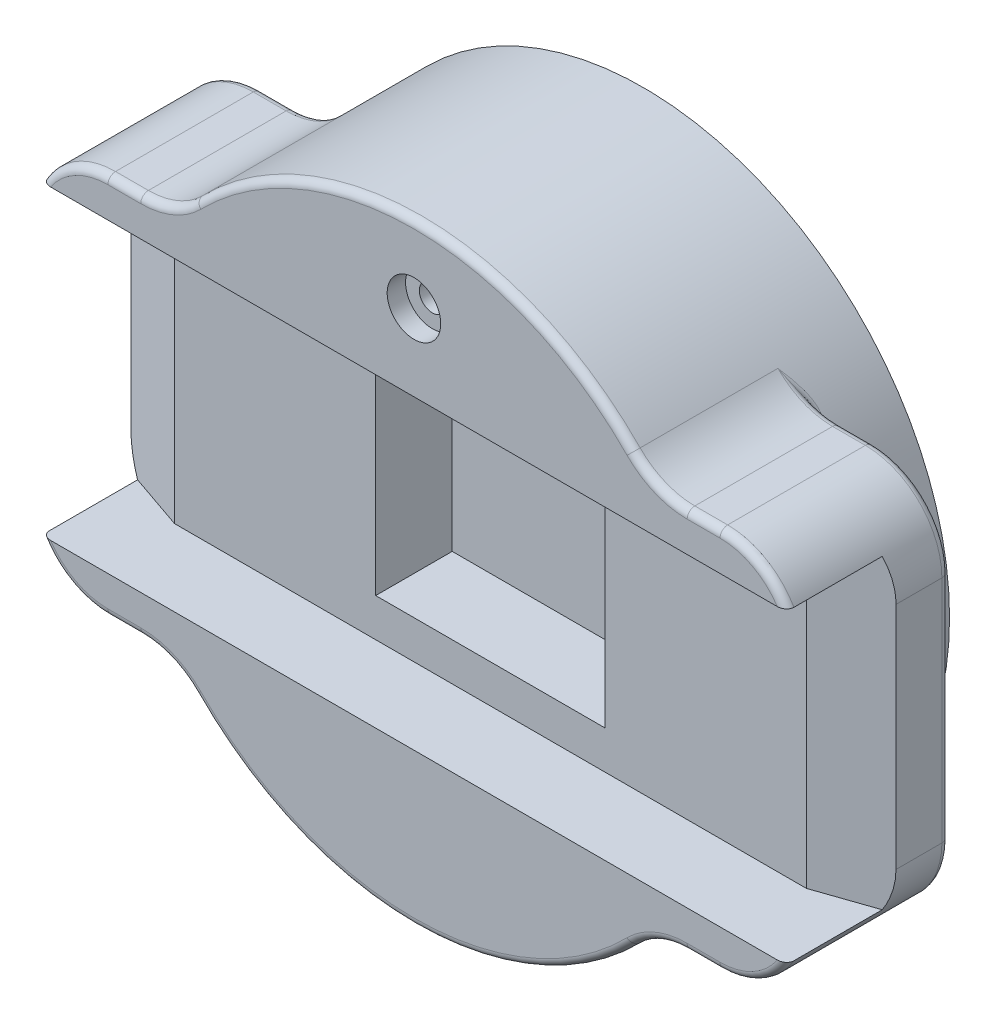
ISO-10303-21;
HEADER;
FILE_DESCRIPTION(('STEP AP214'),'2;1');
FILE_NAME('part.step','',(''),(''),'','','');
FILE_SCHEMA(('AUTOMOTIVE_DESIGN { 1 0 10303 214 1 1 1 1 }'));
ENDSEC;
DATA;
#1=APPLICATION_CONTEXT('core data for automotive mechanical design processes');
#2=APPLICATION_PROTOCOL_DEFINITION('international standard','automotive_design',2000,#1);
#3=PRODUCT_CONTEXT('',#1,'mechanical');
#4=PRODUCT('Part','Part','',(#3));
#5=PRODUCT_RELATED_PRODUCT_CATEGORY('part','',(#4));
#6=PRODUCT_DEFINITION_FORMATION('','',#4);
#7=PRODUCT_DEFINITION_CONTEXT('part definition',#1,'design');
#8=PRODUCT_DEFINITION('design','',#6,#7);
#9=PRODUCT_DEFINITION_SHAPE('','',#8);
#10=(LENGTH_UNIT() NAMED_UNIT(*) SI_UNIT(.MILLI.,.METRE.));
#11=(NAMED_UNIT(*) PLANE_ANGLE_UNIT() SI_UNIT($,.RADIAN.));
#12=(NAMED_UNIT(*) SI_UNIT($,.STERADIAN.) SOLID_ANGLE_UNIT());
#13=UNCERTAINTY_MEASURE_WITH_UNIT(LENGTH_MEASURE(1.E-05),#10,'distance_accuracy_value','');
#14=(GEOMETRIC_REPRESENTATION_CONTEXT(3) GLOBAL_UNCERTAINTY_ASSIGNED_CONTEXT((#13)) GLOBAL_UNIT_ASSIGNED_CONTEXT((#10,
#11,#12)) REPRESENTATION_CONTEXT('',''));
#15=CARTESIAN_POINT('',(0.,0.,0.));
#16=DIRECTION('',(0.,0.,1.));
#17=DIRECTION('',(1.,0.,0.));
#18=AXIS2_PLACEMENT_3D('',#15,#16,#17);
#19=CARTESIAN_POINT('',(0.,0.,20.));
#20=DIRECTION('',(0.,0.,1.));
#21=DIRECTION('',(1.,0.,0.));
#22=AXIS2_PLACEMENT_3D('',#19,#20,#21);
#23=PLANE('',#22);
#24=DIRECTION('',(0.,1.,0.));
#25=VECTOR('',#24,1.);
#26=CARTESIAN_POINT('',(15.,15.,20.));
#27=LINE('',#26,#25);
#28=CARTESIAN_POINT('',(15.,-15.,20.));
#29=VERTEX_POINT('',#28);
#30=CARTESIAN_POINT('',(15.,15.,20.));
#31=VERTEX_POINT('',#30);
#32=EDGE_CURVE('E351',#29,#31,#27,.T.);
#33=ORIENTED_EDGE('',*,*,#32,.F.);
#34=DIRECTION('',(1.,0.,0.));
#35=VECTOR('',#34,1.);
#36=CARTESIAN_POINT('',(-15.,-15.,20.));
#37=LINE('',#36,#35);
#38=CARTESIAN_POINT('',(-15.,-15.,20.));
#39=VERTEX_POINT('',#38);
#40=EDGE_CURVE('E368',#39,#29,#37,.T.);
#41=ORIENTED_EDGE('',*,*,#40,.F.);
#42=DIRECTION('',(0.,-1.,0.));
#43=VECTOR('',#42,1.);
#44=CARTESIAN_POINT('',(-15.,15.,20.));
#45=LINE('',#44,#43);
#46=CARTESIAN_POINT('',(-15.,15.,20.));
#47=VERTEX_POINT('',#46);
#48=EDGE_CURVE('E371',#47,#39,#45,.T.);
#49=ORIENTED_EDGE('',*,*,#48,.F.);
#50=DIRECTION('',(-1.,0.,0.));
#51=VECTOR('',#50,1.);
#52=CARTESIAN_POINT('',(-15.,15.,20.));
#53=LINE('',#52,#51);
#54=EDGE_CURVE('E380',#31,#47,#53,.T.);
#55=ORIENTED_EDGE('',*,*,#54,.F.);
#56=EDGE_LOOP('',(#33,#41,#49,#55));
#57=FACE_BOUND('',#56,.T.);
#58=DIRECTION('',(-1.,0.,0.));
#59=VECTOR('',#58,1.);
#60=CARTESIAN_POINT('',(-50.,-20.,20.));
#61=LINE('',#60,#59);
#62=CARTESIAN_POINT('',(41.2873673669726,-20.,20.));
#63=VERTEX_POINT('',#62);
#64=CARTESIAN_POINT('',(-41.2873673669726,-20.,20.));
#65=VERTEX_POINT('',#64);
#66=EDGE_CURVE('E394',#63,#65,#61,.T.);
#67=ORIENTED_EDGE('',*,*,#66,.F.);
#68=DIRECTION('',(0.,1.,0.));
#69=VECTOR('',#68,1.);
#70=CARTESIAN_POINT('',(41.2873673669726,0.,20.));
#71=LINE('',#70,#69);
#72=CARTESIAN_POINT('',(41.2873673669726,20.,20.));
#73=VERTEX_POINT('',#72);
#74=EDGE_CURVE('E415',#63,#73,#71,.T.);
#75=ORIENTED_EDGE('',*,*,#74,.T.);
#76=DIRECTION('',(1.,0.,0.));
#77=VECTOR('',#76,1.);
#78=CARTESIAN_POINT('',(-50.,20.,20.));
#79=LINE('',#78,#77);
#80=CARTESIAN_POINT('',(-41.2873673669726,20.,20.));
#81=VERTEX_POINT('',#80);
#82=EDGE_CURVE('E393',#81,#73,#79,.T.);
#83=ORIENTED_EDGE('',*,*,#82,.F.);
#84=DIRECTION('',(0.,-1.,0.));
#85=VECTOR('',#84,1.);
#86=CARTESIAN_POINT('',(-41.2873673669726,0.,20.));
#87=LINE('',#86,#85);
#88=EDGE_CURVE('E412',#81,#65,#87,.T.);
#89=ORIENTED_EDGE('',*,*,#88,.T.);
#90=EDGE_LOOP('',(#67,#75,#83,#89));
#91=FACE_BOUND('',#90,.T.);
#92=ADVANCED_FACE('F39',(#57,#91),#23,.T.);
#93=CARTESIAN_POINT('',(0.,0.,0.));
#94=DIRECTION('',(0.,0.,1.));
#95=DIRECTION('',(1.,0.,0.));
#96=AXIS2_PLACEMENT_3D('',#93,#94,#95);
#97=PLANE('',#96);
#98=CARTESIAN_POINT('',(0.,30.,0.));
#99=DIRECTION('',(0.,0.,1.));
#100=DIRECTION('',(1.,0.,0.));
#101=AXIS2_PLACEMENT_3D('',#98,#99,#100);
#102=CIRCLE('',#101,1.7);
#103=CARTESIAN_POINT('',(1.7,30.,0.));
#104=VERTEX_POINT('',#103);
#105=EDGE_CURVE('E374',#104,#104,#102,.T.);
#106=ORIENTED_EDGE('',*,*,#105,.T.);
#107=EDGE_LOOP('',(#106));
#108=FACE_BOUND('',#107,.T.);
#109=CARTESIAN_POINT('',(0.,0.,0.));
#110=DIRECTION('',(0.,0.,1.));
#111=DIRECTION('',(1.,0.,0.));
#112=AXIS2_PLACEMENT_3D('',#109,#110,#111);
#113=CIRCLE('',#112,40.);
#114=CARTESIAN_POINT('',(40.,0.,0.));
#115=VERTEX_POINT('',#114);
#116=EDGE_CURVE('E1062',#115,#115,#113,.T.);
#117=ORIENTED_EDGE('',*,*,#116,.F.);
#118=EDGE_LOOP('',(#117));
#119=FACE_BOUND('',#118,.T.);
#120=DIRECTION('',(0.,1.,0.));
#121=VECTOR('',#120,1.);
#122=CARTESIAN_POINT('',(-15.,15.,0.));
#123=LINE('',#122,#121);
#124=CARTESIAN_POINT('',(-15.,-15.,0.));
#125=VERTEX_POINT('',#124);
#126=CARTESIAN_POINT('',(-15.,15.,0.));
#127=VERTEX_POINT('',#126);
#128=EDGE_CURVE('E401',#125,#127,#123,.T.);
#129=ORIENTED_EDGE('',*,*,#128,.F.);
#130=DIRECTION('',(-1.,0.,0.));
#131=VECTOR('',#130,1.);
#132=CARTESIAN_POINT('',(15.,-15.,0.));
#133=LINE('',#132,#131);
#134=CARTESIAN_POINT('',(15.,-15.,0.));
#135=VERTEX_POINT('',#134);
#136=EDGE_CURVE('E1748',#135,#125,#133,.T.);
#137=ORIENTED_EDGE('',*,*,#136,.F.);
#138=DIRECTION('',(0.,-1.,0.));
#139=VECTOR('',#138,1.);
#140=CARTESIAN_POINT('',(15.,15.,0.));
#141=LINE('',#140,#139);
#142=CARTESIAN_POINT('',(15.,15.,0.));
#143=VERTEX_POINT('',#142);
#144=EDGE_CURVE('E1763',#143,#135,#141,.T.);
#145=ORIENTED_EDGE('',*,*,#144,.F.);
#146=DIRECTION('',(1.,0.,0.));
#147=VECTOR('',#146,1.);
#148=CARTESIAN_POINT('',(15.,15.,0.));
#149=LINE('',#148,#147);
#150=EDGE_CURVE('E1751',#127,#143,#149,.T.);
#151=ORIENTED_EDGE('',*,*,#150,.F.);
#152=EDGE_LOOP('',(#129,#137,#145,#151));
#153=FACE_BOUND('',#152,.T.);
#154=ADVANCED_FACE('F571',(#108,#119,#153),#97,.F.);
#155=CARTESIAN_POINT('',(0.,0.,20.));
#156=DIRECTION('',(0.,0.,-1.));
#157=DIRECTION('',(-1.,0.,0.));
#158=AXIS2_PLACEMENT_3D('',#155,#156,#157);
#159=CYLINDRICAL_SURFACE('',#158,40.);
#160=DIRECTION('',(0.,0.,-1.));
#161=VECTOR('',#160,1.);
#162=CARTESIAN_POINT('',(28.5657137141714,-28.,20.));
#163=LINE('',#162,#161);
#164=CARTESIAN_POINT('',(28.5657137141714,-28.,11.));
#165=VERTEX_POINT('',#164);
#166=CARTESIAN_POINT('',(28.5657137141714,-28.,29.));
#167=VERTEX_POINT('',#166);
#168=EDGE_CURVE('E1058',#165,#167,#163,.F.);
#169=ORIENTED_EDGE('',*,*,#168,.T.);
#170=CARTESIAN_POINT('',(0.,0.,29.));
#171=DIRECTION('',(0.,0.,1.));
#172=DIRECTION('',(1.,0.,0.));
#173=AXIS2_PLACEMENT_3D('',#170,#171,#172);
#174=CIRCLE('',#173,40.);
#175=CARTESIAN_POINT('',(-28.5657137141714,-28.,29.));
#176=VERTEX_POINT('',#175);
#177=EDGE_CURVE('E416',#167,#176,#174,.F.);
#178=ORIENTED_EDGE('',*,*,#177,.T.);
#179=DIRECTION('',(0.,0.,-1.));
#180=VECTOR('',#179,1.);
#181=CARTESIAN_POINT('',(-28.5657137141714,-28.,20.));
#182=LINE('',#181,#180);
#183=CARTESIAN_POINT('',(-28.5657137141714,-28.,11.));
#184=VERTEX_POINT('',#183);
#185=EDGE_CURVE('E1060',#176,#184,#182,.T.);
#186=ORIENTED_EDGE('',*,*,#185,.T.);
#187=CARTESIAN_POINT('',(-33.8616541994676,-23.6847486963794,10.1145636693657));
#188=CARTESIAN_POINT('',(-32.682558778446,-23.0671851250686,10.5341169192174));
#189=CARTESIAN_POINT('',(-32.9627721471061,-22.6595598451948,9.2291273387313));
#190=CARTESIAN_POINT('',(-33.7666928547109,-23.7583801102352,10.0845103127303));
#191=CARTESIAN_POINT('',(-32.6471314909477,-23.1154543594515,10.4520154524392));
#192=CARTESIAN_POINT('',(-32.8749625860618,-22.7873521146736,9.16902062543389));
#193=CARTESIAN_POINT('',(-33.6669481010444,-23.8347723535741,10.0611514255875));
#194=CARTESIAN_POINT('',(-32.6000606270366,-23.180739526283,10.3723012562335));
#195=CARTESIAN_POINT('',(-32.7839432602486,-22.9181138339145,9.12230285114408));
#196=CARTESIAN_POINT('',(-33.4604652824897,-23.9914177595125,10.0261340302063));
#197=CARTESIAN_POINT('',(-32.4889123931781,-23.3347658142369,10.2289027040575));
#198=CARTESIAN_POINT('',(-32.5979934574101,-23.1818032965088,9.0522680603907));
#199=CARTESIAN_POINT('',(-33.3537676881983,-24.0716479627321,10.0144133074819));
#200=CARTESIAN_POINT('',(-32.4257297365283,-23.4222727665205,10.1644261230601));
#201=CARTESIAN_POINT('',(-32.5030866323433,-23.3147156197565,9.02882661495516));
#202=CARTESIAN_POINT('',(-33.1621494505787,-24.2147657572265,10.0024071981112));
#203=CARTESIAN_POINT('',(-32.3033641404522,-23.5902998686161,10.0677610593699));
#204=CARTESIAN_POINT('',(-32.3348217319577,-23.5472857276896,9.004814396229));
#205=CARTESIAN_POINT('',(-33.0784247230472,-24.2769951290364,10.0000005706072));
#206=CARTESIAN_POINT('',(-32.2478400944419,-23.6661535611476,10.0314900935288));
#207=CARTESIAN_POINT('',(-32.2619848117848,-23.6469800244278,9.00000114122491));
#208=CARTESIAN_POINT('',(-32.883798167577,-24.4212158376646,9.99999926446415));
#209=CARTESIAN_POINT('',(-32.1150793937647,-23.8461095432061,9.96082069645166));
#210=CARTESIAN_POINT('',(-32.094192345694,-23.8744223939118,8.99999852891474));
#211=CARTESIAN_POINT('',(-32.7720357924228,-24.5037202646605,10.0039964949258));
#212=CARTESIAN_POINT('',(-32.0356444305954,-23.9528673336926,9.92893471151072));
#213=CARTESIAN_POINT('',(-31.9989287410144,-24.0019502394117,9.00799298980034));
#214=CARTESIAN_POINT('',(-32.5451739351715,-24.6710892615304,10.0187264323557));
#215=CARTESIAN_POINT('',(-31.8702805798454,-24.1725736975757,9.881680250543));
#216=CARTESIAN_POINT('',(-31.8075874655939,-24.2549507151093,9.03745286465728));
#217=CARTESIAN_POINT('',(-32.4300715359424,-24.7559558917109,10.0294652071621));
#218=CARTESIAN_POINT('',(-31.7844046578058,-24.2855345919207,9.86570352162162));
#219=CARTESIAN_POINT('',(-31.7115091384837,-24.3804213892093,9.05893041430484));
#220=CARTESIAN_POINT('',(-32.080260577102,-25.0145923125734,10.0702241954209));
#221=CARTESIAN_POINT('',(-31.5235224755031,-24.6245566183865,9.84039679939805));
#222=CARTESIAN_POINT('',(-31.4221837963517,-24.7536975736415,9.14044839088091));
#223=CARTESIAN_POINT('',(-31.8417323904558,-25.1918986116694,10.108773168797));
#224=CARTESIAN_POINT('',(-31.3370268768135,-24.8619153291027,9.85032947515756));
#225=CARTESIAN_POINT('',(-31.2284338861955,-24.997572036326,9.21754633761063));
#226=CARTESIAN_POINT('',(-31.3262433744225,-25.5822836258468,10.2080735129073));
#227=CARTESIAN_POINT('',(-30.930626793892,-25.3661123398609,9.9198585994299));
#228=CARTESIAN_POINT('',(-30.8143132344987,-25.5068781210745,9.41614702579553));
#229=CARTESIAN_POINT('',(-31.0485925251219,-25.7968877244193,10.2711838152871));
#230=CARTESIAN_POINT('',(-30.706084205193,-25.6376900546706,9.9839748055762));
#231=CARTESIAN_POINT('',(-30.5940280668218,-25.7705224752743,9.54236763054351));
#232=CARTESIAN_POINT('',(-30.4938774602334,-26.2409868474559,10.4103605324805));
#233=CARTESIAN_POINT('',(-30.2533127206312,-26.1701180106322,10.149623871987));
#234=CARTESIAN_POINT('',(-30.1540760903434,-26.2839474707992,9.82072106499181));
#235=CARTESIAN_POINT('',(-30.2168129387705,-26.470464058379,10.4864116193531));
#236=CARTESIAN_POINT('',(-30.0222756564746,-26.4348698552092,10.2507488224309));
#237=CARTESIAN_POINT('',(-29.9344088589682,-26.5337440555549,9.97282323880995));
#238=CARTESIAN_POINT('',(-29.7615264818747,-26.864656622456,10.618961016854));
#239=CARTESIAN_POINT('',(-29.6352313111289,-26.8666084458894,10.43649819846));
#240=CARTESIAN_POINT('',(-29.5685570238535,-26.9397035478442,10.2379220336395));
#241=CARTESIAN_POINT('',(-29.5816541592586,-27.0249374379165,10.6733418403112));
#242=CARTESIAN_POINT('',(-29.4802870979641,-27.0365030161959,10.5149372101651));
#243=CARTESIAN_POINT('',(-29.4227203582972,-27.0988871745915,10.3466836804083));
#244=CARTESIAN_POINT('',(-29.225857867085,-27.3521541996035,10.784064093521));
#245=CARTESIAN_POINT('',(-29.1689907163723,-27.3719684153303,10.6769240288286));
#246=CARTESIAN_POINT('',(-29.1298402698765,-27.4134751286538,10.5681281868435));
#247=CARTESIAN_POINT('',(-29.0499336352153,-27.5190897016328,10.8404053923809));
#248=CARTESIAN_POINT('',(-29.0117041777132,-27.5386042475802,10.7609145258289));
#249=CARTESIAN_POINT('',(-28.9827969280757,-27.5688797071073,10.6808107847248));
#250=CARTESIAN_POINT('',(-28.7760142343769,-27.7876892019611,10.9299998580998));
#251=CARTESIAN_POINT('',(-28.7617003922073,-27.7989640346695,10.8949517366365));
#252=CARTESIAN_POINT('',(-28.748913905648,-27.8121426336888,10.8599997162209));
#253=CARTESIAN_POINT('',(-28.6763142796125,-27.8873279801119,10.9630140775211));
#254=CARTESIAN_POINT('',(-28.6694581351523,-27.8940801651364,10.9445192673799));
#255=CARTESIAN_POINT('',(-28.6627202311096,-27.9009638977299,10.9260281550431));
#256=CARTESIAN_POINT('',(-28.5736174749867,-27.9919396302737,10.9973554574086));
#257=CARTESIAN_POINT('',(-28.5731333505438,-27.9924289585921,10.9960331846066));
#258=CARTESIAN_POINT('',(-28.5726515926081,-27.9929206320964,10.9947109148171));
#259=CARTESIAN_POINT('',(-28.5696648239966,-27.995969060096,10.998677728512));
#260=CARTESIAN_POINT('',(-28.5694239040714,-27.9962148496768,10.9980165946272));
#261=CARTESIAN_POINT('',(-28.5691829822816,-27.9964606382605,10.9973554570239));
#262=CARTESIAN_POINT('',(-28.5657137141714,-28.,11.));
#263=CARTESIAN_POINT('',(-28.5657137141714,-28.,11.));
#264=CARTESIAN_POINT('',(-28.5657137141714,-28.,11.));
#265=(BOUNDED_SURFACE() B_SPLINE_SURFACE(3,2,((#187,#188,#189),(#190,#191,#192),(#193,#194,
#195),(#196,#197,#198),(#199,#200,#201),(#202,#203,#204),(#205,#206,#207),(#208,#209,#210),
(#211,#212,#213),(#214,#215,#216),(#217,#218,#219),(#220,#221,#222),(#223,#224,#225),(#226,#227,
#228),(#229,#230,#231),(#232,#233,#234),(#235,#236,#237),(#238,#239,#240),(#241,#242,#243),
(#244,#245,#246),(#247,#248,#249),(#250,#251,#252),(#253,#254,#255),(#256,#257,#258),(#259,#260,
#261),(#262,#263,#264)),.UNSPECIFIED.,.F.,.F.,.F.) B_SPLINE_SURFACE_WITH_KNOTS((4,2,2,2,2,2,2,2,
2,2,2,2,4),(3,3),(0.,0.508256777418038,1.01378168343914,1.39338223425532,1.88270276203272,
2.37246434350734,3.35499778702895,4.47561703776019,5.59491807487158,6.33456595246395,
7.07416454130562,7.50321236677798,7.52039375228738),(0.,1.),
.UNSPECIFIED.) GEOMETRIC_REPRESENTATION_ITEM() RATIONAL_B_SPLINE_SURFACE(((1.,0.582452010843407,
1.),(1.,0.597606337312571,1.),(1.,0.61294939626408,1.),(1.,0.643515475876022,1.),(1.,
0.658738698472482,1.),(1.,0.685002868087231,1.),(1.,0.696141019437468,1.),(1.,0.721242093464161,
1.),(1.,0.7350909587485,1.),(1.,0.762041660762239,1.),(1.,0.775142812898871,1.),(1.,
0.813202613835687,1.),(1.,0.836828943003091,1.),(1.,0.882784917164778,1.),(1.,0.904465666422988,
1.),(1.,0.941501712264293,1.),(1.,0.95686441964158,1.),(1.,0.976763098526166,1.),(1.,
0.983203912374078,1.),(1.,0.993048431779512,1.),(1.,0.996452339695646,1.),(1.,0.999394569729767,
1.),(1.,0.99995587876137,1.),(1.,0.99999916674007,1.),(1.,1.00000000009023,1.),(1.,1.,1.))) REPRESENTATION_ITEM('') SURFACE());
#266=CARTESIAN_POINT('',(-32.9627721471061,-22.6595598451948,9.2291273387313));
#267=CARTESIAN_POINT('',(-32.8749625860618,-22.7873521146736,9.16902062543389));
#268=CARTESIAN_POINT('',(-32.7839432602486,-22.9181138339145,9.12230285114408));
#269=CARTESIAN_POINT('',(-32.5979934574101,-23.1818032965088,9.0522680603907));
#270=CARTESIAN_POINT('',(-32.5030866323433,-23.3147156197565,9.02882661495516));
#271=CARTESIAN_POINT('',(-32.3348217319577,-23.5472857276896,9.004814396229));
#272=CARTESIAN_POINT('',(-32.2619848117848,-23.6469800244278,9.00000114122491));
#273=CARTESIAN_POINT('',(-32.094192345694,-23.8744223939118,8.99999852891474));
#274=CARTESIAN_POINT('',(-31.9989287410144,-24.0019502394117,9.00799298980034));
#275=CARTESIAN_POINT('',(-31.8075874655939,-24.2549507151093,9.03745286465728));
#276=CARTESIAN_POINT('',(-31.7115091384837,-24.3804213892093,9.05893041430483));
#277=CARTESIAN_POINT('',(-31.4221837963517,-24.7536975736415,9.14044839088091));
#278=CARTESIAN_POINT('',(-31.2284338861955,-24.997572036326,9.21754633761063));
#279=CARTESIAN_POINT('',(-30.8143132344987,-25.5068781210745,9.41614702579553));
#280=CARTESIAN_POINT('',(-30.5940280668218,-25.7705224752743,9.54236763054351));
#281=CARTESIAN_POINT('',(-30.1540760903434,-26.2839474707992,9.82072106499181));
#282=CARTESIAN_POINT('',(-29.9344088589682,-26.5337440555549,9.97282323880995));
#283=CARTESIAN_POINT('',(-29.5685570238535,-26.9397035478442,10.2379220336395));
#284=CARTESIAN_POINT('',(-29.4227203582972,-27.0988871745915,10.3466836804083));
#285=CARTESIAN_POINT('',(-29.1298402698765,-27.4134751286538,10.5681281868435));
#286=CARTESIAN_POINT('',(-28.9827969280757,-27.5688797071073,10.6808107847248));
#287=CARTESIAN_POINT('',(-28.748913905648,-27.8121426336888,10.8599997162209));
#288=CARTESIAN_POINT('',(-28.6627202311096,-27.9009638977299,10.9260281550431));
#289=CARTESIAN_POINT('',(-28.5726515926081,-27.9929206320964,10.9947109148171));
#290=CARTESIAN_POINT('',(-28.5691829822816,-27.9964606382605,10.9973554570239));
#291=CARTESIAN_POINT('',(-28.5657137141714,-28.,11.));
#292=B_SPLINE_CURVE_WITH_KNOTS('',3,(#266,#267,#268,#269,#270,#271,#272,#273,#274,#275,#276,
#277,#278,#279,#280,#281,#282,#283,#284,#285,#286,#287,#288,#289,#290,#291),.UNSPECIFIED.,.F.,
.F.,(4,2,2,2,2,2,2,2,2,2,2,2,4),(0.,0.508256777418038,1.01378168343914,1.39338223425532,
1.88270276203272,2.37246434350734,3.35499778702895,4.47561703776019,5.59491807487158,
6.33456595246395,7.07416454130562,7.50321236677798,7.52039375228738),.UNSPECIFIED.);
#293=CARTESIAN_POINT('',(-32.188682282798,-23.7463414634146,9.));
#294=VERTEX_POINT('',#293);
#295=EDGE_CURVE('E549',#184,#294,#292,.F.);
#296=ORIENTED_EDGE('',*,*,#295,.T.);
#297=CARTESIAN_POINT('',(0.,0.,9.));
#298=DIRECTION('',(0.,0.,1.));
#299=DIRECTION('',(1.,0.,0.));
#300=AXIS2_PLACEMENT_3D('',#297,#298,#299);
#301=CIRCLE('',#300,40.);
#302=CARTESIAN_POINT('',(-32.188682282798,23.7463414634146,9.));
#303=VERTEX_POINT('',#302);
#304=EDGE_CURVE('E503',#294,#303,#301,.F.);
#305=ORIENTED_EDGE('',*,*,#304,.T.);
#306=CARTESIAN_POINT('',(-32.9627721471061,22.6595598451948,9.2291273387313));
#307=CARTESIAN_POINT('',(-32.682558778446,23.0671851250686,10.5341169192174));
#308=CARTESIAN_POINT('',(-33.8616541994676,23.6847486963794,10.1145636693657));
#309=CARTESIAN_POINT('',(-32.8749625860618,22.7873521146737,9.16902062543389));
#310=CARTESIAN_POINT('',(-32.6471314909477,23.1154543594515,10.4520154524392));
#311=CARTESIAN_POINT('',(-33.7666928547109,23.7583801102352,10.0845103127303));
#312=CARTESIAN_POINT('',(-32.7839432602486,22.9181138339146,9.12230285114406));
#313=CARTESIAN_POINT('',(-32.6000606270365,23.180739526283,10.3723012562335));
#314=CARTESIAN_POINT('',(-33.6669481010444,23.8347723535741,10.0611514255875));
#315=CARTESIAN_POINT('',(-32.5979934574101,23.1818032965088,9.05226806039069));
#316=CARTESIAN_POINT('',(-32.488912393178,23.3347658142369,10.2289027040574));
#317=CARTESIAN_POINT('',(-33.4604652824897,23.9914177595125,10.0261340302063));
#318=CARTESIAN_POINT('',(-32.5030866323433,23.3147156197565,9.02882661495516));
#319=CARTESIAN_POINT('',(-32.4257297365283,23.4222727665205,10.1644261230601));
#320=CARTESIAN_POINT('',(-33.3537676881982,24.0716479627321,10.0144133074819));
#321=CARTESIAN_POINT('',(-32.3348217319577,23.5472857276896,9.004814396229));
#322=CARTESIAN_POINT('',(-32.3033641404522,23.5902998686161,10.0677610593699));
#323=CARTESIAN_POINT('',(-33.1621494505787,24.2147657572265,10.0024071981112));
#324=CARTESIAN_POINT('',(-32.2619848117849,23.6469800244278,9.00000114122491));
#325=CARTESIAN_POINT('',(-32.2478400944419,23.6661535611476,10.0314900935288));
#326=CARTESIAN_POINT('',(-33.0784247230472,24.2769951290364,10.0000005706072));
#327=CARTESIAN_POINT('',(-32.094192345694,23.8744223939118,8.99999852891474));
#328=CARTESIAN_POINT('',(-32.1150793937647,23.8461095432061,9.96082069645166));
#329=CARTESIAN_POINT('',(-32.883798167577,24.4212158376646,9.99999926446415));
#330=CARTESIAN_POINT('',(-31.9989287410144,24.0019502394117,9.00799298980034));
#331=CARTESIAN_POINT('',(-32.0356444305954,23.9528673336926,9.92893471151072));
#332=CARTESIAN_POINT('',(-32.7720357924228,24.5037202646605,10.0039964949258));
#333=CARTESIAN_POINT('',(-31.8075874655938,24.2549507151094,9.0374528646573));
#334=CARTESIAN_POINT('',(-31.8702805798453,24.1725736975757,9.88168025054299));
#335=CARTESIAN_POINT('',(-32.5451739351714,24.6710892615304,10.0187264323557));
#336=CARTESIAN_POINT('',(-31.7115091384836,24.3804213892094,9.05893041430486));
#337=CARTESIAN_POINT('',(-31.7844046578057,24.2855345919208,9.86570352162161));
#338=CARTESIAN_POINT('',(-32.4300715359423,24.755955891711,10.0294652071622));
#339=CARTESIAN_POINT('',(-31.4221837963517,24.7536975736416,9.14044839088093));
#340=CARTESIAN_POINT('',(-31.523522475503,24.6245566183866,9.84039679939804));
#341=CARTESIAN_POINT('',(-32.0802605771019,25.0145923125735,10.070224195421));
#342=CARTESIAN_POINT('',(-31.2284338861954,24.9975720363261,9.21754633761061));
#343=CARTESIAN_POINT('',(-31.3370268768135,24.8619153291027,9.85032947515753));
#344=CARTESIAN_POINT('',(-31.8417323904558,25.1918986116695,10.108773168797));
#345=CARTESIAN_POINT('',(-30.8143132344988,25.5068781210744,9.41614702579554));
#346=CARTESIAN_POINT('',(-30.9306267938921,25.3661123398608,9.91985859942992));
#347=CARTESIAN_POINT('',(-31.3262433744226,25.5822836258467,10.2080735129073));
#348=CARTESIAN_POINT('',(-30.594028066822,25.7705224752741,9.54236763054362));
#349=CARTESIAN_POINT('',(-30.7060842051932,25.6376900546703,9.98397480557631));
#350=CARTESIAN_POINT('',(-31.0485925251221,25.7968877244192,10.2711838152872));
#351=CARTESIAN_POINT('',(-30.1540760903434,26.2839474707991,9.82072106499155));
#352=CARTESIAN_POINT('',(-30.2533127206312,26.1701180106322,10.1496238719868));
#353=CARTESIAN_POINT('',(-30.4938774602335,26.2409868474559,10.4103605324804));
#354=CARTESIAN_POINT('',(-29.9344088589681,26.533744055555,9.97282323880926));
#355=CARTESIAN_POINT('',(-30.0222756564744,26.4348698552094,10.2507488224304));
#356=CARTESIAN_POINT('',(-30.2168129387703,26.4704640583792,10.4864116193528));
#357=CARTESIAN_POINT('',(-29.5685570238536,26.939703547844,10.2379220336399));
#358=CARTESIAN_POINT('',(-29.635231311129,26.8666084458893,10.4364981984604));
#359=CARTESIAN_POINT('',(-29.7615264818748,26.8646566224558,10.6189610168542));
#360=CARTESIAN_POINT('',(-29.4227203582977,27.098887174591,10.3466836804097));
#361=CARTESIAN_POINT('',(-29.4802870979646,27.0365030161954,10.5149372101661));
#362=CARTESIAN_POINT('',(-29.5816541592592,27.0249374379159,10.6733418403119));
#363=CARTESIAN_POINT('',(-29.129840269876,27.4134751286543,10.5681281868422));
#364=CARTESIAN_POINT('',(-29.1689907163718,27.3719684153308,10.6769240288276));
#365=CARTESIAN_POINT('',(-29.2258578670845,27.3521541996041,10.7840640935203));
#366=CARTESIAN_POINT('',(-28.9827969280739,27.5688797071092,10.6808107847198));
#367=CARTESIAN_POINT('',(-29.0117041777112,27.5386042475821,10.7609145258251));
#368=CARTESIAN_POINT('',(-29.0499336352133,27.5190897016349,10.8404053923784));
#369=CARTESIAN_POINT('',(-28.7489139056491,27.8121426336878,10.8599997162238));
#370=CARTESIAN_POINT('',(-28.7617003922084,27.7989640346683,10.8949517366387));
#371=CARTESIAN_POINT('',(-28.776014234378,27.7876892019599,10.9299998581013));
#372=CARTESIAN_POINT('',(-28.6627202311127,27.9009638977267,10.9260281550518));
#373=CARTESIAN_POINT('',(-28.6694581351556,27.8940801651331,10.9445192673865));
#374=CARTESIAN_POINT('',(-28.676314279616,27.8873279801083,10.9630140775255));
#375=CARTESIAN_POINT('',(-28.5726515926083,27.9929206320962,10.9947109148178));
#376=CARTESIAN_POINT('',(-28.5731333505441,27.9924289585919,10.9960331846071));
#377=CARTESIAN_POINT('',(-28.573617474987,27.9919396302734,10.9973554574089));
#378=CARTESIAN_POINT('',(-28.5691829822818,27.9964606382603,10.9973554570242));
#379=CARTESIAN_POINT('',(-28.5694239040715,27.9962148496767,10.9980165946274));
#380=CARTESIAN_POINT('',(-28.5696648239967,27.9959690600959,10.9986777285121));
#381=CARTESIAN_POINT('',(-28.5657137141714,28.,11.));
#382=CARTESIAN_POINT('',(-28.5657137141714,28.,11.));
#383=CARTESIAN_POINT('',(-28.5657137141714,28.,11.));
#384=(BOUNDED_SURFACE() B_SPLINE_SURFACE(3,2,((#306,#307,#308),(#309,#310,#311),(#312,#313,
#314),(#315,#316,#317),(#318,#319,#320),(#321,#322,#323),(#324,#325,#326),(#327,#328,#329),
(#330,#331,#332),(#333,#334,#335),(#336,#337,#338),(#339,#340,#341),(#342,#343,#344),(#345,#346,
#347),(#348,#349,#350),(#351,#352,#353),(#354,#355,#356),(#357,#358,#359),(#360,#361,#362),
(#363,#364,#365),(#366,#367,#368),(#369,#370,#371),(#372,#373,#374),(#375,#376,#377),(#378,#379,
#380),(#381,#382,#383)),.UNSPECIFIED.,.F.,.F.,.F.) B_SPLINE_SURFACE_WITH_KNOTS((4,2,2,2,2,2,2,2,
2,2,2,2,4),(3,3),(0.,0.508256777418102,1.01378168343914,1.39338223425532,1.8827027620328,
2.37246434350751,3.35499778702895,4.47561703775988,5.59491807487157,6.33456595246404,
7.0741645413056,7.50321236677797,7.52039375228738),(0.,1.),
.UNSPECIFIED.) GEOMETRIC_REPRESENTATION_ITEM() RATIONAL_B_SPLINE_SURFACE(((1.,0.582452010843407,
1.),(1.,0.59760633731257,1.),(1.,0.612949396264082,1.),(1.,0.643515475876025,1.),(1.,
0.658738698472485,1.),(1.,0.685002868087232,1.),(1.,0.696141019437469,1.),(1.,0.721242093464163,
1.),(1.,0.735090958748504,1.),(1.,0.762041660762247,1.),(1.,0.775142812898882,1.),(1.,
0.813202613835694,1.),(1.,0.836828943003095,1.),(1.,0.882784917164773,1.),(1.,0.904465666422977,
1.),(1.,0.941501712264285,1.),(1.,0.956864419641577,1.),(1.,0.976763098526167,1.),(1.,
0.98320391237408,1.),(1.,0.993048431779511,1.),(1.,0.996452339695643,1.),(1.,0.999394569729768,
1.),(1.,0.999955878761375,1.),(1.,0.99999916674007,1.),(1.,1.00000000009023,1.),(1.,1.,1.))) REPRESENTATION_ITEM('') SURFACE());
#385=CARTESIAN_POINT('',(-32.9627721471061,22.6595598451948,9.2291273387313));
#386=CARTESIAN_POINT('',(-32.8749625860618,22.7873521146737,9.16902062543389));
#387=CARTESIAN_POINT('',(-32.7839432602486,22.9181138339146,9.12230285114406));
#388=CARTESIAN_POINT('',(-32.5979934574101,23.1818032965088,9.05226806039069));
#389=CARTESIAN_POINT('',(-32.5030866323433,23.3147156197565,9.02882661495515));
#390=CARTESIAN_POINT('',(-32.3348217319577,23.5472857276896,9.004814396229));
#391=CARTESIAN_POINT('',(-32.2619848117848,23.6469800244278,9.00000114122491));
#392=CARTESIAN_POINT('',(-32.094192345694,23.8744223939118,8.99999852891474));
#393=CARTESIAN_POINT('',(-31.9989287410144,24.0019502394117,9.00799298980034));
#394=CARTESIAN_POINT('',(-31.8075874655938,24.2549507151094,9.0374528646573));
#395=CARTESIAN_POINT('',(-31.7115091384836,24.3804213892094,9.05893041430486));
#396=CARTESIAN_POINT('',(-31.4221837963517,24.7536975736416,9.14044839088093));
#397=CARTESIAN_POINT('',(-31.2284338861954,24.9975720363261,9.21754633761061));
#398=CARTESIAN_POINT('',(-30.8143132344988,25.5068781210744,9.41614702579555));
#399=CARTESIAN_POINT('',(-30.594028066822,25.7705224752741,9.54236763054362));
#400=CARTESIAN_POINT('',(-30.1540760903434,26.2839474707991,9.82072106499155));
#401=CARTESIAN_POINT('',(-29.9344088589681,26.533744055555,9.97282323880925));
#402=CARTESIAN_POINT('',(-29.5685570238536,26.939703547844,10.2379220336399));
#403=CARTESIAN_POINT('',(-29.4227203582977,27.098887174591,10.3466836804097));
#404=CARTESIAN_POINT('',(-29.129840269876,27.4134751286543,10.5681281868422));
#405=CARTESIAN_POINT('',(-28.9827969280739,27.5688797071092,10.6808107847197));
#406=CARTESIAN_POINT('',(-28.7489139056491,27.8121426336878,10.8599997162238));
#407=CARTESIAN_POINT('',(-28.6627202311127,27.9009638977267,10.9260281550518));
#408=CARTESIAN_POINT('',(-28.5726515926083,27.9929206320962,10.9947109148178));
#409=CARTESIAN_POINT('',(-28.5691829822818,27.9964606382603,10.9973554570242));
#410=CARTESIAN_POINT('',(-28.5657137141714,28.,11.));
#411=B_SPLINE_CURVE_WITH_KNOTS('',3,(#385,#386,#387,#388,#389,#390,#391,#392,#393,#394,#395,
#396,#397,#398,#399,#400,#401,#402,#403,#404,#405,#406,#407,#408,#409,#410),.UNSPECIFIED.,.F.,
.F.,(4,2,2,2,2,2,2,2,2,2,2,2,4),(0.,0.508256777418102,1.01378168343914,1.39338223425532,
1.8827027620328,2.37246434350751,3.35499778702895,4.47561703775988,5.59491807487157,
6.33456595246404,7.0741645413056,7.50321236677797,7.52039375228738),.UNSPECIFIED.);
#412=CARTESIAN_POINT('',(-28.5657137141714,28.,11.));
#413=VERTEX_POINT('',#412);
#414=EDGE_CURVE('E556',#303,#413,#411,.T.);
#415=ORIENTED_EDGE('',*,*,#414,.T.);
#416=DIRECTION('',(0.,0.,-1.));
#417=VECTOR('',#416,1.);
#418=CARTESIAN_POINT('',(-28.5657137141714,28.,20.));
#419=LINE('',#418,#417);
#420=CARTESIAN_POINT('',(-28.5657137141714,28.,29.));
#421=VERTEX_POINT('',#420);
#422=EDGE_CURVE('E1052',#413,#421,#419,.F.);
#423=ORIENTED_EDGE('',*,*,#422,.T.);
#424=CARTESIAN_POINT('',(0.,0.,29.));
#425=DIRECTION('',(0.,0.,1.));
#426=DIRECTION('',(1.,0.,0.));
#427=AXIS2_PLACEMENT_3D('',#424,#425,#426);
#428=CIRCLE('',#427,40.);
#429=CARTESIAN_POINT('',(28.5657137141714,28.,29.));
#430=VERTEX_POINT('',#429);
#431=EDGE_CURVE('E990',#421,#430,#428,.F.);
#432=ORIENTED_EDGE('',*,*,#431,.T.);
#433=DIRECTION('',(0.,0.,-1.));
#434=VECTOR('',#433,1.);
#435=CARTESIAN_POINT('',(28.5657137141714,28.,20.));
#436=LINE('',#435,#434);
#437=CARTESIAN_POINT('',(28.5657137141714,28.,11.));
#438=VERTEX_POINT('',#437);
#439=EDGE_CURVE('E1051',#430,#438,#436,.T.);
#440=ORIENTED_EDGE('',*,*,#439,.T.);
#441=CARTESIAN_POINT('',(33.8616541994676,23.6847486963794,10.1145636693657));
#442=CARTESIAN_POINT('',(32.682558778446,23.0671851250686,10.5341169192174));
#443=CARTESIAN_POINT('',(32.9627721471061,22.6595598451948,9.2291273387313));
#444=CARTESIAN_POINT('',(33.7666928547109,23.7583801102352,10.0845103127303));
#445=CARTESIAN_POINT('',(32.6471314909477,23.1154543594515,10.4520154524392));
#446=CARTESIAN_POINT('',(32.8749625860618,22.7873521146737,9.16902062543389));
#447=CARTESIAN_POINT('',(33.6669481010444,23.8347723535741,10.0611514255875));
#448=CARTESIAN_POINT('',(32.6000606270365,23.180739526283,10.3723012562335));
#449=CARTESIAN_POINT('',(32.7839432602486,22.9181138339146,9.12230285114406));
#450=CARTESIAN_POINT('',(33.4604652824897,23.9914177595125,10.0261340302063));
#451=CARTESIAN_POINT('',(32.488912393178,23.3347658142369,10.2289027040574));
#452=CARTESIAN_POINT('',(32.5979934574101,23.1818032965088,9.05226806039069));
#453=CARTESIAN_POINT('',(33.3537676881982,24.0716479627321,10.0144133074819));
#454=CARTESIAN_POINT('',(32.4257297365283,23.4222727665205,10.1644261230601));
#455=CARTESIAN_POINT('',(32.5030866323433,23.3147156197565,9.02882661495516));
#456=CARTESIAN_POINT('',(33.1621494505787,24.2147657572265,10.0024071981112));
#457=CARTESIAN_POINT('',(32.3033641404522,23.5902998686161,10.0677610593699));
#458=CARTESIAN_POINT('',(32.3348217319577,23.5472857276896,9.004814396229));
#459=CARTESIAN_POINT('',(33.0784247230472,24.2769951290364,10.0000005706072));
#460=CARTESIAN_POINT('',(32.2478400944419,23.6661535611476,10.0314900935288));
#461=CARTESIAN_POINT('',(32.2619848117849,23.6469800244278,9.00000114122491));
#462=CARTESIAN_POINT('',(32.883798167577,24.4212158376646,9.99999926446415));
#463=CARTESIAN_POINT('',(32.1150793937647,23.8461095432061,9.96082069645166));
#464=CARTESIAN_POINT('',(32.094192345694,23.8744223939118,8.99999852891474));
#465=CARTESIAN_POINT('',(32.7720357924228,24.5037202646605,10.0039964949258));
#466=CARTESIAN_POINT('',(32.0356444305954,23.9528673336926,9.92893471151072));
#467=CARTESIAN_POINT('',(31.9989287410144,24.0019502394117,9.00799298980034));
#468=CARTESIAN_POINT('',(32.5451739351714,24.6710892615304,10.0187264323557));
#469=CARTESIAN_POINT('',(31.8702805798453,24.1725736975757,9.88168025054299));
#470=CARTESIAN_POINT('',(31.8075874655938,24.2549507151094,9.0374528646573));
#471=CARTESIAN_POINT('',(32.4300715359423,24.755955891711,10.0294652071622));
#472=CARTESIAN_POINT('',(31.7844046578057,24.2855345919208,9.86570352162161));
#473=CARTESIAN_POINT('',(31.7115091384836,24.3804213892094,9.05893041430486));
#474=CARTESIAN_POINT('',(32.0802605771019,25.0145923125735,10.070224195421));
#475=CARTESIAN_POINT('',(31.523522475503,24.6245566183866,9.84039679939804));
#476=CARTESIAN_POINT('',(31.4221837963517,24.7536975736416,9.14044839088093));
#477=CARTESIAN_POINT('',(31.8417323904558,25.1918986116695,10.108773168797));
#478=CARTESIAN_POINT('',(31.3370268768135,24.8619153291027,9.85032947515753));
#479=CARTESIAN_POINT('',(31.2284338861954,24.9975720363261,9.21754633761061));
#480=CARTESIAN_POINT('',(31.3262433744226,25.5822836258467,10.2080735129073));
#481=CARTESIAN_POINT('',(30.9306267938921,25.3661123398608,9.91985859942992));
#482=CARTESIAN_POINT('',(30.8143132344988,25.5068781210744,9.41614702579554));
#483=CARTESIAN_POINT('',(31.0485925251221,25.7968877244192,10.2711838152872));
#484=CARTESIAN_POINT('',(30.7060842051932,25.6376900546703,9.98397480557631));
#485=CARTESIAN_POINT('',(30.594028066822,25.7705224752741,9.54236763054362));
#486=CARTESIAN_POINT('',(30.4938774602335,26.2409868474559,10.4103605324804));
#487=CARTESIAN_POINT('',(30.2533127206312,26.1701180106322,10.1496238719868));
#488=CARTESIAN_POINT('',(30.1540760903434,26.2839474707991,9.82072106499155));
#489=CARTESIAN_POINT('',(30.2168129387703,26.4704640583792,10.4864116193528));
#490=CARTESIAN_POINT('',(30.0222756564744,26.4348698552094,10.2507488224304));
#491=CARTESIAN_POINT('',(29.9344088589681,26.533744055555,9.97282323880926));
#492=CARTESIAN_POINT('',(29.7615264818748,26.8646566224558,10.6189610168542));
#493=CARTESIAN_POINT('',(29.635231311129,26.8666084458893,10.4364981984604));
#494=CARTESIAN_POINT('',(29.5685570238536,26.939703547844,10.2379220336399));
#495=CARTESIAN_POINT('',(29.5816541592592,27.0249374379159,10.6733418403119));
#496=CARTESIAN_POINT('',(29.4802870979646,27.0365030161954,10.5149372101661));
#497=CARTESIAN_POINT('',(29.4227203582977,27.098887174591,10.3466836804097));
#498=CARTESIAN_POINT('',(29.2258578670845,27.3521541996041,10.7840640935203));
#499=CARTESIAN_POINT('',(29.1689907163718,27.3719684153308,10.6769240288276));
#500=CARTESIAN_POINT('',(29.129840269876,27.4134751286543,10.5681281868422));
#501=CARTESIAN_POINT('',(29.0499336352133,27.5190897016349,10.8404053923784));
#502=CARTESIAN_POINT('',(29.0117041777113,27.5386042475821,10.7609145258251));
#503=CARTESIAN_POINT('',(28.9827969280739,27.5688797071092,10.6808107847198));
#504=CARTESIAN_POINT('',(28.776014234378,27.7876892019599,10.9299998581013));
#505=CARTESIAN_POINT('',(28.7617003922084,27.7989640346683,10.8949517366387));
#506=CARTESIAN_POINT('',(28.7489139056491,27.8121426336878,10.8599997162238));
#507=CARTESIAN_POINT('',(28.676314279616,27.8873279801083,10.9630140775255));
#508=CARTESIAN_POINT('',(28.6694581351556,27.8940801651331,10.9445192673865));
#509=CARTESIAN_POINT('',(28.6627202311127,27.9009638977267,10.9260281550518));
#510=CARTESIAN_POINT('',(28.573617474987,27.9919396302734,10.9973554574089));
#511=CARTESIAN_POINT('',(28.5731333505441,27.9924289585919,10.9960331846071));
#512=CARTESIAN_POINT('',(28.5726515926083,27.9929206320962,10.9947109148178));
#513=CARTESIAN_POINT('',(28.5696648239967,27.9959690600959,10.9986777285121));
#514=CARTESIAN_POINT('',(28.5694239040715,27.9962148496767,10.9980165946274));
#515=CARTESIAN_POINT('',(28.5691829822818,27.9964606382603,10.9973554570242));
#516=CARTESIAN_POINT('',(28.5657137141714,28.,11.));
#517=CARTESIAN_POINT('',(28.5657137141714,28.,11.));
#518=CARTESIAN_POINT('',(28.5657137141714,28.,11.));
#519=(BOUNDED_SURFACE() B_SPLINE_SURFACE(3,2,((#441,#442,#443),(#444,#445,#446),(#447,#448,
#449),(#450,#451,#452),(#453,#454,#455),(#456,#457,#458),(#459,#460,#461),(#462,#463,#464),
(#465,#466,#467),(#468,#469,#470),(#471,#472,#473),(#474,#475,#476),(#477,#478,#479),(#480,#481,
#482),(#483,#484,#485),(#486,#487,#488),(#489,#490,#491),(#492,#493,#494),(#495,#496,#497),
(#498,#499,#500),(#501,#502,#503),(#504,#505,#506),(#507,#508,#509),(#510,#511,#512),(#513,#514,
#515),(#516,#517,#518)),.UNSPECIFIED.,.F.,.F.,.F.) B_SPLINE_SURFACE_WITH_KNOTS((4,2,2,2,2,2,2,2,
2,2,2,2,4),(3,3),(0.,0.508256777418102,1.01378168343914,1.39338223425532,1.8827027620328,
2.37246434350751,3.35499778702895,4.47561703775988,5.59491807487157,6.33456595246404,
7.0741645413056,7.50321236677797,7.52039375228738),(0.,1.),
.UNSPECIFIED.) GEOMETRIC_REPRESENTATION_ITEM() RATIONAL_B_SPLINE_SURFACE(((1.,0.582452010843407,
1.),(1.,0.59760633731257,1.),(1.,0.612949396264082,1.),(1.,0.643515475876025,1.),(1.,
0.658738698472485,1.),(1.,0.685002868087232,1.),(1.,0.696141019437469,1.),(1.,0.721242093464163,
1.),(1.,0.735090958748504,1.),(1.,0.762041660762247,1.),(1.,0.775142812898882,1.),(1.,
0.813202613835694,1.),(1.,0.836828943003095,1.),(1.,0.882784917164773,1.),(1.,0.904465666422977,
1.),(1.,0.941501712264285,1.),(1.,0.956864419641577,1.),(1.,0.976763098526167,1.),(1.,
0.98320391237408,1.),(1.,0.993048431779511,1.),(1.,0.996452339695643,1.),(1.,0.999394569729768,
1.),(1.,0.999955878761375,1.),(1.,0.99999916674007,1.),(1.,1.00000000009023,1.),(1.,1.,1.))) REPRESENTATION_ITEM('') SURFACE());
#520=CARTESIAN_POINT('',(32.9627721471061,22.6595598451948,9.2291273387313));
#521=CARTESIAN_POINT('',(32.8749625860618,22.7873521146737,9.16902062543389));
#522=CARTESIAN_POINT('',(32.7839432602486,22.9181138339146,9.12230285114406));
#523=CARTESIAN_POINT('',(32.5979934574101,23.1818032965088,9.05226806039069));
#524=CARTESIAN_POINT('',(32.5030866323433,23.3147156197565,9.02882661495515));
#525=CARTESIAN_POINT('',(32.3348217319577,23.5472857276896,9.004814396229));
#526=CARTESIAN_POINT('',(32.2619848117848,23.6469800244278,9.00000114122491));
#527=CARTESIAN_POINT('',(32.094192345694,23.8744223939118,8.99999852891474));
#528=CARTESIAN_POINT('',(31.9989287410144,24.0019502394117,9.00799298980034));
#529=CARTESIAN_POINT('',(31.8075874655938,24.2549507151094,9.0374528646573));
#530=CARTESIAN_POINT('',(31.7115091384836,24.3804213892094,9.05893041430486));
#531=CARTESIAN_POINT('',(31.4221837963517,24.7536975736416,9.14044839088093));
#532=CARTESIAN_POINT('',(31.2284338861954,24.9975720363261,9.21754633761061));
#533=CARTESIAN_POINT('',(30.8143132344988,25.5068781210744,9.41614702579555));
#534=CARTESIAN_POINT('',(30.594028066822,25.7705224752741,9.54236763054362));
#535=CARTESIAN_POINT('',(30.1540760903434,26.2839474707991,9.82072106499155));
#536=CARTESIAN_POINT('',(29.9344088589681,26.533744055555,9.97282323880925));
#537=CARTESIAN_POINT('',(29.5685570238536,26.939703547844,10.2379220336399));
#538=CARTESIAN_POINT('',(29.4227203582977,27.098887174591,10.3466836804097));
#539=CARTESIAN_POINT('',(29.129840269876,27.4134751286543,10.5681281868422));
#540=CARTESIAN_POINT('',(28.9827969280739,27.5688797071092,10.6808107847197));
#541=CARTESIAN_POINT('',(28.7489139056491,27.8121426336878,10.8599997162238));
#542=CARTESIAN_POINT('',(28.6627202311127,27.9009638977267,10.9260281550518));
#543=CARTESIAN_POINT('',(28.5726515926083,27.9929206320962,10.9947109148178));
#544=CARTESIAN_POINT('',(28.5691829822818,27.9964606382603,10.9973554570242));
#545=CARTESIAN_POINT('',(28.5657137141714,28.,11.));
#546=B_SPLINE_CURVE_WITH_KNOTS('',3,(#520,#521,#522,#523,#524,#525,#526,#527,#528,#529,#530,
#531,#532,#533,#534,#535,#536,#537,#538,#539,#540,#541,#542,#543,#544,#545),.UNSPECIFIED.,.F.,
.F.,(4,2,2,2,2,2,2,2,2,2,2,2,4),(0.,0.508256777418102,1.01378168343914,1.39338223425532,
1.8827027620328,2.37246434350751,3.35499778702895,4.47561703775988,5.59491807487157,
6.33456595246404,7.0741645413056,7.50321236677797,7.52039375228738),.UNSPECIFIED.);
#547=CARTESIAN_POINT('',(32.188682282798,23.7463414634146,9.));
#548=VERTEX_POINT('',#547);
#549=EDGE_CURVE('E609',#438,#548,#546,.F.);
#550=ORIENTED_EDGE('',*,*,#549,.T.);
#551=CARTESIAN_POINT('',(0.,0.,9.));
#552=DIRECTION('',(0.,0.,1.));
#553=DIRECTION('',(1.,0.,0.));
#554=AXIS2_PLACEMENT_3D('',#551,#552,#553);
#555=CIRCLE('',#554,40.);
#556=CARTESIAN_POINT('',(32.188682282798,-23.7463414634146,9.));
#557=VERTEX_POINT('',#556);
#558=EDGE_CURVE('E501',#548,#557,#555,.F.);
#559=ORIENTED_EDGE('',*,*,#558,.T.);
#560=CARTESIAN_POINT('',(32.9627721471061,-22.6595598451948,9.2291273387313));
#561=CARTESIAN_POINT('',(32.682558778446,-23.0671851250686,10.5341169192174));
#562=CARTESIAN_POINT('',(33.8616541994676,-23.6847486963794,10.1145636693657));
#563=CARTESIAN_POINT('',(32.8749625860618,-22.7873521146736,9.16902062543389));
#564=CARTESIAN_POINT('',(32.6471314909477,-23.1154543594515,10.4520154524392));
#565=CARTESIAN_POINT('',(33.7666928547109,-23.7583801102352,10.0845103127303));
#566=CARTESIAN_POINT('',(32.7839432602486,-22.9181138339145,9.12230285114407));
#567=CARTESIAN_POINT('',(32.6000606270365,-23.180739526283,10.3723012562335));
#568=CARTESIAN_POINT('',(33.6669481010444,-23.8347723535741,10.0611514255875));
#569=CARTESIAN_POINT('',(32.5979934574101,-23.1818032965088,9.05226806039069));
#570=CARTESIAN_POINT('',(32.4889123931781,-23.3347658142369,10.2289027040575));
#571=CARTESIAN_POINT('',(33.4604652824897,-23.9914177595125,10.0261340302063));
#572=CARTESIAN_POINT('',(32.5030866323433,-23.3147156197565,9.02882661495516));
#573=CARTESIAN_POINT('',(32.4257297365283,-23.4222727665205,10.1644261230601));
#574=CARTESIAN_POINT('',(33.3537676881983,-24.0716479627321,10.0144133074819));
#575=CARTESIAN_POINT('',(32.3348217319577,-23.5472857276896,9.004814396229));
#576=CARTESIAN_POINT('',(32.3033641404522,-23.5902998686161,10.0677610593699));
#577=CARTESIAN_POINT('',(33.1621494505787,-24.2147657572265,10.0024071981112));
#578=CARTESIAN_POINT('',(32.2619848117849,-23.6469800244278,9.00000114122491));
#579=CARTESIAN_POINT('',(32.2478400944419,-23.6661535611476,10.0314900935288));
#580=CARTESIAN_POINT('',(33.0784247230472,-24.2769951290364,10.0000005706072));
#581=CARTESIAN_POINT('',(32.0941923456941,-23.8744223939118,8.99999852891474));
#582=CARTESIAN_POINT('',(32.1150793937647,-23.8461095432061,9.96082069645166));
#583=CARTESIAN_POINT('',(32.883798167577,-24.4212158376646,9.99999926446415));
#584=CARTESIAN_POINT('',(31.9989287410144,-24.0019502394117,9.00799298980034));
#585=CARTESIAN_POINT('',(32.0356444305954,-23.9528673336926,9.92893471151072));
#586=CARTESIAN_POINT('',(32.7720357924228,-24.5037202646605,10.0039964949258));
#587=CARTESIAN_POINT('',(31.8075874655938,-24.2549507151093,9.03745286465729));
#588=CARTESIAN_POINT('',(31.8702805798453,-24.1725736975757,9.881680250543));
#589=CARTESIAN_POINT('',(32.5451739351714,-24.6710892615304,10.0187264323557));
#590=CARTESIAN_POINT('',(31.7115091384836,-24.3804213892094,9.05893041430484));
#591=CARTESIAN_POINT('',(31.7844046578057,-24.2855345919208,9.86570352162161));
#592=CARTESIAN_POINT('',(32.4300715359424,-24.755955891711,10.0294652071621));
#593=CARTESIAN_POINT('',(31.4221837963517,-24.7536975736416,9.14044839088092));
#594=CARTESIAN_POINT('',(31.5235224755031,-24.6245566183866,9.84039679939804));
#595=CARTESIAN_POINT('',(32.0802605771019,-25.0145923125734,10.0702241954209));
#596=CARTESIAN_POINT('',(31.2284338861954,-24.997572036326,9.21754633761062));
#597=CARTESIAN_POINT('',(31.3370268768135,-24.8619153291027,9.85032947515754));
#598=CARTESIAN_POINT('',(31.8417323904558,-25.1918986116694,10.108773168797));
#599=CARTESIAN_POINT('',(30.8143132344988,-25.5068781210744,9.41614702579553));
#600=CARTESIAN_POINT('',(30.9306267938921,-25.3661123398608,9.9198585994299));
#601=CARTESIAN_POINT('',(31.3262433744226,-25.5822836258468,10.2080735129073));
#602=CARTESIAN_POINT('',(30.5940280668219,-25.7705224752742,9.54236763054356));
#603=CARTESIAN_POINT('',(30.7060842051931,-25.6376900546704,9.98397480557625));
#604=CARTESIAN_POINT('',(31.048592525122,-25.7968877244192,10.2711838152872));
#605=CARTESIAN_POINT('',(30.1540760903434,-26.2839474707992,9.82072106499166));
#606=CARTESIAN_POINT('',(30.2533127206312,-26.1701180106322,10.1496238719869));
#607=CARTESIAN_POINT('',(30.4938774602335,-26.2409868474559,10.4103605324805));
#608=CARTESIAN_POINT('',(29.9344088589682,-26.5337440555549,9.97282323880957));
#609=CARTESIAN_POINT('',(30.0222756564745,-26.4348698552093,10.2507488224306));
#610=CARTESIAN_POINT('',(30.2168129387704,-26.470464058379,10.4864116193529));
#611=CARTESIAN_POINT('',(29.5685570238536,-26.9397035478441,10.2379220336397));
#612=CARTESIAN_POINT('',(29.635231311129,-26.8666084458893,10.4364981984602));
#613=CARTESIAN_POINT('',(29.7615264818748,-26.8646566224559,10.6189610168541));
#614=CARTESIAN_POINT('',(29.4227203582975,-27.0988871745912,10.346683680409));
#615=CARTESIAN_POINT('',(29.4802870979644,-27.0365030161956,10.5149372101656));
#616=CARTESIAN_POINT('',(29.5816541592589,-27.0249374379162,10.6733418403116));
#617=CARTESIAN_POINT('',(29.1298402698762,-27.4134751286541,10.5681281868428));
#618=CARTESIAN_POINT('',(29.168990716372,-27.3719684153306,10.6769240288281));
#619=CARTESIAN_POINT('',(29.2258578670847,-27.3521541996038,10.7840640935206));
#620=CARTESIAN_POINT('',(28.9827969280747,-27.5688797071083,10.680810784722));
#621=CARTESIAN_POINT('',(29.0117041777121,-27.5386042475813,10.7609145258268));
#622=CARTESIAN_POINT('',(29.0499336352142,-27.5190897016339,10.8404053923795));
#623=CARTESIAN_POINT('',(28.7489139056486,-27.8121426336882,10.8599997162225));
#624=CARTESIAN_POINT('',(28.7617003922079,-27.7989640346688,10.8949517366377));
#625=CARTESIAN_POINT('',(28.7760142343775,-27.7876892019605,10.9299998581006));
#626=CARTESIAN_POINT('',(28.6627202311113,-27.9009638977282,10.9260281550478));
#627=CARTESIAN_POINT('',(28.6694581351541,-27.8940801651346,10.9445192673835));
#628=CARTESIAN_POINT('',(28.6763142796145,-27.8873279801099,10.9630140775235));
#629=CARTESIAN_POINT('',(28.5726515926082,-27.9929206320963,10.9947109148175));
#630=CARTESIAN_POINT('',(28.573133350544,-27.992428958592,10.9960331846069));
#631=CARTESIAN_POINT('',(28.5736174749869,-27.9919396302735,10.9973554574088));
#632=CARTESIAN_POINT('',(28.5691829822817,-27.9964606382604,10.9973554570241));
#633=CARTESIAN_POINT('',(28.5694239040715,-27.9962148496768,10.9980165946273));
#634=CARTESIAN_POINT('',(28.5696648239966,-27.995969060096,10.9986777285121));
#635=CARTESIAN_POINT('',(28.5657137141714,-28.,11.));
#636=CARTESIAN_POINT('',(28.5657137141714,-28.,11.));
#637=CARTESIAN_POINT('',(28.5657137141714,-28.,11.));
#638=(BOUNDED_SURFACE() B_SPLINE_SURFACE(3,2,((#560,#561,#562),(#563,#564,#565),(#566,#567,
#568),(#569,#570,#571),(#572,#573,#574),(#575,#576,#577),(#578,#579,#580),(#581,#582,#583),
(#584,#585,#586),(#587,#588,#589),(#590,#591,#592),(#593,#594,#595),(#596,#597,#598),(#599,#600,
#601),(#602,#603,#604),(#605,#606,#607),(#608,#609,#610),(#611,#612,#613),(#614,#615,#616),
(#617,#618,#619),(#620,#621,#622),(#623,#624,#625),(#626,#627,#628),(#629,#630,#631),(#632,#633,
#634),(#635,#636,#637)),.UNSPECIFIED.,.F.,.F.,.F.) B_SPLINE_SURFACE_WITH_KNOTS((4,2,2,2,2,2,2,2,
2,2,2,2,4),(3,3),(0.,0.508256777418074,1.01378168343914,1.39338223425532,1.88270276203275,
2.37246434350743,3.35499778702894,4.47561703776,5.59491807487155,6.33456595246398,
7.0741645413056,7.50321236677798,7.52039375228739),(0.,1.),
.UNSPECIFIED.) GEOMETRIC_REPRESENTATION_ITEM() RATIONAL_B_SPLINE_SURFACE(((1.,0.582452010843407,
1.),(1.,0.597606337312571,1.),(1.,0.612949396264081,1.),(1.,0.643515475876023,1.),(1.,
0.658738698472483,1.),(1.,0.685002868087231,1.),(1.,0.696141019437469,1.),(1.,0.721242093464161,
1.),(1.,0.7350909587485,1.),(1.,0.762041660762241,1.),(1.,0.775142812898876,1.),(1.,
0.813202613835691,1.),(1.,0.836828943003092,1.),(1.,0.882784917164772,1.),(1.,0.90446566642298,
1.),(1.,0.941501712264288,1.),(1.,0.956864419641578,1.),(1.,0.976763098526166,1.),(1.,
0.983203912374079,1.),(1.,0.993048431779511,1.),(1.,0.996452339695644,1.),(1.,0.999394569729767,
1.),(1.,0.999955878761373,1.),(1.,0.99999916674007,1.),(1.,1.00000000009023,1.),(1.,1.,1.))) REPRESENTATION_ITEM('') SURFACE());
#639=CARTESIAN_POINT('',(32.9627721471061,-22.6595598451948,9.2291273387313));
#640=CARTESIAN_POINT('',(32.8749625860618,-22.7873521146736,9.16902062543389));
#641=CARTESIAN_POINT('',(32.7839432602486,-22.9181138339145,9.12230285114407));
#642=CARTESIAN_POINT('',(32.5979934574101,-23.1818032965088,9.0522680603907));
#643=CARTESIAN_POINT('',(32.5030866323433,-23.3147156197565,9.02882661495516));
#644=CARTESIAN_POINT('',(32.3348217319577,-23.5472857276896,9.004814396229));
#645=CARTESIAN_POINT('',(32.2619848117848,-23.6469800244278,9.00000114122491));
#646=CARTESIAN_POINT('',(32.094192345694,-23.8744223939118,8.99999852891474));
#647=CARTESIAN_POINT('',(31.9989287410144,-24.0019502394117,9.00799298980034));
#648=CARTESIAN_POINT('',(31.8075874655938,-24.2549507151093,9.03745286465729));
#649=CARTESIAN_POINT('',(31.7115091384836,-24.3804213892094,9.05893041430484));
#650=CARTESIAN_POINT('',(31.4221837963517,-24.7536975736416,9.14044839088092));
#651=CARTESIAN_POINT('',(31.2284338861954,-24.997572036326,9.21754633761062));
#652=CARTESIAN_POINT('',(30.8143132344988,-25.5068781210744,9.41614702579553));
#653=CARTESIAN_POINT('',(30.5940280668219,-25.7705224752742,9.54236763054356));
#654=CARTESIAN_POINT('',(30.1540760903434,-26.2839474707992,9.82072106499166));
#655=CARTESIAN_POINT('',(29.9344088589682,-26.5337440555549,9.97282323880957));
#656=CARTESIAN_POINT('',(29.5685570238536,-26.9397035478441,10.2379220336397));
#657=CARTESIAN_POINT('',(29.4227203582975,-27.0988871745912,10.346683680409));
#658=CARTESIAN_POINT('',(29.1298402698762,-27.4134751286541,10.5681281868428));
#659=CARTESIAN_POINT('',(28.9827969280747,-27.5688797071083,10.680810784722));
#660=CARTESIAN_POINT('',(28.7489139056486,-27.8121426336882,10.8599997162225));
#661=CARTESIAN_POINT('',(28.6627202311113,-27.9009638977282,10.9260281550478));
#662=CARTESIAN_POINT('',(28.5726515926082,-27.9929206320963,10.9947109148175));
#663=CARTESIAN_POINT('',(28.5691829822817,-27.9964606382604,10.9973554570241));
#664=CARTESIAN_POINT('',(28.5657137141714,-28.,11.));
#665=B_SPLINE_CURVE_WITH_KNOTS('',3,(#639,#640,#641,#642,#643,#644,#645,#646,#647,#648,#649,
#650,#651,#652,#653,#654,#655,#656,#657,#658,#659,#660,#661,#662,#663,#664),.UNSPECIFIED.,.F.,
.F.,(4,2,2,2,2,2,2,2,2,2,2,2,4),(0.,0.508256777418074,1.01378168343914,1.39338223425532,
1.88270276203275,2.37246434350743,3.35499778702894,4.47561703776,5.59491807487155,
6.33456595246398,7.0741645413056,7.50321236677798,7.52039375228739),.UNSPECIFIED.);
#666=EDGE_CURVE('E614',#557,#165,#665,.T.);
#667=ORIENTED_EDGE('',*,*,#666,.T.);
#668=EDGE_LOOP('',(#169,#178,#186,#296,#305,#415,#423,#432,#440,#550,#559,#667));
#669=FACE_BOUND('',#668,.T.);
#670=ORIENTED_EDGE('',*,*,#116,.T.);
#671=EDGE_LOOP('',(#670));
#672=FACE_BOUND('',#671,.T.);
#673=ADVANCED_FACE('F565',(#669,#672),#159,.T.);
#674=CARTESIAN_POINT('',(-15.,15.,-10.));
#675=DIRECTION('',(1.,0.,0.));
#676=DIRECTION('',(0.,1.,0.));
#677=AXIS2_PLACEMENT_3D('',#674,#675,#676);
#678=PLANE('',#677);
#679=ORIENTED_EDGE('',*,*,#128,.T.);
#680=DIRECTION('',(0.,0.,1.));
#681=VECTOR('',#680,1.);
#682=CARTESIAN_POINT('',(-15.,15.,-10.));
#683=LINE('',#682,#681);
#684=CARTESIAN_POINT('',(-15.,15.,-10.));
#685=VERTEX_POINT('',#684);
#686=EDGE_CURVE('E1776',#685,#127,#683,.T.);
#687=ORIENTED_EDGE('',*,*,#686,.F.);
#688=DIRECTION('',(0.,1.,0.));
#689=VECTOR('',#688,1.);
#690=CARTESIAN_POINT('',(-15.,15.,-10.));
#691=LINE('',#690,#689);
#692=CARTESIAN_POINT('',(-15.,-15.,-10.));
#693=VERTEX_POINT('',#692);
#694=EDGE_CURVE('E404',#693,#685,#691,.T.);
#695=ORIENTED_EDGE('',*,*,#694,.F.);
#696=DIRECTION('',(0.,0.,1.));
#697=VECTOR('',#696,1.);
#698=CARTESIAN_POINT('',(-15.,-15.,-10.));
#699=LINE('',#698,#697);
#700=EDGE_CURVE('E1759',#693,#125,#699,.T.);
#701=ORIENTED_EDGE('',*,*,#700,.T.);
#702=EDGE_LOOP('',(#679,#687,#695,#701));
#703=FACE_BOUND('',#702,.T.);
#704=ADVANCED_FACE('F570',(#703),#678,.F.);
#705=CARTESIAN_POINT('',(15.,15.,-10.));
#706=DIRECTION('',(0.,-1.,0.));
#707=DIRECTION('',(0.,0.,-1.));
#708=AXIS2_PLACEMENT_3D('',#705,#706,#707);
#709=PLANE('',#708);
#710=ORIENTED_EDGE('',*,*,#150,.T.);
#711=DIRECTION('',(0.,0.,1.));
#712=VECTOR('',#711,1.);
#713=CARTESIAN_POINT('',(15.,15.,-10.));
#714=LINE('',#713,#712);
#715=CARTESIAN_POINT('',(15.,15.,-10.));
#716=VERTEX_POINT('',#715);
#717=EDGE_CURVE('E1768',#716,#143,#714,.T.);
#718=ORIENTED_EDGE('',*,*,#717,.F.);
#719=DIRECTION('',(1.,0.,0.));
#720=VECTOR('',#719,1.);
#721=CARTESIAN_POINT('',(15.,15.,-10.));
#722=LINE('',#721,#720);
#723=EDGE_CURVE('E1778',#685,#716,#722,.T.);
#724=ORIENTED_EDGE('',*,*,#723,.F.);
#725=ORIENTED_EDGE('',*,*,#686,.T.);
#726=EDGE_LOOP('',(#710,#718,#724,#725));
#727=FACE_BOUND('',#726,.T.);
#728=ADVANCED_FACE('F877',(#727),#709,.F.);
#729=CARTESIAN_POINT('',(15.,15.,-10.));
#730=DIRECTION('',(-1.,0.,0.));
#731=DIRECTION('',(0.,-1.,0.));
#732=AXIS2_PLACEMENT_3D('',#729,#730,#731);
#733=PLANE('',#732);
#734=ORIENTED_EDGE('',*,*,#144,.T.);
#735=DIRECTION('',(0.,0.,1.));
#736=VECTOR('',#735,1.);
#737=CARTESIAN_POINT('',(15.,-15.,-10.));
#738=LINE('',#737,#736);
#739=CARTESIAN_POINT('',(15.,-15.,-10.));
#740=VERTEX_POINT('',#739);
#741=EDGE_CURVE('E1762',#740,#135,#738,.T.);
#742=ORIENTED_EDGE('',*,*,#741,.F.);
#743=DIRECTION('',(0.,-1.,0.));
#744=VECTOR('',#743,1.);
#745=CARTESIAN_POINT('',(15.,15.,-10.));
#746=LINE('',#745,#744);
#747=EDGE_CURVE('E1770',#716,#740,#746,.T.);
#748=ORIENTED_EDGE('',*,*,#747,.F.);
#749=ORIENTED_EDGE('',*,*,#717,.T.);
#750=EDGE_LOOP('',(#734,#742,#748,#749));
#751=FACE_BOUND('',#750,.T.);
#752=ADVANCED_FACE('F881',(#751),#733,.F.);
#753=CARTESIAN_POINT('',(15.,-15.,-10.));
#754=DIRECTION('',(0.,1.,0.));
#755=DIRECTION('',(0.,0.,1.));
#756=AXIS2_PLACEMENT_3D('',#753,#754,#755);
#757=PLANE('',#756);
#758=ORIENTED_EDGE('',*,*,#136,.T.);
#759=ORIENTED_EDGE('',*,*,#700,.F.);
#760=DIRECTION('',(-1.,0.,0.));
#761=VECTOR('',#760,1.);
#762=CARTESIAN_POINT('',(15.,-15.,-10.));
#763=LINE('',#762,#761);
#764=EDGE_CURVE('E1766',#740,#693,#763,.T.);
#765=ORIENTED_EDGE('',*,*,#764,.F.);
#766=ORIENTED_EDGE('',*,*,#741,.T.);
#767=EDGE_LOOP('',(#758,#759,#765,#766));
#768=FACE_BOUND('',#767,.T.);
#769=ADVANCED_FACE('F885',(#768),#757,.F.);
#770=CARTESIAN_POINT('',(0.,0.,-10.));
#771=DIRECTION('',(0.,0.,-1.));
#772=DIRECTION('',(-1.,0.,0.));
#773=AXIS2_PLACEMENT_3D('',#770,#771,#772);
#774=PLANE('',#773);
#775=ORIENTED_EDGE('',*,*,#694,.T.);
#776=ORIENTED_EDGE('',*,*,#723,.T.);
#777=ORIENTED_EDGE('',*,*,#747,.T.);
#778=ORIENTED_EDGE('',*,*,#764,.T.);
#779=EDGE_LOOP('',(#775,#776,#777,#778));
#780=FACE_BOUND('',#779,.T.);
#781=ADVANCED_FACE('F889',(#780),#774,.T.);
#782=CARTESIAN_POINT('',(50.,25.,10.));
#783=DIRECTION('',(1.,0.,0.));
#784=DIRECTION('',(0.,1.,0.));
#785=AXIS2_PLACEMENT_3D('',#782,#783,#784);
#786=PLANE('',#785);
#787=DIRECTION('',(0.,0.,1.));
#788=VECTOR('',#787,1.);
#789=CARTESIAN_POINT('',(50.,15.,10.));
#790=LINE('',#789,#788);
#791=CARTESIAN_POINT('',(50.,15.,11.));
#792=VERTEX_POINT('',#791);
#793=CARTESIAN_POINT('',(50.,15.,17.));
#794=VERTEX_POINT('',#793);
#795=EDGE_CURVE('E470',#792,#794,#790,.T.);
#796=ORIENTED_EDGE('',*,*,#795,.T.);
#797=DIRECTION('',(0.,-1.,0.));
#798=VECTOR('',#797,1.);
#799=CARTESIAN_POINT('',(50.,25.,17.));
#800=LINE('',#799,#798);
#801=CARTESIAN_POINT('',(50.,-15.,17.));
#802=VERTEX_POINT('',#801);
#803=EDGE_CURVE('E421',#794,#802,#800,.T.);
#804=ORIENTED_EDGE('',*,*,#803,.T.);
#805=DIRECTION('',(0.,0.,1.));
#806=VECTOR('',#805,1.);
#807=CARTESIAN_POINT('',(50.,-15.,10.));
#808=LINE('',#807,#806);
#809=CARTESIAN_POINT('',(50.,-15.,11.));
#810=VERTEX_POINT('',#809);
#811=EDGE_CURVE('E473',#802,#810,#808,.F.);
#812=ORIENTED_EDGE('',*,*,#811,.T.);
#813=DIRECTION('',(0.,1.,0.));
#814=VECTOR('',#813,1.);
#815=CARTESIAN_POINT('',(50.,15.,11.));
#816=LINE('',#815,#814);
#817=EDGE_CURVE('E547',#810,#792,#816,.T.);
#818=ORIENTED_EDGE('',*,*,#817,.T.);
#819=EDGE_LOOP('',(#796,#804,#812,#818));
#820=FACE_BOUND('',#819,.T.);
#821=ADVANCED_FACE('F893',(#820),#786,.T.);
#822=CARTESIAN_POINT('',(0.,0.,10.));
#823=DIRECTION('',(0.,0.,1.));
#824=DIRECTION('',(1.,0.,0.));
#825=AXIS2_PLACEMENT_3D('',#822,#823,#824);
#826=PLANE('',#825);
#827=DIRECTION('',(-1.,0.,0.));
#828=VECTOR('',#827,1.);
#829=CARTESIAN_POINT('',(40.,24.,10.));
#830=LINE('',#829,#828);
#831=CARTESIAN_POINT('',(35.7071421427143,24.,10.));
#832=VERTEX_POINT('',#831);
#833=CARTESIAN_POINT('',(40.,24.,10.));
#834=VERTEX_POINT('',#833);
#835=EDGE_CURVE('E526',#832,#834,#830,.F.);
#836=ORIENTED_EDGE('',*,*,#835,.T.);
#837=CARTESIAN_POINT('',(40.,15.,10.));
#838=DIRECTION('',(0.,0.,1.));
#839=DIRECTION('',(1.,0.,0.));
#840=AXIS2_PLACEMENT_3D('',#837,#838,#839);
#841=CIRCLE('',#840,9.);
#842=CARTESIAN_POINT('',(49.,15.,10.));
#843=VERTEX_POINT('',#842);
#844=EDGE_CURVE('E528',#834,#843,#841,.F.);
#845=ORIENTED_EDGE('',*,*,#844,.T.);
#846=DIRECTION('',(0.,1.,0.));
#847=VECTOR('',#846,1.);
#848=CARTESIAN_POINT('',(49.,-15.,10.));
#849=LINE('',#848,#847);
#850=CARTESIAN_POINT('',(49.,-15.,10.));
#851=VERTEX_POINT('',#850);
#852=EDGE_CURVE('E514',#843,#851,#849,.F.);
#853=ORIENTED_EDGE('',*,*,#852,.T.);
#854=CARTESIAN_POINT('',(40.,-15.,10.));
#855=DIRECTION('',(0.,0.,1.));
#856=DIRECTION('',(1.,0.,0.));
#857=AXIS2_PLACEMENT_3D('',#854,#855,#856);
#858=CIRCLE('',#857,9.);
#859=CARTESIAN_POINT('',(40.,-24.,10.));
#860=VERTEX_POINT('',#859);
#861=EDGE_CURVE('E516',#851,#860,#858,.F.);
#862=ORIENTED_EDGE('',*,*,#861,.T.);
#863=DIRECTION('',(1.,0.,0.));
#864=VECTOR('',#863,1.);
#865=CARTESIAN_POINT('',(35.7071421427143,-24.,10.));
#866=LINE('',#865,#864);
#867=CARTESIAN_POINT('',(35.7071421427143,-24.,10.));
#868=VERTEX_POINT('',#867);
#869=EDGE_CURVE('E518',#860,#868,#866,.F.);
#870=ORIENTED_EDGE('',*,*,#869,.T.);
#871=CARTESIAN_POINT('',(35.7071421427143,-35.,10.));
#872=DIRECTION('',(0.,0.,1.));
#873=DIRECTION('',(1.,0.,0.));
#874=AXIS2_PLACEMENT_3D('',#871,#872,#873);
#875=CIRCLE('',#874,11.);
#876=CARTESIAN_POINT('',(32.993399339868,-24.34,10.));
#877=VERTEX_POINT('',#876);
#878=EDGE_CURVE('E520',#868,#877,#875,.T.);
#879=ORIENTED_EDGE('',*,*,#878,.T.);
#880=CARTESIAN_POINT('',(0.,0.,10.));
#881=DIRECTION('',(0.,0.,1.));
#882=DIRECTION('',(1.,0.,0.));
#883=AXIS2_PLACEMENT_3D('',#880,#881,#882);
#884=CIRCLE('',#883,41.);
#885=CARTESIAN_POINT('',(32.993399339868,24.34,10.));
#886=VERTEX_POINT('',#885);
#887=EDGE_CURVE('E522',#877,#886,#884,.T.);
#888=ORIENTED_EDGE('',*,*,#887,.T.);
#889=CARTESIAN_POINT('',(35.7071421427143,35.,10.));
#890=DIRECTION('',(0.,0.,1.));
#891=DIRECTION('',(1.,0.,0.));
#892=AXIS2_PLACEMENT_3D('',#889,#890,#891);
#893=CIRCLE('',#892,11.);
#894=EDGE_CURVE('E524',#886,#832,#893,.T.);
#895=ORIENTED_EDGE('',*,*,#894,.T.);
#896=EDGE_LOOP('',(#836,#845,#853,#862,#870,#879,#888,#895));
#897=FACE_BOUND('',#896,.T.);
#898=ADVANCED_FACE('F807',(#897),#826,.F.);
#899=CARTESIAN_POINT('',(-50.,25.,10.));
#900=DIRECTION('',(0.,1.,0.));
#901=DIRECTION('',(0.,0.,1.));
#902=AXIS2_PLACEMENT_3D('',#899,#900,#901);
#903=PLANE('',#902);
#904=DIRECTION('',(0.,0.,-1.));
#905=VECTOR('',#904,1.);
#906=CARTESIAN_POINT('',(35.7071421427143,25.,10.));
#907=LINE('',#906,#905);
#908=CARTESIAN_POINT('',(35.7071421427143,25.,11.));
#909=VERTEX_POINT('',#908);
#910=CARTESIAN_POINT('',(35.7071421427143,25.,29.));
#911=VERTEX_POINT('',#910);
#912=EDGE_CURVE('E1029',#909,#911,#907,.F.);
#913=ORIENTED_EDGE('',*,*,#912,.T.);
#914=DIRECTION('',(-1.,0.,0.));
#915=VECTOR('',#914,1.);
#916=CARTESIAN_POINT('',(-50.,25.,29.));
#917=LINE('',#916,#915);
#918=CARTESIAN_POINT('',(40.,25.,29.));
#919=VERTEX_POINT('',#918);
#920=EDGE_CURVE('E824',#911,#919,#917,.F.);
#921=ORIENTED_EDGE('',*,*,#920,.T.);
#922=DIRECTION('',(0.,0.,1.));
#923=VECTOR('',#922,1.);
#924=CARTESIAN_POINT('',(40.,25.,10.));
#925=LINE('',#924,#923);
#926=CARTESIAN_POINT('',(40.,25.,11.));
#927=VERTEX_POINT('',#926);
#928=EDGE_CURVE('E475',#919,#927,#925,.F.);
#929=ORIENTED_EDGE('',*,*,#928,.T.);
#930=DIRECTION('',(-1.,0.,0.));
#931=VECTOR('',#930,1.);
#932=CARTESIAN_POINT('',(35.7071421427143,25.,11.));
#933=LINE('',#932,#931);
#934=EDGE_CURVE('E534',#927,#909,#933,.T.);
#935=ORIENTED_EDGE('',*,*,#934,.T.);
#936=EDGE_LOOP('',(#913,#921,#929,#935));
#937=FACE_BOUND('',#936,.T.);
#938=ADVANCED_FACE('F898',(#937),#903,.T.);
#939=CARTESIAN_POINT('',(-50.,-25.,10.));
#940=DIRECTION('',(0.,-1.,0.));
#941=DIRECTION('',(0.,0.,-1.));
#942=AXIS2_PLACEMENT_3D('',#939,#940,#941);
#943=PLANE('',#942);
#944=DIRECTION('',(0.,0.,1.));
#945=VECTOR('',#944,1.);
#946=CARTESIAN_POINT('',(40.,-25.,10.));
#947=LINE('',#946,#945);
#948=CARTESIAN_POINT('',(40.,-25.,11.));
#949=VERTEX_POINT('',#948);
#950=CARTESIAN_POINT('',(40.,-25.,29.));
#951=VERTEX_POINT('',#950);
#952=EDGE_CURVE('E467',#949,#951,#947,.T.);
#953=ORIENTED_EDGE('',*,*,#952,.T.);
#954=DIRECTION('',(1.,0.,0.));
#955=VECTOR('',#954,1.);
#956=CARTESIAN_POINT('',(-50.,-25.,29.));
#957=LINE('',#956,#955);
#958=CARTESIAN_POINT('',(35.7071421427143,-25.,29.));
#959=VERTEX_POINT('',#958);
#960=EDGE_CURVE('E923',#951,#959,#957,.F.);
#961=ORIENTED_EDGE('',*,*,#960,.T.);
#962=DIRECTION('',(0.,0.,-1.));
#963=VECTOR('',#962,1.);
#964=CARTESIAN_POINT('',(35.7071421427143,-25.,10.));
#965=LINE('',#964,#963);
#966=CARTESIAN_POINT('',(35.7071421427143,-25.,11.));
#967=VERTEX_POINT('',#966);
#968=EDGE_CURVE('E1033',#959,#967,#965,.T.);
#969=ORIENTED_EDGE('',*,*,#968,.T.);
#970=DIRECTION('',(1.,0.,0.));
#971=VECTOR('',#970,1.);
#972=CARTESIAN_POINT('',(40.,-25.,11.));
#973=LINE('',#972,#971);
#974=EDGE_CURVE('E542',#967,#949,#973,.T.);
#975=ORIENTED_EDGE('',*,*,#974,.T.);
#976=EDGE_LOOP('',(#953,#961,#969,#975));
#977=FACE_BOUND('',#976,.T.);
#978=ADVANCED_FACE('F901',(#977),#943,.T.);
#979=DIRECTION('',(1.,0.,0.));
#980=VECTOR('',#979,1.);
#981=CARTESIAN_POINT('',(-40.,-24.,10.));
#982=LINE('',#981,#980);
#983=CARTESIAN_POINT('',(-35.7071421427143,-24.,10.));
#984=VERTEX_POINT('',#983);
#985=CARTESIAN_POINT('',(-40.,-24.,10.));
#986=VERTEX_POINT('',#985);
#987=EDGE_CURVE('E489',#984,#986,#982,.F.);
#988=ORIENTED_EDGE('',*,*,#987,.T.);
#989=CARTESIAN_POINT('',(-40.,-15.,10.));
#990=DIRECTION('',(0.,0.,1.));
#991=DIRECTION('',(1.,0.,0.));
#992=AXIS2_PLACEMENT_3D('',#989,#990,#991);
#993=CIRCLE('',#992,9.);
#994=CARTESIAN_POINT('',(-49.,-15.,10.));
#995=VERTEX_POINT('',#994);
#996=EDGE_CURVE('E491',#986,#995,#993,.F.);
#997=ORIENTED_EDGE('',*,*,#996,.T.);
#998=DIRECTION('',(0.,-1.,0.));
#999=VECTOR('',#998,1.);
#1000=CARTESIAN_POINT('',(-49.,15.,10.));
#1001=LINE('',#1000,#999);
#1002=CARTESIAN_POINT('',(-49.,15.,10.));
#1003=VERTEX_POINT('',#1002);
#1004=EDGE_CURVE('E477',#995,#1003,#1001,.F.);
#1005=ORIENTED_EDGE('',*,*,#1004,.T.);
#1006=CARTESIAN_POINT('',(-40.,15.,10.));
#1007=DIRECTION('',(0.,0.,1.));
#1008=DIRECTION('',(1.,0.,0.));
#1009=AXIS2_PLACEMENT_3D('',#1006,#1007,#1008);
#1010=CIRCLE('',#1009,9.);
#1011=CARTESIAN_POINT('',(-40.,24.,10.));
#1012=VERTEX_POINT('',#1011);
#1013=EDGE_CURVE('E479',#1003,#1012,#1010,.F.);
#1014=ORIENTED_EDGE('',*,*,#1013,.T.);
#1015=DIRECTION('',(-1.,0.,0.));
#1016=VECTOR('',#1015,1.);
#1017=CARTESIAN_POINT('',(-35.7071421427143,24.,10.));
#1018=LINE('',#1017,#1016);
#1019=CARTESIAN_POINT('',(-35.7071421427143,24.,10.));
#1020=VERTEX_POINT('',#1019);
#1021=EDGE_CURVE('E481',#1012,#1020,#1018,.F.);
#1022=ORIENTED_EDGE('',*,*,#1021,.T.);
#1023=CARTESIAN_POINT('',(-35.7071421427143,35.,10.));
#1024=DIRECTION('',(0.,0.,1.));
#1025=DIRECTION('',(1.,0.,0.));
#1026=AXIS2_PLACEMENT_3D('',#1023,#1024,#1025);
#1027=CIRCLE('',#1026,11.);
#1028=CARTESIAN_POINT('',(-32.993399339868,24.34,10.));
#1029=VERTEX_POINT('',#1028);
#1030=EDGE_CURVE('E483',#1020,#1029,#1027,.T.);
#1031=ORIENTED_EDGE('',*,*,#1030,.T.);
#1032=CARTESIAN_POINT('',(0.,0.,10.));
#1033=DIRECTION('',(0.,0.,1.));
#1034=DIRECTION('',(1.,0.,0.));
#1035=AXIS2_PLACEMENT_3D('',#1032,#1033,#1034);
#1036=CIRCLE('',#1035,41.);
#1037=CARTESIAN_POINT('',(-32.993399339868,-24.34,10.));
#1038=VERTEX_POINT('',#1037);
#1039=EDGE_CURVE('E485',#1029,#1038,#1036,.T.);
#1040=ORIENTED_EDGE('',*,*,#1039,.T.);
#1041=CARTESIAN_POINT('',(-35.7071421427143,-35.,10.));
#1042=DIRECTION('',(0.,0.,1.));
#1043=DIRECTION('',(1.,0.,0.));
#1044=AXIS2_PLACEMENT_3D('',#1041,#1042,#1043);
#1045=CIRCLE('',#1044,11.);
#1046=EDGE_CURVE('E487',#1038,#984,#1045,.T.);
#1047=ORIENTED_EDGE('',*,*,#1046,.T.);
#1048=EDGE_LOOP('',(#988,#997,#1005,#1014,#1022,#1031,#1040,#1047));
#1049=FACE_BOUND('',#1048,.T.);
#1050=ADVANCED_FACE('F907',(#1049),#826,.F.);
#1051=DIRECTION('',(0.,0.,-1.));
#1052=VECTOR('',#1051,1.);
#1053=CARTESIAN_POINT('',(-35.7071421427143,-25.,10.));
#1054=LINE('',#1053,#1052);
#1055=CARTESIAN_POINT('',(-35.7071421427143,-25.,11.));
#1056=VERTEX_POINT('',#1055);
#1057=CARTESIAN_POINT('',(-35.7071421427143,-25.,29.));
#1058=VERTEX_POINT('',#1057);
#1059=EDGE_CURVE('E1067',#1056,#1058,#1054,.F.);
#1060=ORIENTED_EDGE('',*,*,#1059,.T.);
#1061=DIRECTION('',(1.,0.,0.));
#1062=VECTOR('',#1061,1.);
#1063=CARTESIAN_POINT('',(-50.,-25.,29.));
#1064=LINE('',#1063,#1062);
#1065=CARTESIAN_POINT('',(-40.,-25.,29.));
#1066=VERTEX_POINT('',#1065);
#1067=EDGE_CURVE('E784',#1058,#1066,#1064,.F.);
#1068=ORIENTED_EDGE('',*,*,#1067,.T.);
#1069=DIRECTION('',(0.,0.,1.));
#1070=VECTOR('',#1069,1.);
#1071=CARTESIAN_POINT('',(-40.,-25.,10.));
#1072=LINE('',#1071,#1070);
#1073=CARTESIAN_POINT('',(-40.,-25.,11.));
#1074=VERTEX_POINT('',#1073);
#1075=EDGE_CURVE('E465',#1066,#1074,#1072,.F.);
#1076=ORIENTED_EDGE('',*,*,#1075,.T.);
#1077=DIRECTION('',(1.,0.,0.));
#1078=VECTOR('',#1077,1.);
#1079=CARTESIAN_POINT('',(-35.7071421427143,-25.,11.));
#1080=LINE('',#1079,#1078);
#1081=EDGE_CURVE('E496',#1074,#1056,#1080,.T.);
#1082=ORIENTED_EDGE('',*,*,#1081,.T.);
#1083=EDGE_LOOP('',(#1060,#1068,#1076,#1082));
#1084=FACE_BOUND('',#1083,.T.);
#1085=ADVANCED_FACE('F905',(#1084),#943,.T.);
#1086=DIRECTION('',(0.,0.,1.));
#1087=VECTOR('',#1086,1.);
#1088=CARTESIAN_POINT('',(-40.,25.,10.));
#1089=LINE('',#1088,#1087);
#1090=CARTESIAN_POINT('',(-40.,25.,11.));
#1091=VERTEX_POINT('',#1090);
#1092=CARTESIAN_POINT('',(-40.,25.,29.));
#1093=VERTEX_POINT('',#1092);
#1094=EDGE_CURVE('E1022',#1091,#1093,#1089,.T.);
#1095=ORIENTED_EDGE('',*,*,#1094,.T.);
#1096=DIRECTION('',(-1.,0.,0.));
#1097=VECTOR('',#1096,1.);
#1098=CARTESIAN_POINT('',(-50.,25.,29.));
#1099=LINE('',#1098,#1097);
#1100=CARTESIAN_POINT('',(-35.7071421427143,25.,29.));
#1101=VERTEX_POINT('',#1100);
#1102=EDGE_CURVE('E983',#1093,#1101,#1099,.F.);
#1103=ORIENTED_EDGE('',*,*,#1102,.T.);
#1104=DIRECTION('',(0.,0.,-1.));
#1105=VECTOR('',#1104,1.);
#1106=CARTESIAN_POINT('',(-35.7071421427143,25.,10.));
#1107=LINE('',#1106,#1105);
#1108=CARTESIAN_POINT('',(-35.7071421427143,25.,11.));
#1109=VERTEX_POINT('',#1108);
#1110=EDGE_CURVE('E1021',#1101,#1109,#1107,.T.);
#1111=ORIENTED_EDGE('',*,*,#1110,.T.);
#1112=DIRECTION('',(-1.,0.,0.));
#1113=VECTOR('',#1112,1.);
#1114=CARTESIAN_POINT('',(-40.,25.,11.));
#1115=LINE('',#1114,#1113);
#1116=EDGE_CURVE('E508',#1109,#1091,#1115,.T.);
#1117=ORIENTED_EDGE('',*,*,#1116,.T.);
#1118=EDGE_LOOP('',(#1095,#1103,#1111,#1117));
#1119=FACE_BOUND('',#1118,.T.);
#1120=ADVANCED_FACE('F903',(#1119),#903,.T.);
#1121=CARTESIAN_POINT('',(-50.,25.,10.));
#1122=DIRECTION('',(-1.,0.,0.));
#1123=DIRECTION('',(0.,-1.,0.));
#1124=AXIS2_PLACEMENT_3D('',#1121,#1122,#1123);
#1125=PLANE('',#1124);
#1126=DIRECTION('',(0.,0.,1.));
#1127=VECTOR('',#1126,1.);
#1128=CARTESIAN_POINT('',(-50.,-15.,10.));
#1129=LINE('',#1128,#1127);
#1130=CARTESIAN_POINT('',(-50.,-15.,11.));
#1131=VERTEX_POINT('',#1130);
#1132=CARTESIAN_POINT('',(-50.,-15.,17.));
#1133=VERTEX_POINT('',#1132);
#1134=EDGE_CURVE('E450',#1131,#1133,#1129,.T.);
#1135=ORIENTED_EDGE('',*,*,#1134,.T.);
#1136=DIRECTION('',(0.,1.,0.));
#1137=VECTOR('',#1136,1.);
#1138=CARTESIAN_POINT('',(-50.,25.,17.));
#1139=LINE('',#1138,#1137);
#1140=CARTESIAN_POINT('',(-50.,15.,17.));
#1141=VERTEX_POINT('',#1140);
#1142=EDGE_CURVE('E61',#1133,#1141,#1139,.T.);
#1143=ORIENTED_EDGE('',*,*,#1142,.T.);
#1144=DIRECTION('',(0.,0.,1.));
#1145=VECTOR('',#1144,1.);
#1146=CARTESIAN_POINT('',(-50.,15.,10.));
#1147=LINE('',#1146,#1145);
#1148=CARTESIAN_POINT('',(-50.,15.,11.));
#1149=VERTEX_POINT('',#1148);
#1150=EDGE_CURVE('E455',#1141,#1149,#1147,.F.);
#1151=ORIENTED_EDGE('',*,*,#1150,.T.);
#1152=DIRECTION('',(0.,-1.,0.));
#1153=VECTOR('',#1152,1.);
#1154=CARTESIAN_POINT('',(-50.,-15.,11.));
#1155=LINE('',#1154,#1153);
#1156=EDGE_CURVE('E454',#1149,#1131,#1155,.T.);
#1157=ORIENTED_EDGE('',*,*,#1156,.T.);
#1158=EDGE_LOOP('',(#1135,#1143,#1151,#1157));
#1159=FACE_BOUND('',#1158,.T.);
#1160=ADVANCED_FACE('F452',(#1159),#1125,.T.);
#1161=CARTESIAN_POINT('',(-50.,20.,30.));
#1162=DIRECTION('',(0.,1.,0.));
#1163=DIRECTION('',(-1.,0.,0.));
#1164=AXIS2_PLACEMENT_3D('',#1161,#1162,#1163);
#1165=PLANE('',#1164);
#1166=DIRECTION('',(0.,0.,1.));
#1167=VECTOR('',#1166,1.);
#1168=CARTESIAN_POINT('',(48.6602540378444,20.,20.));
#1169=LINE('',#1168,#1167);
#1170=CARTESIAN_POINT('',(48.6602540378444,20.,17.4613115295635));
#1171=VERTEX_POINT('',#1170);
#1172=CARTESIAN_POINT('',(48.6602540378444,20.,29.));
#1173=VERTEX_POINT('',#1172);
#1174=EDGE_CURVE('E459',#1171,#1173,#1169,.T.);
#1175=ORIENTED_EDGE('',*,*,#1174,.T.);
#1176=CARTESIAN_POINT('',(48.6602540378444,20.,29.));
#1177=CARTESIAN_POINT('',(48.6602555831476,20.,29.0253568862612));
#1178=CARTESIAN_POINT('',(48.659139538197,20.,29.0507006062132));
#1179=CARTESIAN_POINT('',(48.6546989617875,20.,29.1011862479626));
#1180=CARTESIAN_POINT('',(48.651375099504,20.,29.1263282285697));
#1181=CARTESIAN_POINT('',(48.638174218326,20.,29.2009660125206));
#1182=CARTESIAN_POINT('',(48.6250672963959,20.,29.2499263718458));
#1183=CARTESIAN_POINT('',(48.5908648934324,20.,29.344882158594));
#1184=CARTESIAN_POINT('',(48.5697752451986,20.,29.3908797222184));
#1185=CARTESIAN_POINT('',(48.5205053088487,20.,29.4789322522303));
#1186=CARTESIAN_POINT('',(48.4923194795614,20.,29.5209841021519));
#1187=CARTESIAN_POINT('',(48.4284395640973,20.,29.6022097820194));
#1188=CARTESIAN_POINT('',(48.3924524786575,20.,29.6411520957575));
#1189=CARTESIAN_POINT('',(48.3151216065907,20.,29.7132505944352));
#1190=CARTESIAN_POINT('',(48.2737772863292,20.,29.7464062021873));
#1191=CARTESIAN_POINT('',(48.1814322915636,20.,29.8104430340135));
#1192=CARTESIAN_POINT('',(48.1298710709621,20.,29.8405145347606));
#1193=CARTESIAN_POINT('',(48.0228827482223,20.,29.8928795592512));
#1194=CARTESIAN_POINT('',(47.9674496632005,20.,29.9151607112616));
#1195=CARTESIAN_POINT('',(47.8418089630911,20.,29.9559353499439));
#1196=CARTESIAN_POINT('',(47.7709982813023,20.,29.9725683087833));
#1197=CARTESIAN_POINT('',(47.6278536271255,20.,29.9945900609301));
#1198=CARTESIAN_POINT('',(47.5555248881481,20.,30.0000125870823));
#1199=CARTESIAN_POINT('',(47.4833147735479,20.,30.));
#1200=B_SPLINE_CURVE_WITH_KNOTS('',3,(#1176,#1177,#1178,#1179,#1180,#1181,#1182,#1183,#1184,
#1185,#1186,#1187,#1188,#1189,#1190,#1191,#1192,#1193,#1194,#1195,#1196,#1197,#1198,#1199),
.UNSPECIFIED.,.F.,.F.,(4,2,2,2,2,2,2,2,2,2,2,4),(0.,0.0760204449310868,0.152017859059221,
0.303264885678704,0.454401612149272,0.605656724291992,0.76409493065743,0.92254893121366,
1.10091997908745,1.27957302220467,1.49685297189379,1.7134781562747),.UNSPECIFIED.);
#1201=CARTESIAN_POINT('',(47.4833147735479,20.,30.));
#1202=VERTEX_POINT('',#1201);
#1203=EDGE_CURVE('E818',#1173,#1202,#1200,.T.);
#1204=ORIENTED_EDGE('',*,*,#1203,.T.);
#1205=DIRECTION('',(1.,0.,0.));
#1206=VECTOR('',#1205,1.);
#1207=CARTESIAN_POINT('',(-50.,20.,30.));
#1208=LINE('',#1207,#1206);
#1209=CARTESIAN_POINT('',(-47.4833147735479,20.,30.));
#1210=VERTEX_POINT('',#1209);
#1211=EDGE_CURVE('E398',#1210,#1202,#1208,.T.);
#1212=ORIENTED_EDGE('',*,*,#1211,.F.);
#1213=CARTESIAN_POINT('',(-47.4833147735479,20.,30.));
#1214=CARTESIAN_POINT('',(-47.5682277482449,20.,30.0000366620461));
#1215=CARTESIAN_POINT('',(-47.6533892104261,20.,29.9925169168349));
#1216=CARTESIAN_POINT('',(-47.8211925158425,20.,29.9619110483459));
#1217=CARTESIAN_POINT('',(-47.9038227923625,20.,29.9387621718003));
#1218=CARTESIAN_POINT('',(-48.0440015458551,20.,29.8838095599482));
#1219=CARTESIAN_POINT('',(-48.1028592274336,20.,29.8553487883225));
#1220=CARTESIAN_POINT('',(-48.2150210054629,20.,29.7891423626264));
#1221=CARTESIAN_POINT('',(-48.2683350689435,20.,29.7514137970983));
#1222=CARTESIAN_POINT('',(-48.3677905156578,20.,29.6666788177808));
#1223=CARTESIAN_POINT('',(-48.4138733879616,20.,29.6196030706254));
#1224=CARTESIAN_POINT('',(-48.4959889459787,20.,29.5172857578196));
#1225=CARTESIAN_POINT('',(-48.5320232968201,20.,29.4620455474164));
#1226=CARTESIAN_POINT('',(-48.5876827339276,20.,29.3531238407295));
#1227=CARTESIAN_POINT('',(-48.6088645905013,20.,29.3002351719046));
#1228=CARTESIAN_POINT('',(-48.640729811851,20.,29.1914542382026));
#1229=CARTESIAN_POINT('',(-48.6514431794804,20.,29.1355710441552));
#1230=CARTESIAN_POINT('',(-48.6578312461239,20.,29.0660998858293));
#1231=CARTESIAN_POINT('',(-48.6587399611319,20.,29.0528868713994));
#1232=CARTESIAN_POINT('',(-48.6599503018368,20.,29.0264512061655));
#1233=CARTESIAN_POINT('',(-48.6602527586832,20.,29.0132285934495));
#1234=CARTESIAN_POINT('',(-48.6602540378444,20.,29.));
#1235=B_SPLINE_CURVE_WITH_KNOTS('',3,(#1213,#1214,#1215,#1216,#1217,#1218,#1219,#1220,#1221,
#1222,#1223,#1224,#1225,#1226,#1227,#1228,#1229,#1230,#1231,#1232,#1233,#1234),.UNSPECIFIED.,
.F.,.F.,(4,2,2,2,2,2,2,2,2,2,4),(0.,0.254825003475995,0.510679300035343,0.706006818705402,
0.900976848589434,1.0974510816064,1.29389273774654,1.46386628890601,1.63335125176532,
1.67307611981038,1.71274648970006),.UNSPECIFIED.);
#1236=CARTESIAN_POINT('',(-48.6602540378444,20.,29.));
#1237=VERTEX_POINT('',#1236);
#1238=EDGE_CURVE('E811',#1210,#1237,#1235,.T.);
#1239=ORIENTED_EDGE('',*,*,#1238,.T.);
#1240=DIRECTION('',(0.,0.,1.));
#1241=VECTOR('',#1240,1.);
#1242=CARTESIAN_POINT('',(-48.6602540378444,20.,30.));
#1243=LINE('',#1242,#1241);
#1244=CARTESIAN_POINT('',(-48.6602540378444,20.,17.4613115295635));
#1245=VERTEX_POINT('',#1244);
#1246=EDGE_CURVE('E53',#1237,#1245,#1243,.F.);
#1247=ORIENTED_EDGE('',*,*,#1246,.T.);
#1248=DIRECTION('',(-0.945518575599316,0.,-0.325568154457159));
#1249=VECTOR('',#1248,1.);
#1250=CARTESIAN_POINT('',(-45.9982004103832,20.,18.3779301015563));
#1251=LINE('',#1250,#1249);
#1252=EDGE_CURVE('E11',#1245,#81,#1251,.F.);
#1253=ORIENTED_EDGE('',*,*,#1252,.T.);
#1254=ORIENTED_EDGE('',*,*,#82,.T.);
#1255=DIRECTION('',(-0.945518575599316,0.,0.325568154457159));
#1256=VECTOR('',#1255,1.);
#1257=CARTESIAN_POINT('',(-43.4023372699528,20.,49.1610038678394));
#1258=LINE('',#1257,#1256);
#1259=EDGE_CURVE('E431',#73,#1171,#1258,.F.);
#1260=ORIENTED_EDGE('',*,*,#1259,.T.);
#1261=EDGE_LOOP('',(#1175,#1204,#1212,#1239,#1247,#1253,#1254,#1260));
#1262=FACE_BOUND('',#1261,.T.);
#1263=ADVANCED_FACE('F802',(#1262),#1165,.F.);
#1264=CARTESIAN_POINT('',(0.,0.,30.));
#1265=DIRECTION('',(0.,0.,1.));
#1266=DIRECTION('',(1.,0.,0.));
#1267=AXIS2_PLACEMENT_3D('',#1264,#1265,#1266);
#1268=PLANE('',#1267);
#1269=CARTESIAN_POINT('',(0.,30.,30.));
#1270=DIRECTION('',(0.,0.,1.));
#1271=DIRECTION('',(1.,0.,0.));
#1272=AXIS2_PLACEMENT_3D('',#1269,#1270,#1271);
#1273=CIRCLE('',#1272,3.5);
#1274=CARTESIAN_POINT('',(3.5,30.,30.));
#1275=VERTEX_POINT('',#1274);
#1276=EDGE_CURVE('E1733',#1275,#1275,#1273,.T.);
#1277=ORIENTED_EDGE('',*,*,#1276,.F.);
#1278=EDGE_LOOP('',(#1277));
#1279=FACE_BOUND('',#1278,.T.);
#1280=ORIENTED_EDGE('',*,*,#1211,.T.);
#1281=CARTESIAN_POINT('',(40.,15.,30.));
#1282=DIRECTION('',(0.,0.,1.));
#1283=DIRECTION('',(1.,0.,0.));
#1284=AXIS2_PLACEMENT_3D('',#1281,#1282,#1283);
#1285=CIRCLE('',#1284,9.);
#1286=CARTESIAN_POINT('',(40.,24.,30.));
#1287=VERTEX_POINT('',#1286);
#1288=EDGE_CURVE('E963',#1202,#1287,#1285,.T.);
#1289=ORIENTED_EDGE('',*,*,#1288,.T.);
#1290=DIRECTION('',(-1.,0.,0.));
#1291=VECTOR('',#1290,1.);
#1292=CARTESIAN_POINT('',(0.,24.,30.));
#1293=LINE('',#1292,#1291);
#1294=CARTESIAN_POINT('',(35.7071421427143,24.,30.));
#1295=VERTEX_POINT('',#1294);
#1296=EDGE_CURVE('E961',#1287,#1295,#1293,.T.);
#1297=ORIENTED_EDGE('',*,*,#1296,.T.);
#1298=CARTESIAN_POINT('',(35.7071421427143,35.,30.));
#1299=DIRECTION('',(0.,0.,1.));
#1300=DIRECTION('',(1.,0.,0.));
#1301=AXIS2_PLACEMENT_3D('',#1298,#1299,#1300);
#1302=CIRCLE('',#1301,11.);
#1303=CARTESIAN_POINT('',(27.8515708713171,27.3,30.));
#1304=VERTEX_POINT('',#1303);
#1305=EDGE_CURVE('E959',#1295,#1304,#1302,.F.);
#1306=ORIENTED_EDGE('',*,*,#1305,.T.);
#1307=CARTESIAN_POINT('',(0.,0.,30.));
#1308=DIRECTION('',(0.,0.,1.));
#1309=DIRECTION('',(1.,0.,0.));
#1310=AXIS2_PLACEMENT_3D('',#1307,#1308,#1309);
#1311=CIRCLE('',#1310,39.);
#1312=CARTESIAN_POINT('',(-27.8515708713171,27.3,30.));
#1313=VERTEX_POINT('',#1312);
#1314=EDGE_CURVE('E947',#1304,#1313,#1311,.T.);
#1315=ORIENTED_EDGE('',*,*,#1314,.T.);
#1316=CARTESIAN_POINT('',(-35.7071421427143,35.,30.));
#1317=DIRECTION('',(0.,0.,1.));
#1318=DIRECTION('',(1.,0.,0.));
#1319=AXIS2_PLACEMENT_3D('',#1316,#1317,#1318);
#1320=CIRCLE('',#1319,11.);
#1321=CARTESIAN_POINT('',(-35.7071421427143,24.,30.));
#1322=VERTEX_POINT('',#1321);
#1323=EDGE_CURVE('E953',#1313,#1322,#1320,.F.);
#1324=ORIENTED_EDGE('',*,*,#1323,.T.);
#1325=DIRECTION('',(-1.,0.,0.));
#1326=VECTOR('',#1325,1.);
#1327=CARTESIAN_POINT('',(0.,24.,30.));
#1328=LINE('',#1327,#1326);
#1329=CARTESIAN_POINT('',(-40.,24.,30.));
#1330=VERTEX_POINT('',#1329);
#1331=EDGE_CURVE('E955',#1322,#1330,#1328,.T.);
#1332=ORIENTED_EDGE('',*,*,#1331,.T.);
#1333=CARTESIAN_POINT('',(-40.,15.,30.));
#1334=DIRECTION('',(0.,0.,1.));
#1335=DIRECTION('',(1.,0.,0.));
#1336=AXIS2_PLACEMENT_3D('',#1333,#1334,#1335);
#1337=CIRCLE('',#1336,9.);
#1338=EDGE_CURVE('E957',#1330,#1210,#1337,.T.);
#1339=ORIENTED_EDGE('',*,*,#1338,.T.);
#1340=EDGE_LOOP('',(#1280,#1289,#1297,#1306,#1315,#1324,#1332,#1339));
#1341=FACE_BOUND('',#1340,.T.);
#1342=ADVANCED_FACE('F797',(#1279,#1341),#1268,.T.);
#1343=CARTESIAN_POINT('',(-50.,-20.,30.));
#1344=DIRECTION('',(0.,-1.,0.));
#1345=DIRECTION('',(0.,0.,-1.));
#1346=AXIS2_PLACEMENT_3D('',#1343,#1344,#1345);
#1347=PLANE('',#1346);
#1348=DIRECTION('',(0.,0.,1.));
#1349=VECTOR('',#1348,1.);
#1350=CARTESIAN_POINT('',(-48.6602540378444,-20.,20.));
#1351=LINE('',#1350,#1349);
#1352=CARTESIAN_POINT('',(-48.6602540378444,-20.,17.4613115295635));
#1353=VERTEX_POINT('',#1352);
#1354=CARTESIAN_POINT('',(-48.6602540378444,-20.,29.));
#1355=VERTEX_POINT('',#1354);
#1356=EDGE_CURVE('E440',#1353,#1355,#1351,.T.);
#1357=ORIENTED_EDGE('',*,*,#1356,.T.);
#1358=CARTESIAN_POINT('',(-48.6602540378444,-20.,29.));
#1359=CARTESIAN_POINT('',(-48.6602555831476,-20.,29.0253568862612));
#1360=CARTESIAN_POINT('',(-48.659139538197,-20.,29.0507006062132));
#1361=CARTESIAN_POINT('',(-48.6546989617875,-20.,29.1011862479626));
#1362=CARTESIAN_POINT('',(-48.651375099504,-20.,29.1263282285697));
#1363=CARTESIAN_POINT('',(-48.6381742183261,-20.,29.2009660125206));
#1364=CARTESIAN_POINT('',(-48.6250672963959,-20.,29.2499263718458));
#1365=CARTESIAN_POINT('',(-48.5908648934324,-20.,29.344882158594));
#1366=CARTESIAN_POINT('',(-48.5697752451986,-20.,29.3908797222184));
#1367=CARTESIAN_POINT('',(-48.5205053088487,-20.,29.4789322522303));
#1368=CARTESIAN_POINT('',(-48.4923194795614,-20.,29.5209841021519));
#1369=CARTESIAN_POINT('',(-48.4284395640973,-20.,29.6022097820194));
#1370=CARTESIAN_POINT('',(-48.3924524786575,-20.,29.6411520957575));
#1371=CARTESIAN_POINT('',(-48.3151216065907,-20.,29.7132505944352));
#1372=CARTESIAN_POINT('',(-48.2737772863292,-20.,29.7464062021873));
#1373=CARTESIAN_POINT('',(-48.1814322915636,-20.,29.8104430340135));
#1374=CARTESIAN_POINT('',(-48.1298710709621,-20.,29.8405145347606));
#1375=CARTESIAN_POINT('',(-48.0228827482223,-20.,29.8928795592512));
#1376=CARTESIAN_POINT('',(-47.9674496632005,-20.,29.9151607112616));
#1377=CARTESIAN_POINT('',(-47.8418089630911,-20.,29.9559353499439));
#1378=CARTESIAN_POINT('',(-47.7709982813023,-20.,29.9725683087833));
#1379=CARTESIAN_POINT('',(-47.6278536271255,-20.,29.9945900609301));
#1380=CARTESIAN_POINT('',(-47.5555248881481,-20.,30.0000125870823));
#1381=CARTESIAN_POINT('',(-47.4833147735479,-20.,30.));
#1382=B_SPLINE_CURVE_WITH_KNOTS('',3,(#1358,#1359,#1360,#1361,#1362,#1363,#1364,#1365,#1366,
#1367,#1368,#1369,#1370,#1371,#1372,#1373,#1374,#1375,#1376,#1377,#1378,#1379,#1380,#1381),
.UNSPECIFIED.,.F.,.F.,(4,2,2,2,2,2,2,2,2,2,2,4),(0.,0.0760204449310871,0.152017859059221,
0.303264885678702,0.454401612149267,0.605656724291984,0.764094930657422,0.922548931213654,
1.10091997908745,1.27957302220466,1.49685297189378,1.7134781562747),.UNSPECIFIED.);
#1383=CARTESIAN_POINT('',(-47.4833147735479,-20.,30.));
#1384=VERTEX_POINT('',#1383);
#1385=EDGE_CURVE('E777',#1355,#1384,#1382,.T.);
#1386=ORIENTED_EDGE('',*,*,#1385,.T.);
#1387=DIRECTION('',(-1.,0.,0.));
#1388=VECTOR('',#1387,1.);
#1389=CARTESIAN_POINT('',(-50.,-20.,30.));
#1390=LINE('',#1389,#1388);
#1391=CARTESIAN_POINT('',(47.4833147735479,-20.,30.));
#1392=VERTEX_POINT('',#1391);
#1393=EDGE_CURVE('E390',#1392,#1384,#1390,.T.);
#1394=ORIENTED_EDGE('',*,*,#1393,.F.);
#1395=CARTESIAN_POINT('',(47.4833147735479,-20.,30.));
#1396=CARTESIAN_POINT('',(47.5682277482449,-20.,30.0000366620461));
#1397=CARTESIAN_POINT('',(47.6533892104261,-20.,29.9925169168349));
#1398=CARTESIAN_POINT('',(47.8211925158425,-20.,29.9619110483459));
#1399=CARTESIAN_POINT('',(47.9038227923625,-20.,29.9387621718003));
#1400=CARTESIAN_POINT('',(48.0440015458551,-20.,29.8838095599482));
#1401=CARTESIAN_POINT('',(48.1028592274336,-20.,29.8553487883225));
#1402=CARTESIAN_POINT('',(48.2150210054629,-20.,29.7891423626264));
#1403=CARTESIAN_POINT('',(48.2683350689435,-20.,29.7514137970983));
#1404=CARTESIAN_POINT('',(48.3677905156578,-20.,29.6666788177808));
#1405=CARTESIAN_POINT('',(48.4138733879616,-20.,29.6196030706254));
#1406=CARTESIAN_POINT('',(48.4959889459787,-20.,29.5172857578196));
#1407=CARTESIAN_POINT('',(48.5320232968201,-20.,29.4620455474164));
#1408=CARTESIAN_POINT('',(48.5876827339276,-20.,29.3531238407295));
#1409=CARTESIAN_POINT('',(48.6088645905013,-20.,29.3002351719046));
#1410=CARTESIAN_POINT('',(48.640729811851,-20.,29.1914542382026));
#1411=CARTESIAN_POINT('',(48.6514431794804,-20.,29.1355710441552));
#1412=CARTESIAN_POINT('',(48.6578312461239,-20.,29.0660998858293));
#1413=CARTESIAN_POINT('',(48.6587399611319,-20.,29.0528868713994));
#1414=CARTESIAN_POINT('',(48.6599503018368,-20.,29.0264512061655));
#1415=CARTESIAN_POINT('',(48.6602527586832,-20.,29.0132285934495));
#1416=CARTESIAN_POINT('',(48.6602540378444,-20.,29.));
#1417=B_SPLINE_CURVE_WITH_KNOTS('',3,(#1395,#1396,#1397,#1398,#1399,#1400,#1401,#1402,#1403,
#1404,#1405,#1406,#1407,#1408,#1409,#1410,#1411,#1412,#1413,#1414,#1415,#1416),.UNSPECIFIED.,
.F.,.F.,(4,2,2,2,2,2,2,2,2,2,4),(0.,0.254825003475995,0.510679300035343,0.706006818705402,
0.900976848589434,1.0974510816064,1.29389273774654,1.46386628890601,1.63335125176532,
1.67307611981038,1.71274648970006),.UNSPECIFIED.);
#1418=CARTESIAN_POINT('',(48.6602540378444,-20.,29.));
#1419=VERTEX_POINT('',#1418);
#1420=EDGE_CURVE('E785',#1392,#1419,#1417,.T.);
#1421=ORIENTED_EDGE('',*,*,#1420,.T.);
#1422=DIRECTION('',(0.,0.,1.));
#1423=VECTOR('',#1422,1.);
#1424=CARTESIAN_POINT('',(48.6602540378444,-20.,30.));
#1425=LINE('',#1424,#1423);
#1426=CARTESIAN_POINT('',(48.6602540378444,-20.,17.4613115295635));
#1427=VERTEX_POINT('',#1426);
#1428=EDGE_CURVE('E457',#1419,#1427,#1425,.F.);
#1429=ORIENTED_EDGE('',*,*,#1428,.T.);
#1430=DIRECTION('',(0.945518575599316,0.,-0.325568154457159));
#1431=VECTOR('',#1430,1.);
#1432=CARTESIAN_POINT('',(-43.4023372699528,-20.,49.1610038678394));
#1433=LINE('',#1432,#1431);
#1434=EDGE_CURVE('E434',#1427,#63,#1433,.F.);
#1435=ORIENTED_EDGE('',*,*,#1434,.T.);
#1436=ORIENTED_EDGE('',*,*,#66,.T.);
#1437=DIRECTION('',(0.945518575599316,0.,0.325568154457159));
#1438=VECTOR('',#1437,1.);
#1439=CARTESIAN_POINT('',(-45.9982004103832,-20.,18.3779301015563));
#1440=LINE('',#1439,#1438);
#1441=EDGE_CURVE('E47',#65,#1353,#1440,.F.);
#1442=ORIENTED_EDGE('',*,*,#1441,.T.);
#1443=EDGE_LOOP('',(#1357,#1386,#1394,#1421,#1429,#1435,#1436,#1442));
#1444=FACE_BOUND('',#1443,.T.);
#1445=ADVANCED_FACE('F439',(#1444),#1347,.F.);
#1446=CARTESIAN_POINT('',(0.,0.,30.));
#1447=DIRECTION('',(0.,0.,1.));
#1448=DIRECTION('',(1.,0.,0.));
#1449=AXIS2_PLACEMENT_3D('',#1446,#1447,#1448);
#1450=PLANE('',#1449);
#1451=ORIENTED_EDGE('',*,*,#1393,.T.);
#1452=CARTESIAN_POINT('',(-40.,-15.,30.));
#1453=DIRECTION('',(0.,0.,1.));
#1454=DIRECTION('',(1.,0.,0.));
#1455=AXIS2_PLACEMENT_3D('',#1452,#1453,#1454);
#1456=CIRCLE('',#1455,9.);
#1457=CARTESIAN_POINT('',(-40.,-24.,30.));
#1458=VERTEX_POINT('',#1457);
#1459=EDGE_CURVE('E1094',#1384,#1458,#1456,.T.);
#1460=ORIENTED_EDGE('',*,*,#1459,.T.);
#1461=DIRECTION('',(1.,0.,0.));
#1462=VECTOR('',#1461,1.);
#1463=CARTESIAN_POINT('',(0.,-24.,30.));
#1464=LINE('',#1463,#1462);
#1465=CARTESIAN_POINT('',(-35.7071421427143,-24.,30.));
#1466=VERTEX_POINT('',#1465);
#1467=EDGE_CURVE('E1098',#1458,#1466,#1464,.T.);
#1468=ORIENTED_EDGE('',*,*,#1467,.T.);
#1469=CARTESIAN_POINT('',(-35.7071421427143,-35.,30.));
#1470=DIRECTION('',(0.,0.,1.));
#1471=DIRECTION('',(1.,0.,0.));
#1472=AXIS2_PLACEMENT_3D('',#1469,#1470,#1471);
#1473=CIRCLE('',#1472,11.);
#1474=CARTESIAN_POINT('',(-27.8515708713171,-27.3,30.));
#1475=VERTEX_POINT('',#1474);
#1476=EDGE_CURVE('E1102',#1466,#1475,#1473,.F.);
#1477=ORIENTED_EDGE('',*,*,#1476,.T.);
#1478=CARTESIAN_POINT('',(0.,0.,30.));
#1479=DIRECTION('',(0.,0.,1.));
#1480=DIRECTION('',(1.,0.,0.));
#1481=AXIS2_PLACEMENT_3D('',#1478,#1479,#1480);
#1482=CIRCLE('',#1481,39.);
#1483=CARTESIAN_POINT('',(27.8515708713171,-27.3,30.));
#1484=VERTEX_POINT('',#1483);
#1485=EDGE_CURVE('E1109',#1475,#1484,#1482,.T.);
#1486=ORIENTED_EDGE('',*,*,#1485,.T.);
#1487=CARTESIAN_POINT('',(35.7071421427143,-35.,30.));
#1488=DIRECTION('',(0.,0.,1.));
#1489=DIRECTION('',(1.,0.,0.));
#1490=AXIS2_PLACEMENT_3D('',#1487,#1488,#1489);
#1491=CIRCLE('',#1490,11.);
#1492=CARTESIAN_POINT('',(35.7071421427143,-24.,30.));
#1493=VERTEX_POINT('',#1492);
#1494=EDGE_CURVE('E1107',#1484,#1493,#1491,.F.);
#1495=ORIENTED_EDGE('',*,*,#1494,.T.);
#1496=DIRECTION('',(1.,0.,0.));
#1497=VECTOR('',#1496,1.);
#1498=CARTESIAN_POINT('',(0.,-24.,30.));
#1499=LINE('',#1498,#1497);
#1500=CARTESIAN_POINT('',(40.,-24.,30.));
#1501=VERTEX_POINT('',#1500);
#1502=EDGE_CURVE('E1105',#1493,#1501,#1499,.T.);
#1503=ORIENTED_EDGE('',*,*,#1502,.T.);
#1504=CARTESIAN_POINT('',(40.,-15.,30.));
#1505=DIRECTION('',(0.,0.,1.));
#1506=DIRECTION('',(1.,0.,0.));
#1507=AXIS2_PLACEMENT_3D('',#1504,#1505,#1506);
#1508=CIRCLE('',#1507,9.);
#1509=EDGE_CURVE('E935',#1501,#1392,#1508,.T.);
#1510=ORIENTED_EDGE('',*,*,#1509,.T.);
#1511=EDGE_LOOP('',(#1451,#1460,#1468,#1477,#1486,#1495,#1503,#1510));
#1512=FACE_BOUND('',#1511,.T.);
#1513=ADVANCED_FACE('F796',(#1512),#1450,.T.);
#1514=CARTESIAN_POINT('',(-35.7071421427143,-35.,20.));
#1515=DIRECTION('',(0.,0.,-1.));
#1516=DIRECTION('',(-1.,0.,0.));
#1517=AXIS2_PLACEMENT_3D('',#1514,#1515,#1516);
#1518=CYLINDRICAL_SURFACE('',#1517,10.);
#1519=ORIENTED_EDGE('',*,*,#185,.F.);
#1520=CARTESIAN_POINT('',(-35.7071421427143,-35.,29.));
#1521=DIRECTION('',(0.,0.,1.));
#1522=DIRECTION('',(1.,0.,0.));
#1523=AXIS2_PLACEMENT_3D('',#1520,#1521,#1522);
#1524=CIRCLE('',#1523,10.);
#1525=EDGE_CURVE('E949',#176,#1058,#1524,.T.);
#1526=ORIENTED_EDGE('',*,*,#1525,.T.);
#1527=ORIENTED_EDGE('',*,*,#1059,.F.);
#1528=CARTESIAN_POINT('',(-35.7071421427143,-35.,11.));
#1529=DIRECTION('',(0.,0.,1.));
#1530=DIRECTION('',(1.,0.,0.));
#1531=AXIS2_PLACEMENT_3D('',#1528,#1529,#1530);
#1532=CIRCLE('',#1531,10.);
#1533=EDGE_CURVE('E498',#1056,#184,#1532,.F.);
#1534=ORIENTED_EDGE('',*,*,#1533,.T.);
#1535=EDGE_LOOP('',(#1519,#1526,#1527,#1534));
#1536=FACE_BOUND('',#1535,.T.);
#1537=ADVANCED_FACE('F574',(#1536),#1518,.F.);
#1538=CARTESIAN_POINT('',(35.7071421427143,-35.,20.));
#1539=DIRECTION('',(0.,0.,-1.));
#1540=DIRECTION('',(-1.,0.,0.));
#1541=AXIS2_PLACEMENT_3D('',#1538,#1539,#1540);
#1542=CYLINDRICAL_SURFACE('',#1541,10.);
#1543=ORIENTED_EDGE('',*,*,#968,.F.);
#1544=CARTESIAN_POINT('',(35.7071421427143,-35.,29.));
#1545=DIRECTION('',(0.,0.,1.));
#1546=DIRECTION('',(1.,0.,0.));
#1547=AXIS2_PLACEMENT_3D('',#1544,#1545,#1546);
#1548=CIRCLE('',#1547,10.);
#1549=EDGE_CURVE('E945',#959,#167,#1548,.T.);
#1550=ORIENTED_EDGE('',*,*,#1549,.T.);
#1551=ORIENTED_EDGE('',*,*,#168,.F.);
#1552=CARTESIAN_POINT('',(35.7071421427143,-35.,11.));
#1553=DIRECTION('',(0.,0.,1.));
#1554=DIRECTION('',(1.,0.,0.));
#1555=AXIS2_PLACEMENT_3D('',#1552,#1553,#1554);
#1556=CIRCLE('',#1555,10.);
#1557=EDGE_CURVE('E539',#165,#967,#1556,.F.);
#1558=ORIENTED_EDGE('',*,*,#1557,.T.);
#1559=EDGE_LOOP('',(#1543,#1550,#1551,#1558));
#1560=FACE_BOUND('',#1559,.T.);
#1561=ADVANCED_FACE('F1072',(#1560),#1542,.F.);
#1562=CARTESIAN_POINT('',(35.7071421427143,35.,20.));
#1563=DIRECTION('',(0.,0.,-1.));
#1564=DIRECTION('',(-1.,0.,0.));
#1565=AXIS2_PLACEMENT_3D('',#1562,#1563,#1564);
#1566=CYLINDRICAL_SURFACE('',#1565,10.);
#1567=ORIENTED_EDGE('',*,*,#439,.F.);
#1568=CARTESIAN_POINT('',(35.7071421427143,35.,29.));
#1569=DIRECTION('',(0.,0.,1.));
#1570=DIRECTION('',(1.,0.,0.));
#1571=AXIS2_PLACEMENT_3D('',#1568,#1569,#1570);
#1572=CIRCLE('',#1571,10.);
#1573=EDGE_CURVE('E984',#430,#911,#1572,.T.);
#1574=ORIENTED_EDGE('',*,*,#1573,.T.);
#1575=ORIENTED_EDGE('',*,*,#912,.F.);
#1576=CARTESIAN_POINT('',(35.7071421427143,35.,11.));
#1577=DIRECTION('',(0.,0.,1.));
#1578=DIRECTION('',(1.,0.,0.));
#1579=AXIS2_PLACEMENT_3D('',#1576,#1577,#1578);
#1580=CIRCLE('',#1579,10.);
#1581=EDGE_CURVE('E536',#909,#438,#1580,.F.);
#1582=ORIENTED_EDGE('',*,*,#1581,.T.);
#1583=EDGE_LOOP('',(#1567,#1574,#1575,#1582));
#1584=FACE_BOUND('',#1583,.T.);
#1585=ADVANCED_FACE('F1054',(#1584),#1566,.F.);
#1586=CARTESIAN_POINT('',(-35.7071421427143,35.,20.));
#1587=DIRECTION('',(0.,0.,-1.));
#1588=DIRECTION('',(-1.,0.,0.));
#1589=AXIS2_PLACEMENT_3D('',#1586,#1587,#1588);
#1590=CYLINDRICAL_SURFACE('',#1589,10.);
#1591=ORIENTED_EDGE('',*,*,#1110,.F.);
#1592=CARTESIAN_POINT('',(-35.7071421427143,35.,29.));
#1593=DIRECTION('',(0.,0.,1.));
#1594=DIRECTION('',(1.,0.,0.));
#1595=AXIS2_PLACEMENT_3D('',#1592,#1593,#1594);
#1596=CIRCLE('',#1595,10.);
#1597=EDGE_CURVE('E986',#1101,#421,#1596,.T.);
#1598=ORIENTED_EDGE('',*,*,#1597,.T.);
#1599=ORIENTED_EDGE('',*,*,#422,.F.);
#1600=CARTESIAN_POINT('',(-35.7071421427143,35.,11.));
#1601=DIRECTION('',(0.,0.,1.));
#1602=DIRECTION('',(1.,0.,0.));
#1603=AXIS2_PLACEMENT_3D('',#1600,#1601,#1602);
#1604=CIRCLE('',#1603,10.);
#1605=EDGE_CURVE('E505',#413,#1109,#1604,.F.);
#1606=ORIENTED_EDGE('',*,*,#1605,.T.);
#1607=EDGE_LOOP('',(#1591,#1598,#1599,#1606));
#1608=FACE_BOUND('',#1607,.T.);
#1609=ADVANCED_FACE('F1024',(#1608),#1590,.F.);
#1610=CARTESIAN_POINT('',(-40.,15.,10.));
#1611=DIRECTION('',(0.,0.,1.));
#1612=DIRECTION('',(1.,0.,0.));
#1613=AXIS2_PLACEMENT_3D('',#1610,#1611,#1612);
#1614=CYLINDRICAL_SURFACE('',#1613,10.);
#1615=CARTESIAN_POINT('',(-40.,15.,20.4432761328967));
#1616=DIRECTION('',(0.325568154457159,0.,-0.945518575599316));
#1617=DIRECTION('',(0.945518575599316,0.,0.325568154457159));
#1618=AXIS2_PLACEMENT_3D('',#1615,#1616,#1617);
#1619=ELLIPSE('',#1618,10.5762068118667,10.);
#1620=EDGE_CURVE('E429',#1141,#1245,#1619,.T.);
#1621=ORIENTED_EDGE('',*,*,#1620,.T.);
#1622=ORIENTED_EDGE('',*,*,#1246,.F.);
#1623=CARTESIAN_POINT('',(-40.,15.,29.));
#1624=DIRECTION('',(0.,0.,1.));
#1625=DIRECTION('',(1.,0.,0.));
#1626=AXIS2_PLACEMENT_3D('',#1623,#1624,#1625);
#1627=CIRCLE('',#1626,10.);
#1628=EDGE_CURVE('E977',#1237,#1093,#1627,.F.);
#1629=ORIENTED_EDGE('',*,*,#1628,.T.);
#1630=ORIENTED_EDGE('',*,*,#1094,.F.);
#1631=CARTESIAN_POINT('',(-40.,15.,11.));
#1632=DIRECTION('',(0.,0.,1.));
#1633=DIRECTION('',(1.,0.,0.));
#1634=AXIS2_PLACEMENT_3D('',#1631,#1632,#1633);
#1635=CIRCLE('',#1634,10.);
#1636=EDGE_CURVE('E510',#1091,#1149,#1635,.T.);
#1637=ORIENTED_EDGE('',*,*,#1636,.T.);
#1638=ORIENTED_EDGE('',*,*,#1150,.F.);
#1639=EDGE_LOOP('',(#1621,#1622,#1629,#1630,#1637,#1638));
#1640=FACE_BOUND('',#1639,.T.);
#1641=ADVANCED_FACE('F975',(#1640),#1614,.T.);
#1642=CARTESIAN_POINT('',(-40.,-15.,10.));
#1643=DIRECTION('',(0.,0.,1.));
#1644=DIRECTION('',(1.,0.,0.));
#1645=AXIS2_PLACEMENT_3D('',#1642,#1643,#1644);
#1646=CYLINDRICAL_SURFACE('',#1645,10.);
#1647=ORIENTED_EDGE('',*,*,#1356,.F.);
#1648=CARTESIAN_POINT('',(-40.,-15.,20.4432761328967));
#1649=DIRECTION('',(0.325568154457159,0.,-0.945518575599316));
#1650=DIRECTION('',(0.945518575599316,0.,0.325568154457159));
#1651=AXIS2_PLACEMENT_3D('',#1648,#1649,#1650);
#1652=ELLIPSE('',#1651,10.5762068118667,10.);
#1653=EDGE_CURVE('E426',#1353,#1133,#1652,.T.);
#1654=ORIENTED_EDGE('',*,*,#1653,.T.);
#1655=ORIENTED_EDGE('',*,*,#1134,.F.);
#1656=CARTESIAN_POINT('',(-40.,-15.,11.));
#1657=DIRECTION('',(0.,0.,1.));
#1658=DIRECTION('',(1.,0.,0.));
#1659=AXIS2_PLACEMENT_3D('',#1656,#1657,#1658);
#1660=CIRCLE('',#1659,10.);
#1661=EDGE_CURVE('E494',#1131,#1074,#1660,.T.);
#1662=ORIENTED_EDGE('',*,*,#1661,.T.);
#1663=ORIENTED_EDGE('',*,*,#1075,.F.);
#1664=CARTESIAN_POINT('',(-40.,-15.,29.));
#1665=DIRECTION('',(0.,0.,1.));
#1666=DIRECTION('',(1.,0.,0.));
#1667=AXIS2_PLACEMENT_3D('',#1664,#1665,#1666);
#1668=CIRCLE('',#1667,10.);
#1669=EDGE_CURVE('E1093',#1066,#1355,#1668,.F.);
#1670=ORIENTED_EDGE('',*,*,#1669,.T.);
#1671=EDGE_LOOP('',(#1647,#1654,#1655,#1662,#1663,#1670));
#1672=FACE_BOUND('',#1671,.T.);
#1673=ADVANCED_FACE('F448',(#1672),#1646,.T.);
#1674=CARTESIAN_POINT('',(40.,-15.,10.));
#1675=DIRECTION('',(0.,0.,1.));
#1676=DIRECTION('',(1.,0.,0.));
#1677=AXIS2_PLACEMENT_3D('',#1674,#1675,#1676);
#1678=CYLINDRICAL_SURFACE('',#1677,10.);
#1679=CARTESIAN_POINT('',(40.,-15.,20.4432761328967));
#1680=DIRECTION('',(-0.325568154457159,0.,-0.945518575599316));
#1681=DIRECTION('',(-0.945518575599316,0.,0.325568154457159));
#1682=AXIS2_PLACEMENT_3D('',#1679,#1680,#1681);
#1683=ELLIPSE('',#1682,10.5762068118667,10.);
#1684=EDGE_CURVE('E423',#802,#1427,#1683,.T.);
#1685=ORIENTED_EDGE('',*,*,#1684,.T.);
#1686=ORIENTED_EDGE('',*,*,#1428,.F.);
#1687=CARTESIAN_POINT('',(40.,-15.,29.));
#1688=DIRECTION('',(0.,0.,1.));
#1689=DIRECTION('',(1.,0.,0.));
#1690=AXIS2_PLACEMENT_3D('',#1687,#1688,#1689);
#1691=CIRCLE('',#1690,10.);
#1692=EDGE_CURVE('E934',#1419,#951,#1691,.F.);
#1693=ORIENTED_EDGE('',*,*,#1692,.T.);
#1694=ORIENTED_EDGE('',*,*,#952,.F.);
#1695=CARTESIAN_POINT('',(40.,-15.,11.));
#1696=DIRECTION('',(0.,0.,1.));
#1697=DIRECTION('',(1.,0.,0.));
#1698=AXIS2_PLACEMENT_3D('',#1695,#1696,#1697);
#1699=CIRCLE('',#1698,10.);
#1700=EDGE_CURVE('E544',#949,#810,#1699,.T.);
#1701=ORIENTED_EDGE('',*,*,#1700,.T.);
#1702=ORIENTED_EDGE('',*,*,#811,.F.);
#1703=EDGE_LOOP('',(#1685,#1686,#1693,#1694,#1701,#1702));
#1704=FACE_BOUND('',#1703,.T.);
#1705=ADVANCED_FACE('F1086',(#1704),#1678,.T.);
#1706=CARTESIAN_POINT('',(40.,15.,10.));
#1707=DIRECTION('',(0.,0.,1.));
#1708=DIRECTION('',(1.,0.,0.));
#1709=AXIS2_PLACEMENT_3D('',#1706,#1707,#1708);
#1710=CYLINDRICAL_SURFACE('',#1709,10.);
#1711=ORIENTED_EDGE('',*,*,#1174,.F.);
#1712=CARTESIAN_POINT('',(40.,15.,20.4432761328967));
#1713=DIRECTION('',(-0.325568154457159,0.,-0.945518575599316));
#1714=DIRECTION('',(-0.945518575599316,0.,0.325568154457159));
#1715=AXIS2_PLACEMENT_3D('',#1712,#1713,#1714);
#1716=ELLIPSE('',#1715,10.5762068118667,10.);
#1717=EDGE_CURVE('E419',#1171,#794,#1716,.T.);
#1718=ORIENTED_EDGE('',*,*,#1717,.T.);
#1719=ORIENTED_EDGE('',*,*,#795,.F.);
#1720=CARTESIAN_POINT('',(40.,15.,11.));
#1721=DIRECTION('',(0.,0.,1.));
#1722=DIRECTION('',(1.,0.,0.));
#1723=AXIS2_PLACEMENT_3D('',#1720,#1721,#1722);
#1724=CIRCLE('',#1723,10.);
#1725=EDGE_CURVE('E531',#792,#927,#1724,.T.);
#1726=ORIENTED_EDGE('',*,*,#1725,.T.);
#1727=ORIENTED_EDGE('',*,*,#928,.F.);
#1728=CARTESIAN_POINT('',(40.,15.,29.));
#1729=DIRECTION('',(0.,0.,1.));
#1730=DIRECTION('',(1.,0.,0.));
#1731=AXIS2_PLACEMENT_3D('',#1728,#1729,#1730);
#1732=CIRCLE('',#1731,10.);
#1733=EDGE_CURVE('E965',#919,#1173,#1732,.F.);
#1734=ORIENTED_EDGE('',*,*,#1733,.T.);
#1735=EDGE_LOOP('',(#1711,#1718,#1719,#1726,#1727,#1734));
#1736=FACE_BOUND('',#1735,.T.);
#1737=ADVANCED_FACE('F1186',(#1736),#1710,.T.);
#1738=CARTESIAN_POINT('',(-33.8616541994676,23.6847486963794,10.1145636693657));
#1739=CARTESIAN_POINT('',(-33.7666928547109,23.7583801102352,10.0845103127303));
#1740=CARTESIAN_POINT('',(-33.6669481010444,23.8347723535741,10.0611514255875));
#1741=CARTESIAN_POINT('',(-33.4604652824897,23.9914177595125,10.0261340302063));
#1742=CARTESIAN_POINT('',(-33.3537676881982,24.0716479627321,10.0144133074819));
#1743=CARTESIAN_POINT('',(-33.1621494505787,24.2147657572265,10.0024071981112));
#1744=CARTESIAN_POINT('',(-33.0784247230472,24.2769951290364,10.0000005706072));
#1745=CARTESIAN_POINT('',(-32.883798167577,24.4212158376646,9.99999926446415));
#1746=CARTESIAN_POINT('',(-32.7720357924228,24.5037202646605,10.0039964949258));
#1747=CARTESIAN_POINT('',(-32.5451739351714,24.6710892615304,10.0187264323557));
#1748=CARTESIAN_POINT('',(-32.4300715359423,24.755955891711,10.0294652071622));
#1749=CARTESIAN_POINT('',(-32.0802605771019,25.0145923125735,10.070224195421));
#1750=CARTESIAN_POINT('',(-31.8417323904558,25.1918986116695,10.108773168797));
#1751=CARTESIAN_POINT('',(-31.3262433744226,25.5822836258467,10.2080735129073));
#1752=CARTESIAN_POINT('',(-31.0485925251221,25.7968877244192,10.2711838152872));
#1753=CARTESIAN_POINT('',(-30.4938774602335,26.2409868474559,10.4103605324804));
#1754=CARTESIAN_POINT('',(-30.2168129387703,26.4704640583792,10.4864116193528));
#1755=CARTESIAN_POINT('',(-29.7615264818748,26.8646566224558,10.6189610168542));
#1756=CARTESIAN_POINT('',(-29.5816541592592,27.0249374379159,10.6733418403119));
#1757=CARTESIAN_POINT('',(-29.2258578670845,27.3521541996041,10.7840640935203));
#1758=CARTESIAN_POINT('',(-29.0499336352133,27.5190897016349,10.8404053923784));
#1759=CARTESIAN_POINT('',(-28.776014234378,27.7876892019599,10.9299998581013));
#1760=CARTESIAN_POINT('',(-28.676314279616,27.8873279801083,10.9630140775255));
#1761=CARTESIAN_POINT('',(-28.573617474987,27.9919396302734,10.9973554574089));
#1762=CARTESIAN_POINT('',(-28.5696648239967,27.9959690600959,10.9986777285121));
#1763=CARTESIAN_POINT('',(-28.5657137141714,28.,11.));
#1764=B_SPLINE_CURVE_WITH_KNOTS('',3,(#1738,#1739,#1740,#1741,#1742,#1743,#1744,#1745,#1746,
#1747,#1748,#1749,#1750,#1751,#1752,#1753,#1754,#1755,#1756,#1757,#1758,#1759,#1760,#1761,#1762,
#1763),.UNSPECIFIED.,.F.,.F.,(4,2,2,2,2,2,2,2,2,2,2,2,4),(0.,0.508256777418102,1.01378168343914,
1.39338223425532,1.8827027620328,2.37246434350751,3.35499778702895,4.47561703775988,
5.59491807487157,6.33456595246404,7.0741645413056,7.50321236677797,7.52039375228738),.UNSPECIFIED.);
#1765=EDGE_CURVE('E670',#413,#1029,#1764,.F.);
#1766=ORIENTED_EDGE('',*,*,#1765,.F.);
#1767=ORIENTED_EDGE('',*,*,#414,.F.);
#1768=CARTESIAN_POINT('',(-32.993399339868,24.34,9.));
#1769=DIRECTION('',(0.593658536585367,0.80471705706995,0.));
#1770=DIRECTION('',(-0.80471705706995,0.593658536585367,0.));
#1771=AXIS2_PLACEMENT_3D('',#1768,#1769,#1770);
#1772=CIRCLE('',#1771,1.);
#1773=EDGE_CURVE('E397',#1029,#303,#1772,.T.);
#1774=ORIENTED_EDGE('',*,*,#1773,.F.);
#1775=EDGE_LOOP('',(#1766,#1767,#1774));
#1776=FACE_BOUND('',#1775,.T.);
#1777=ADVANCED_FACE('F588',(#1776),#384,.F.);
#1778=CARTESIAN_POINT('',(0.,0.,9.));
#1779=DIRECTION('',(0.,0.,1.));
#1780=DIRECTION('',(1.,0.,0.));
#1781=AXIS2_PLACEMENT_3D('',#1778,#1779,#1780);
#1782=TOROIDAL_SURFACE('',#1781,41.,1.);
#1783=ORIENTED_EDGE('',*,*,#1773,.T.);
#1784=ORIENTED_EDGE('',*,*,#304,.F.);
#1785=CARTESIAN_POINT('',(-32.993399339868,-24.34,9.));
#1786=DIRECTION('',(-0.593658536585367,0.80471705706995,0.));
#1787=DIRECTION('',(-0.80471705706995,-0.593658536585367,0.));
#1788=AXIS2_PLACEMENT_3D('',#1785,#1786,#1787);
#1789=CIRCLE('',#1788,1.);
#1790=EDGE_CURVE('E675',#1038,#294,#1789,.T.);
#1791=ORIENTED_EDGE('',*,*,#1790,.F.);
#1792=ORIENTED_EDGE('',*,*,#1039,.F.);
#1793=EDGE_LOOP('',(#1783,#1784,#1791,#1792));
#1794=FACE_BOUND('',#1793,.T.);
#1795=ADVANCED_FACE('F686',(#1794),#1782,.F.);
#1796=CARTESIAN_POINT('',(-35.7071421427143,35.,11.));
#1797=DIRECTION('',(0.,0.,1.));
#1798=DIRECTION('',(1.,0.,0.));
#1799=AXIS2_PLACEMENT_3D('',#1796,#1797,#1798);
#1800=TOROIDAL_SURFACE('',#1799,11.,1.);
#1801=ORIENTED_EDGE('',*,*,#1765,.T.);
#1802=ORIENTED_EDGE('',*,*,#1030,.F.);
#1803=CARTESIAN_POINT('',(-35.7071421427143,24.,11.));
#1804=DIRECTION('',(-1.,0.,0.));
#1805=DIRECTION('',(0.,0.,1.));
#1806=AXIS2_PLACEMENT_3D('',#1803,#1804,#1805);
#1807=CIRCLE('',#1806,1.);
#1808=EDGE_CURVE('E653',#1109,#1020,#1807,.T.);
#1809=ORIENTED_EDGE('',*,*,#1808,.F.);
#1810=ORIENTED_EDGE('',*,*,#1605,.F.);
#1811=EDGE_LOOP('',(#1801,#1802,#1809,#1810));
#1812=FACE_BOUND('',#1811,.T.);
#1813=ADVANCED_FACE('F683',(#1812),#1800,.T.);
#1814=ORIENTED_EDGE('',*,*,#1790,.T.);
#1815=ORIENTED_EDGE('',*,*,#295,.F.);
#1816=CARTESIAN_POINT('',(-33.8616541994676,-23.6847486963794,10.1145636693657));
#1817=CARTESIAN_POINT('',(-33.7666928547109,-23.7583801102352,10.0845103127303));
#1818=CARTESIAN_POINT('',(-33.6669481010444,-23.8347723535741,10.0611514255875));
#1819=CARTESIAN_POINT('',(-33.4604652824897,-23.9914177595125,10.0261340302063));
#1820=CARTESIAN_POINT('',(-33.3537676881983,-24.0716479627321,10.0144133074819));
#1821=CARTESIAN_POINT('',(-33.1621494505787,-24.2147657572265,10.0024071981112));
#1822=CARTESIAN_POINT('',(-33.0784247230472,-24.2769951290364,10.0000005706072));
#1823=CARTESIAN_POINT('',(-32.883798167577,-24.4212158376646,9.99999926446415));
#1824=CARTESIAN_POINT('',(-32.7720357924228,-24.5037202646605,10.0039964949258));
#1825=CARTESIAN_POINT('',(-32.5451739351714,-24.6710892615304,10.0187264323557));
#1826=CARTESIAN_POINT('',(-32.4300715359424,-24.7559558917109,10.0294652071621));
#1827=CARTESIAN_POINT('',(-32.080260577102,-25.0145923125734,10.0702241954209));
#1828=CARTESIAN_POINT('',(-31.8417323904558,-25.1918986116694,10.108773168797));
#1829=CARTESIAN_POINT('',(-31.3262433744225,-25.5822836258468,10.2080735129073));
#1830=CARTESIAN_POINT('',(-31.0485925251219,-25.7968877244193,10.2711838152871));
#1831=CARTESIAN_POINT('',(-30.4938774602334,-26.2409868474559,10.4103605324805));
#1832=CARTESIAN_POINT('',(-30.2168129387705,-26.470464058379,10.4864116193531));
#1833=CARTESIAN_POINT('',(-29.7615264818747,-26.864656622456,10.618961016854));
#1834=CARTESIAN_POINT('',(-29.5816541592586,-27.0249374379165,10.6733418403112));
#1835=CARTESIAN_POINT('',(-29.225857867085,-27.3521541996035,10.784064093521));
#1836=CARTESIAN_POINT('',(-29.0499336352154,-27.5190897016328,10.8404053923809));
#1837=CARTESIAN_POINT('',(-28.7760142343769,-27.7876892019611,10.9299998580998));
#1838=CARTESIAN_POINT('',(-28.6763142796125,-27.8873279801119,10.9630140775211));
#1839=CARTESIAN_POINT('',(-28.5736174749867,-27.9919396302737,10.9973554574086));
#1840=CARTESIAN_POINT('',(-28.5696648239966,-27.995969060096,10.998677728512));
#1841=CARTESIAN_POINT('',(-28.5657137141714,-28.,11.));
#1842=B_SPLINE_CURVE_WITH_KNOTS('',3,(#1816,#1817,#1818,#1819,#1820,#1821,#1822,#1823,#1824,
#1825,#1826,#1827,#1828,#1829,#1830,#1831,#1832,#1833,#1834,#1835,#1836,#1837,#1838,#1839,#1840,
#1841),.UNSPECIFIED.,.F.,.F.,(4,2,2,2,2,2,2,2,2,2,2,2,4),(0.,0.508256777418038,1.01378168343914,
1.39338223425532,1.88270276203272,2.37246434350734,3.35499778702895,4.47561703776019,
5.59491807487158,6.33456595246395,7.07416454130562,7.50321236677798,7.52039375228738),.UNSPECIFIED.);
#1843=EDGE_CURVE('E647',#1038,#184,#1842,.T.);
#1844=ORIENTED_EDGE('',*,*,#1843,.F.);
#1845=EDGE_LOOP('',(#1814,#1815,#1844));
#1846=FACE_BOUND('',#1845,.T.);
#1847=ADVANCED_FACE('F578',(#1846),#265,.F.);
#1848=CARTESIAN_POINT('',(-50.,24.,11.));
#1849=DIRECTION('',(1.,0.,0.));
#1850=DIRECTION('',(0.,0.,-1.));
#1851=AXIS2_PLACEMENT_3D('',#1848,#1849,#1850);
#1852=CYLINDRICAL_SURFACE('',#1851,1.);
#1853=ORIENTED_EDGE('',*,*,#1808,.T.);
#1854=ORIENTED_EDGE('',*,*,#1021,.F.);
#1855=CARTESIAN_POINT('',(-40.,24.,11.));
#1856=DIRECTION('',(-1.,0.,0.));
#1857=DIRECTION('',(0.,0.,1.));
#1858=AXIS2_PLACEMENT_3D('',#1855,#1856,#1857);
#1859=CIRCLE('',#1858,1.);
#1860=EDGE_CURVE('E654',#1091,#1012,#1859,.T.);
#1861=ORIENTED_EDGE('',*,*,#1860,.F.);
#1862=ORIENTED_EDGE('',*,*,#1116,.F.);
#1863=EDGE_LOOP('',(#1853,#1854,#1861,#1862));
#1864=FACE_BOUND('',#1863,.T.);
#1865=ADVANCED_FACE('F642',(#1864),#1852,.T.);
#1866=CARTESIAN_POINT('',(-35.7071421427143,-35.,11.));
#1867=DIRECTION('',(0.,0.,1.));
#1868=DIRECTION('',(1.,0.,0.));
#1869=AXIS2_PLACEMENT_3D('',#1866,#1867,#1868);
#1870=TOROIDAL_SURFACE('',#1869,11.,1.);
#1871=ORIENTED_EDGE('',*,*,#1843,.T.);
#1872=ORIENTED_EDGE('',*,*,#1533,.F.);
#1873=CARTESIAN_POINT('',(-35.7071421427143,-24.,11.));
#1874=DIRECTION('',(-1.,0.,0.));
#1875=DIRECTION('',(0.,0.,1.));
#1876=AXIS2_PLACEMENT_3D('',#1873,#1874,#1875);
#1877=CIRCLE('',#1876,1.);
#1878=EDGE_CURVE('E1124',#984,#1056,#1877,.T.);
#1879=ORIENTED_EDGE('',*,*,#1878,.F.);
#1880=ORIENTED_EDGE('',*,*,#1046,.F.);
#1881=EDGE_LOOP('',(#1871,#1872,#1879,#1880));
#1882=FACE_BOUND('',#1881,.T.);
#1883=ADVANCED_FACE('F638',(#1882),#1870,.T.);
#1884=CARTESIAN_POINT('',(-40.,15.,11.));
#1885=DIRECTION('',(0.,0.,1.));
#1886=DIRECTION('',(1.,0.,0.));
#1887=AXIS2_PLACEMENT_3D('',#1884,#1885,#1886);
#1888=TOROIDAL_SURFACE('',#1887,9.,1.);
#1889=ORIENTED_EDGE('',*,*,#1860,.T.);
#1890=ORIENTED_EDGE('',*,*,#1013,.F.);
#1891=CARTESIAN_POINT('',(-49.,15.,11.));
#1892=DIRECTION('',(0.,-1.,0.));
#1893=DIRECTION('',(0.,0.,-1.));
#1894=AXIS2_PLACEMENT_3D('',#1891,#1892,#1893);
#1895=CIRCLE('',#1894,1.);
#1896=EDGE_CURVE('E1120',#1149,#1003,#1895,.T.);
#1897=ORIENTED_EDGE('',*,*,#1896,.F.);
#1898=ORIENTED_EDGE('',*,*,#1636,.F.);
#1899=EDGE_LOOP('',(#1889,#1890,#1897,#1898));
#1900=FACE_BOUND('',#1899,.T.);
#1901=ADVANCED_FACE('F635',(#1900),#1888,.T.);
#1902=CARTESIAN_POINT('',(-50.,-24.,11.));
#1903=DIRECTION('',(-1.,0.,0.));
#1904=DIRECTION('',(0.,0.,1.));
#1905=AXIS2_PLACEMENT_3D('',#1902,#1903,#1904);
#1906=CYLINDRICAL_SURFACE('',#1905,1.);
#1907=ORIENTED_EDGE('',*,*,#1878,.T.);
#1908=ORIENTED_EDGE('',*,*,#1081,.F.);
#1909=CARTESIAN_POINT('',(-40.,-24.,11.));
#1910=DIRECTION('',(-1.,0.,0.));
#1911=DIRECTION('',(0.,0.,1.));
#1912=AXIS2_PLACEMENT_3D('',#1909,#1910,#1911);
#1913=CIRCLE('',#1912,1.);
#1914=EDGE_CURVE('E1115',#986,#1074,#1913,.T.);
#1915=ORIENTED_EDGE('',*,*,#1914,.F.);
#1916=ORIENTED_EDGE('',*,*,#987,.F.);
#1917=EDGE_LOOP('',(#1907,#1908,#1915,#1916));
#1918=FACE_BOUND('',#1917,.T.);
#1919=ADVANCED_FACE('F631',(#1918),#1906,.T.);
#1920=CARTESIAN_POINT('',(-49.,25.,11.));
#1921=DIRECTION('',(0.,1.,0.));
#1922=DIRECTION('',(-1.,0.,0.));
#1923=AXIS2_PLACEMENT_3D('',#1920,#1921,#1922);
#1924=CYLINDRICAL_SURFACE('',#1923,1.);
#1925=ORIENTED_EDGE('',*,*,#1896,.T.);
#1926=ORIENTED_EDGE('',*,*,#1004,.F.);
#1927=CARTESIAN_POINT('',(-49.,-15.,11.));
#1928=DIRECTION('',(0.,-1.,0.));
#1929=DIRECTION('',(0.,0.,-1.));
#1930=AXIS2_PLACEMENT_3D('',#1927,#1928,#1929);
#1931=CIRCLE('',#1930,1.);
#1932=EDGE_CURVE('E1111',#1131,#995,#1931,.T.);
#1933=ORIENTED_EDGE('',*,*,#1932,.F.);
#1934=ORIENTED_EDGE('',*,*,#1156,.F.);
#1935=EDGE_LOOP('',(#1925,#1926,#1933,#1934));
#1936=FACE_BOUND('',#1935,.T.);
#1937=ADVANCED_FACE('F627',(#1936),#1924,.T.);
#1938=CARTESIAN_POINT('',(-40.,-15.,11.));
#1939=DIRECTION('',(0.,0.,1.));
#1940=DIRECTION('',(1.,0.,0.));
#1941=AXIS2_PLACEMENT_3D('',#1938,#1939,#1940);
#1942=TOROIDAL_SURFACE('',#1941,9.,1.);
#1943=ORIENTED_EDGE('',*,*,#1914,.T.);
#1944=ORIENTED_EDGE('',*,*,#1661,.F.);
#1945=ORIENTED_EDGE('',*,*,#1932,.T.);
#1946=ORIENTED_EDGE('',*,*,#996,.F.);
#1947=EDGE_LOOP('',(#1943,#1944,#1945,#1946));
#1948=FACE_BOUND('',#1947,.T.);
#1949=ADVANCED_FACE('F624',(#1948),#1942,.T.);
#1950=CARTESIAN_POINT('',(33.8616541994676,-23.6847486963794,10.1145636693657));
#1951=CARTESIAN_POINT('',(33.7666928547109,-23.7583801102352,10.0845103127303));
#1952=CARTESIAN_POINT('',(33.6669481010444,-23.8347723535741,10.0611514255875));
#1953=CARTESIAN_POINT('',(33.4604652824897,-23.9914177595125,10.0261340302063));
#1954=CARTESIAN_POINT('',(33.3537676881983,-24.0716479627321,10.0144133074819));
#1955=CARTESIAN_POINT('',(33.1621494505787,-24.2147657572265,10.0024071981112));
#1956=CARTESIAN_POINT('',(33.0784247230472,-24.2769951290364,10.0000005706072));
#1957=CARTESIAN_POINT('',(32.883798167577,-24.4212158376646,9.99999926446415));
#1958=CARTESIAN_POINT('',(32.7720357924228,-24.5037202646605,10.0039964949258));
#1959=CARTESIAN_POINT('',(32.5451739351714,-24.6710892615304,10.0187264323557));
#1960=CARTESIAN_POINT('',(32.4300715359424,-24.755955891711,10.0294652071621));
#1961=CARTESIAN_POINT('',(32.0802605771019,-25.0145923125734,10.0702241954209));
#1962=CARTESIAN_POINT('',(31.8417323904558,-25.1918986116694,10.108773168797));
#1963=CARTESIAN_POINT('',(31.3262433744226,-25.5822836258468,10.2080735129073));
#1964=CARTESIAN_POINT('',(31.048592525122,-25.7968877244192,10.2711838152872));
#1965=CARTESIAN_POINT('',(30.4938774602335,-26.2409868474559,10.4103605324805));
#1966=CARTESIAN_POINT('',(30.2168129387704,-26.470464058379,10.4864116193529));
#1967=CARTESIAN_POINT('',(29.7615264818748,-26.8646566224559,10.6189610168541));
#1968=CARTESIAN_POINT('',(29.5816541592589,-27.0249374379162,10.6733418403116));
#1969=CARTESIAN_POINT('',(29.2258578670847,-27.3521541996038,10.7840640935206));
#1970=CARTESIAN_POINT('',(29.0499336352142,-27.5190897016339,10.8404053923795));
#1971=CARTESIAN_POINT('',(28.7760142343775,-27.7876892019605,10.9299998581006));
#1972=CARTESIAN_POINT('',(28.6763142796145,-27.8873279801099,10.9630140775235));
#1973=CARTESIAN_POINT('',(28.5736174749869,-27.9919396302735,10.9973554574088));
#1974=CARTESIAN_POINT('',(28.5696648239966,-27.995969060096,10.9986777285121));
#1975=CARTESIAN_POINT('',(28.5657137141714,-28.,11.));
#1976=B_SPLINE_CURVE_WITH_KNOTS('',3,(#1950,#1951,#1952,#1953,#1954,#1955,#1956,#1957,#1958,
#1959,#1960,#1961,#1962,#1963,#1964,#1965,#1966,#1967,#1968,#1969,#1970,#1971,#1972,#1973,#1974,
#1975),.UNSPECIFIED.,.F.,.F.,(4,2,2,2,2,2,2,2,2,2,2,2,4),(0.,0.508256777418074,1.01378168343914,
1.39338223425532,1.88270276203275,2.37246434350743,3.35499778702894,4.47561703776,
5.59491807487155,6.33456595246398,7.0741645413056,7.50321236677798,7.52039375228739),.UNSPECIFIED.);
#1977=EDGE_CURVE('E742',#165,#877,#1976,.F.);
#1978=ORIENTED_EDGE('',*,*,#1977,.F.);
#1979=ORIENTED_EDGE('',*,*,#666,.F.);
#1980=CARTESIAN_POINT('',(32.993399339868,-24.34,9.));
#1981=DIRECTION('',(-0.593658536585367,-0.80471705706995,0.));
#1982=DIRECTION('',(0.80471705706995,-0.593658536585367,0.));
#1983=AXIS2_PLACEMENT_3D('',#1980,#1981,#1982);
#1984=CIRCLE('',#1983,1.);
#1985=EDGE_CURVE('E747',#877,#557,#1984,.T.);
#1986=ORIENTED_EDGE('',*,*,#1985,.F.);
#1987=EDGE_LOOP('',(#1978,#1979,#1986));
#1988=FACE_BOUND('',#1987,.T.);
#1989=ADVANCED_FACE('F603',(#1988),#638,.F.);
#1990=CARTESIAN_POINT('',(0.,0.,9.));
#1991=DIRECTION('',(0.,0.,1.));
#1992=DIRECTION('',(1.,0.,0.));
#1993=AXIS2_PLACEMENT_3D('',#1990,#1991,#1992);
#1994=TOROIDAL_SURFACE('',#1993,41.,1.);
#1995=ORIENTED_EDGE('',*,*,#1985,.T.);
#1996=ORIENTED_EDGE('',*,*,#558,.F.);
#1997=CARTESIAN_POINT('',(32.993399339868,24.34,9.));
#1998=DIRECTION('',(0.593658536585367,-0.80471705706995,0.));
#1999=DIRECTION('',(0.80471705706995,0.593658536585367,0.));
#2000=AXIS2_PLACEMENT_3D('',#1997,#1998,#1999);
#2001=CIRCLE('',#2000,1.);
#2002=EDGE_CURVE('E748',#886,#548,#2001,.T.);
#2003=ORIENTED_EDGE('',*,*,#2002,.F.);
#2004=ORIENTED_EDGE('',*,*,#887,.F.);
#2005=EDGE_LOOP('',(#1995,#1996,#2003,#2004));
#2006=FACE_BOUND('',#2005,.T.);
#2007=ADVANCED_FACE('F759',(#2006),#1994,.F.);
#2008=CARTESIAN_POINT('',(35.7071421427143,-35.,11.));
#2009=DIRECTION('',(0.,0.,1.));
#2010=DIRECTION('',(1.,0.,0.));
#2011=AXIS2_PLACEMENT_3D('',#2008,#2009,#2010);
#2012=TOROIDAL_SURFACE('',#2011,11.,1.);
#2013=ORIENTED_EDGE('',*,*,#1977,.T.);
#2014=ORIENTED_EDGE('',*,*,#878,.F.);
#2015=CARTESIAN_POINT('',(35.7071421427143,-24.,11.));
#2016=DIRECTION('',(1.,0.,0.));
#2017=DIRECTION('',(0.,0.,-1.));
#2018=AXIS2_PLACEMENT_3D('',#2015,#2016,#2017);
#2019=CIRCLE('',#2018,1.);
#2020=EDGE_CURVE('E725',#967,#868,#2019,.T.);
#2021=ORIENTED_EDGE('',*,*,#2020,.F.);
#2022=ORIENTED_EDGE('',*,*,#1557,.F.);
#2023=EDGE_LOOP('',(#2013,#2014,#2021,#2022));
#2024=FACE_BOUND('',#2023,.T.);
#2025=ADVANCED_FACE('F756',(#2024),#2012,.T.);
#2026=ORIENTED_EDGE('',*,*,#2002,.T.);
#2027=ORIENTED_EDGE('',*,*,#549,.F.);
#2028=CARTESIAN_POINT('',(33.8616541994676,23.6847486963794,10.1145636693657));
#2029=CARTESIAN_POINT('',(33.7666928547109,23.7583801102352,10.0845103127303));
#2030=CARTESIAN_POINT('',(33.6669481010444,23.8347723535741,10.0611514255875));
#2031=CARTESIAN_POINT('',(33.4604652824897,23.9914177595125,10.0261340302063));
#2032=CARTESIAN_POINT('',(33.3537676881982,24.0716479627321,10.0144133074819));
#2033=CARTESIAN_POINT('',(33.1621494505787,24.2147657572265,10.0024071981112));
#2034=CARTESIAN_POINT('',(33.0784247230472,24.2769951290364,10.0000005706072));
#2035=CARTESIAN_POINT('',(32.883798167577,24.4212158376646,9.99999926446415));
#2036=CARTESIAN_POINT('',(32.7720357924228,24.5037202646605,10.0039964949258));
#2037=CARTESIAN_POINT('',(32.5451739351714,24.6710892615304,10.0187264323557));
#2038=CARTESIAN_POINT('',(32.4300715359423,24.755955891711,10.0294652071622));
#2039=CARTESIAN_POINT('',(32.0802605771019,25.0145923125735,10.070224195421));
#2040=CARTESIAN_POINT('',(31.8417323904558,25.1918986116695,10.108773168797));
#2041=CARTESIAN_POINT('',(31.3262433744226,25.5822836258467,10.2080735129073));
#2042=CARTESIAN_POINT('',(31.0485925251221,25.7968877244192,10.2711838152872));
#2043=CARTESIAN_POINT('',(30.4938774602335,26.2409868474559,10.4103605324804));
#2044=CARTESIAN_POINT('',(30.2168129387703,26.4704640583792,10.4864116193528));
#2045=CARTESIAN_POINT('',(29.7615264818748,26.8646566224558,10.6189610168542));
#2046=CARTESIAN_POINT('',(29.5816541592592,27.0249374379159,10.6733418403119));
#2047=CARTESIAN_POINT('',(29.2258578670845,27.3521541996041,10.7840640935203));
#2048=CARTESIAN_POINT('',(29.0499336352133,27.5190897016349,10.8404053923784));
#2049=CARTESIAN_POINT('',(28.776014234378,27.7876892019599,10.9299998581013));
#2050=CARTESIAN_POINT('',(28.676314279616,27.8873279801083,10.9630140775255));
#2051=CARTESIAN_POINT('',(28.573617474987,27.9919396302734,10.9973554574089));
#2052=CARTESIAN_POINT('',(28.5696648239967,27.9959690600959,10.9986777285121));
#2053=CARTESIAN_POINT('',(28.5657137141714,28.,11.));
#2054=B_SPLINE_CURVE_WITH_KNOTS('',3,(#2028,#2029,#2030,#2031,#2032,#2033,#2034,#2035,#2036,
#2037,#2038,#2039,#2040,#2041,#2042,#2043,#2044,#2045,#2046,#2047,#2048,#2049,#2050,#2051,#2052,
#2053),.UNSPECIFIED.,.F.,.F.,(4,2,2,2,2,2,2,2,2,2,2,2,4),(0.,0.508256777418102,1.01378168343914,
1.39338223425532,1.8827027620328,2.37246434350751,3.35499778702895,4.47561703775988,
5.59491807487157,6.33456595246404,7.0741645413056,7.50321236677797,7.52039375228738),.UNSPECIFIED.);
#2055=EDGE_CURVE('E719',#886,#438,#2054,.T.);
#2056=ORIENTED_EDGE('',*,*,#2055,.F.);
#2057=EDGE_LOOP('',(#2026,#2027,#2056));
#2058=FACE_BOUND('',#2057,.T.);
#2059=ADVANCED_FACE('F595',(#2058),#519,.F.);
#2060=CARTESIAN_POINT('',(-50.,-24.,11.));
#2061=DIRECTION('',(-1.,0.,0.));
#2062=DIRECTION('',(0.,0.,1.));
#2063=AXIS2_PLACEMENT_3D('',#2060,#2061,#2062);
#2064=CYLINDRICAL_SURFACE('',#2063,1.);
#2065=ORIENTED_EDGE('',*,*,#2020,.T.);
#2066=ORIENTED_EDGE('',*,*,#869,.F.);
#2067=CARTESIAN_POINT('',(40.,-24.,11.));
#2068=DIRECTION('',(1.,0.,0.));
#2069=DIRECTION('',(0.,0.,-1.));
#2070=AXIS2_PLACEMENT_3D('',#2067,#2068,#2069);
#2071=CIRCLE('',#2070,1.);
#2072=EDGE_CURVE('E726',#949,#860,#2071,.T.);
#2073=ORIENTED_EDGE('',*,*,#2072,.F.);
#2074=ORIENTED_EDGE('',*,*,#974,.F.);
#2075=EDGE_LOOP('',(#2065,#2066,#2073,#2074));
#2076=FACE_BOUND('',#2075,.T.);
#2077=ADVANCED_FACE('F714',(#2076),#2064,.T.);
#2078=CARTESIAN_POINT('',(35.7071421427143,35.,11.));
#2079=DIRECTION('',(0.,0.,1.));
#2080=DIRECTION('',(1.,0.,0.));
#2081=AXIS2_PLACEMENT_3D('',#2078,#2079,#2080);
#2082=TOROIDAL_SURFACE('',#2081,11.,1.);
#2083=ORIENTED_EDGE('',*,*,#2055,.T.);
#2084=ORIENTED_EDGE('',*,*,#1581,.F.);
#2085=CARTESIAN_POINT('',(35.7071421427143,24.,11.));
#2086=DIRECTION('',(1.,0.,0.));
#2087=DIRECTION('',(0.,0.,-1.));
#2088=AXIS2_PLACEMENT_3D('',#2085,#2086,#2087);
#2089=CIRCLE('',#2088,1.);
#2090=EDGE_CURVE('E1080',#832,#909,#2089,.T.);
#2091=ORIENTED_EDGE('',*,*,#2090,.F.);
#2092=ORIENTED_EDGE('',*,*,#894,.F.);
#2093=EDGE_LOOP('',(#2083,#2084,#2091,#2092));
#2094=FACE_BOUND('',#2093,.T.);
#2095=ADVANCED_FACE('F710',(#2094),#2082,.T.);
#2096=CARTESIAN_POINT('',(40.,-15.,11.));
#2097=DIRECTION('',(0.,0.,1.));
#2098=DIRECTION('',(1.,0.,0.));
#2099=AXIS2_PLACEMENT_3D('',#2096,#2097,#2098);
#2100=TOROIDAL_SURFACE('',#2099,9.,1.);
#2101=ORIENTED_EDGE('',*,*,#2072,.T.);
#2102=ORIENTED_EDGE('',*,*,#861,.F.);
#2103=CARTESIAN_POINT('',(49.,-15.,11.));
#2104=DIRECTION('',(0.,1.,0.));
#2105=DIRECTION('',(0.,0.,1.));
#2106=AXIS2_PLACEMENT_3D('',#2103,#2104,#2105);
#2107=CIRCLE('',#2106,1.);
#2108=EDGE_CURVE('E1083',#810,#851,#2107,.T.);
#2109=ORIENTED_EDGE('',*,*,#2108,.F.);
#2110=ORIENTED_EDGE('',*,*,#1700,.F.);
#2111=EDGE_LOOP('',(#2101,#2102,#2109,#2110));
#2112=FACE_BOUND('',#2111,.T.);
#2113=ADVANCED_FACE('F707',(#2112),#2100,.T.);
#2114=CARTESIAN_POINT('',(-50.,24.,11.));
#2115=DIRECTION('',(1.,0.,0.));
#2116=DIRECTION('',(0.,0.,-1.));
#2117=AXIS2_PLACEMENT_3D('',#2114,#2115,#2116);
#2118=CYLINDRICAL_SURFACE('',#2117,1.);
#2119=ORIENTED_EDGE('',*,*,#2090,.T.);
#2120=ORIENTED_EDGE('',*,*,#934,.F.);
#2121=CARTESIAN_POINT('',(40.,24.,11.));
#2122=DIRECTION('',(1.,0.,0.));
#2123=DIRECTION('',(0.,0.,-1.));
#2124=AXIS2_PLACEMENT_3D('',#2121,#2122,#2123);
#2125=CIRCLE('',#2124,1.);
#2126=EDGE_CURVE('E1175',#834,#927,#2125,.T.);
#2127=ORIENTED_EDGE('',*,*,#2126,.F.);
#2128=ORIENTED_EDGE('',*,*,#835,.F.);
#2129=EDGE_LOOP('',(#2119,#2120,#2127,#2128));
#2130=FACE_BOUND('',#2129,.T.);
#2131=ADVANCED_FACE('F703',(#2130),#2118,.T.);
#2132=CARTESIAN_POINT('',(49.,25.,11.));
#2133=DIRECTION('',(0.,-1.,0.));
#2134=DIRECTION('',(1.,0.,0.));
#2135=AXIS2_PLACEMENT_3D('',#2132,#2133,#2134);
#2136=CYLINDRICAL_SURFACE('',#2135,1.);
#2137=ORIENTED_EDGE('',*,*,#2108,.T.);
#2138=ORIENTED_EDGE('',*,*,#852,.F.);
#2139=CARTESIAN_POINT('',(49.,15.,11.));
#2140=DIRECTION('',(0.,1.,0.));
#2141=DIRECTION('',(0.,0.,1.));
#2142=AXIS2_PLACEMENT_3D('',#2139,#2140,#2141);
#2143=CIRCLE('',#2142,1.);
#2144=EDGE_CURVE('E938',#792,#843,#2143,.T.);
#2145=ORIENTED_EDGE('',*,*,#2144,.F.);
#2146=ORIENTED_EDGE('',*,*,#817,.F.);
#2147=EDGE_LOOP('',(#2137,#2138,#2145,#2146));
#2148=FACE_BOUND('',#2147,.T.);
#2149=ADVANCED_FACE('F699',(#2148),#2136,.T.);
#2150=CARTESIAN_POINT('',(40.,15.,11.));
#2151=DIRECTION('',(0.,0.,1.));
#2152=DIRECTION('',(1.,0.,0.));
#2153=AXIS2_PLACEMENT_3D('',#2150,#2151,#2152);
#2154=TOROIDAL_SURFACE('',#2153,9.,1.);
#2155=ORIENTED_EDGE('',*,*,#2126,.T.);
#2156=ORIENTED_EDGE('',*,*,#1725,.F.);
#2157=ORIENTED_EDGE('',*,*,#2144,.T.);
#2158=ORIENTED_EDGE('',*,*,#844,.F.);
#2159=EDGE_LOOP('',(#2155,#2156,#2157,#2158));
#2160=FACE_BOUND('',#2159,.T.);
#2161=ADVANCED_FACE('F695',(#2160),#2154,.T.);
#2162=CARTESIAN_POINT('',(40.,-15.,29.));
#2163=DIRECTION('',(0.,0.,1.));
#2164=DIRECTION('',(1.,0.,0.));
#2165=AXIS2_PLACEMENT_3D('',#2162,#2163,#2164);
#2166=TOROIDAL_SURFACE('',#2165,9.,1.);
#2167=ORIENTED_EDGE('',*,*,#1420,.F.);
#2168=ORIENTED_EDGE('',*,*,#1509,.F.);
#2169=CARTESIAN_POINT('',(40.,-24.,29.));
#2170=DIRECTION('',(-1.,0.,0.));
#2171=DIRECTION('',(0.,0.,1.));
#2172=AXIS2_PLACEMENT_3D('',#2169,#2170,#2171);
#2173=CIRCLE('',#2172,1.);
#2174=EDGE_CURVE('E932',#951,#1501,#2173,.T.);
#2175=ORIENTED_EDGE('',*,*,#2174,.F.);
#2176=ORIENTED_EDGE('',*,*,#1692,.F.);
#2177=EDGE_LOOP('',(#2167,#2168,#2175,#2176));
#2178=FACE_BOUND('',#2177,.T.);
#2179=ADVANCED_FACE('F698',(#2178),#2166,.T.);
#2180=CARTESIAN_POINT('',(0.,-24.,29.));
#2181=DIRECTION('',(1.,0.,0.));
#2182=DIRECTION('',(0.,0.,-1.));
#2183=AXIS2_PLACEMENT_3D('',#2180,#2181,#2182);
#2184=CYLINDRICAL_SURFACE('',#2183,1.);
#2185=ORIENTED_EDGE('',*,*,#2174,.T.);
#2186=ORIENTED_EDGE('',*,*,#1502,.F.);
#2187=CARTESIAN_POINT('',(35.7071421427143,-24.,29.));
#2188=DIRECTION('',(-1.,0.,0.));
#2189=DIRECTION('',(0.,0.,1.));
#2190=AXIS2_PLACEMENT_3D('',#2187,#2188,#2189);
#2191=CIRCLE('',#2190,1.);
#2192=EDGE_CURVE('E939',#959,#1493,#2191,.T.);
#2193=ORIENTED_EDGE('',*,*,#2192,.F.);
#2194=ORIENTED_EDGE('',*,*,#960,.F.);
#2195=EDGE_LOOP('',(#2185,#2186,#2193,#2194));
#2196=FACE_BOUND('',#2195,.T.);
#2197=ADVANCED_FACE('F942',(#2196),#2184,.T.);
#2198=CARTESIAN_POINT('',(35.7071421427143,-35.,29.));
#2199=DIRECTION('',(0.,0.,1.));
#2200=DIRECTION('',(1.,0.,0.));
#2201=AXIS2_PLACEMENT_3D('',#2198,#2199,#2200);
#2202=TOROIDAL_SURFACE('',#2201,11.,1.);
#2203=ORIENTED_EDGE('',*,*,#2192,.T.);
#2204=ORIENTED_EDGE('',*,*,#1494,.F.);
#2205=CARTESIAN_POINT('',(27.8515708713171,-27.3,29.));
#2206=DIRECTION('',(-0.7,-0.714142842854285,0.));
#2207=DIRECTION('',(0.714142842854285,-0.7,0.));
#2208=AXIS2_PLACEMENT_3D('',#2205,#2206,#2207);
#2209=CIRCLE('',#2208,1.);
#2210=EDGE_CURVE('E1001',#167,#1484,#2209,.T.);
#2211=ORIENTED_EDGE('',*,*,#2210,.F.);
#2212=ORIENTED_EDGE('',*,*,#1549,.F.);
#2213=EDGE_LOOP('',(#2203,#2204,#2211,#2212));
#2214=FACE_BOUND('',#2213,.T.);
#2215=ADVANCED_FACE('F1161',(#2214),#2202,.T.);
#2216=CARTESIAN_POINT('',(0.,0.,29.));
#2217=DIRECTION('',(0.,0.,1.));
#2218=DIRECTION('',(1.,0.,0.));
#2219=AXIS2_PLACEMENT_3D('',#2216,#2217,#2218);
#2220=TOROIDAL_SURFACE('',#2219,39.,1.);
#2221=ORIENTED_EDGE('',*,*,#2210,.T.);
#2222=ORIENTED_EDGE('',*,*,#1485,.F.);
#2223=CARTESIAN_POINT('',(-27.8515708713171,-27.3,29.));
#2224=DIRECTION('',(-0.7,0.714142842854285,0.));
#2225=DIRECTION('',(-0.714142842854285,-0.7,0.));
#2226=AXIS2_PLACEMENT_3D('',#2223,#2224,#2225);
#2227=CIRCLE('',#2226,1.);
#2228=EDGE_CURVE('E998',#176,#1475,#2227,.T.);
#2229=ORIENTED_EDGE('',*,*,#2228,.F.);
#2230=ORIENTED_EDGE('',*,*,#177,.F.);
#2231=EDGE_LOOP('',(#2221,#2222,#2229,#2230));
#2232=FACE_BOUND('',#2231,.T.);
#2233=ADVANCED_FACE('F1238',(#2232),#2220,.T.);
#2234=CARTESIAN_POINT('',(-35.7071421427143,-35.,29.));
#2235=DIRECTION('',(0.,0.,1.));
#2236=DIRECTION('',(1.,0.,0.));
#2237=AXIS2_PLACEMENT_3D('',#2234,#2235,#2236);
#2238=TOROIDAL_SURFACE('',#2237,11.,1.);
#2239=ORIENTED_EDGE('',*,*,#2228,.T.);
#2240=ORIENTED_EDGE('',*,*,#1476,.F.);
#2241=CARTESIAN_POINT('',(-35.7071421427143,-24.,29.));
#2242=DIRECTION('',(-1.,0.,0.));
#2243=DIRECTION('',(0.,0.,1.));
#2244=AXIS2_PLACEMENT_3D('',#2241,#2242,#2243);
#2245=CIRCLE('',#2244,1.);
#2246=EDGE_CURVE('E995',#1058,#1466,#2245,.T.);
#2247=ORIENTED_EDGE('',*,*,#2246,.F.);
#2248=ORIENTED_EDGE('',*,*,#1525,.F.);
#2249=EDGE_LOOP('',(#2239,#2240,#2247,#2248));
#2250=FACE_BOUND('',#2249,.T.);
#2251=ADVANCED_FACE('F1245',(#2250),#2238,.T.);
#2252=CARTESIAN_POINT('',(0.,-24.,29.));
#2253=DIRECTION('',(1.,0.,0.));
#2254=DIRECTION('',(0.,0.,-1.));
#2255=AXIS2_PLACEMENT_3D('',#2252,#2253,#2254);
#2256=CYLINDRICAL_SURFACE('',#2255,1.);
#2257=ORIENTED_EDGE('',*,*,#2246,.T.);
#2258=ORIENTED_EDGE('',*,*,#1467,.F.);
#2259=CARTESIAN_POINT('',(-40.,-24.,29.));
#2260=DIRECTION('',(-1.,0.,0.));
#2261=DIRECTION('',(0.,0.,1.));
#2262=AXIS2_PLACEMENT_3D('',#2259,#2260,#2261);
#2263=CIRCLE('',#2262,1.);
#2264=EDGE_CURVE('E993',#1066,#1458,#2263,.T.);
#2265=ORIENTED_EDGE('',*,*,#2264,.F.);
#2266=ORIENTED_EDGE('',*,*,#1067,.F.);
#2267=EDGE_LOOP('',(#2257,#2258,#2265,#2266));
#2268=FACE_BOUND('',#2267,.T.);
#2269=ADVANCED_FACE('F773',(#2268),#2256,.T.);
#2270=CARTESIAN_POINT('',(-40.,-15.,29.));
#2271=DIRECTION('',(0.,0.,1.));
#2272=DIRECTION('',(1.,0.,0.));
#2273=AXIS2_PLACEMENT_3D('',#2270,#2271,#2272);
#2274=TOROIDAL_SURFACE('',#2273,9.,1.);
#2275=ORIENTED_EDGE('',*,*,#1385,.F.);
#2276=ORIENTED_EDGE('',*,*,#1669,.F.);
#2277=ORIENTED_EDGE('',*,*,#2264,.T.);
#2278=ORIENTED_EDGE('',*,*,#1459,.F.);
#2279=EDGE_LOOP('',(#2275,#2276,#2277,#2278));
#2280=FACE_BOUND('',#2279,.T.);
#2281=ADVANCED_FACE('F768',(#2280),#2274,.T.);
#2282=CARTESIAN_POINT('',(-40.,15.,29.));
#2283=DIRECTION('',(0.,0.,1.));
#2284=DIRECTION('',(1.,0.,0.));
#2285=AXIS2_PLACEMENT_3D('',#2282,#2283,#2284);
#2286=TOROIDAL_SURFACE('',#2285,9.,1.);
#2287=ORIENTED_EDGE('',*,*,#1238,.F.);
#2288=ORIENTED_EDGE('',*,*,#1338,.F.);
#2289=CARTESIAN_POINT('',(-40.,24.,29.));
#2290=DIRECTION('',(1.,0.,0.));
#2291=DIRECTION('',(0.,0.,-1.));
#2292=AXIS2_PLACEMENT_3D('',#2289,#2290,#2291);
#2293=CIRCLE('',#2292,1.);
#2294=EDGE_CURVE('E410',#1093,#1330,#2293,.T.);
#2295=ORIENTED_EDGE('',*,*,#2294,.F.);
#2296=ORIENTED_EDGE('',*,*,#1628,.F.);
#2297=EDGE_LOOP('',(#2287,#2288,#2295,#2296));
#2298=FACE_BOUND('',#2297,.T.);
#2299=ADVANCED_FACE('F772',(#2298),#2286,.T.);
#2300=CARTESIAN_POINT('',(0.,24.,29.));
#2301=DIRECTION('',(-1.,0.,0.));
#2302=DIRECTION('',(0.,0.,1.));
#2303=AXIS2_PLACEMENT_3D('',#2300,#2301,#2302);
#2304=CYLINDRICAL_SURFACE('',#2303,1.);
#2305=ORIENTED_EDGE('',*,*,#2294,.T.);
#2306=ORIENTED_EDGE('',*,*,#1331,.F.);
#2307=CARTESIAN_POINT('',(-35.7071421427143,24.,29.));
#2308=DIRECTION('',(1.,0.,0.));
#2309=DIRECTION('',(0.,0.,-1.));
#2310=AXIS2_PLACEMENT_3D('',#2307,#2308,#2309);
#2311=CIRCLE('',#2310,1.);
#2312=EDGE_CURVE('E1014',#1101,#1322,#2311,.T.);
#2313=ORIENTED_EDGE('',*,*,#2312,.F.);
#2314=ORIENTED_EDGE('',*,*,#1102,.F.);
#2315=EDGE_LOOP('',(#2305,#2306,#2313,#2314));
#2316=FACE_BOUND('',#2315,.T.);
#2317=ADVANCED_FACE('F848',(#2316),#2304,.T.);
#2318=CARTESIAN_POINT('',(-35.7071421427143,35.,29.));
#2319=DIRECTION('',(0.,0.,1.));
#2320=DIRECTION('',(1.,0.,0.));
#2321=AXIS2_PLACEMENT_3D('',#2318,#2319,#2320);
#2322=TOROIDAL_SURFACE('',#2321,11.,1.);
#2323=ORIENTED_EDGE('',*,*,#2312,.T.);
#2324=ORIENTED_EDGE('',*,*,#1323,.F.);
#2325=CARTESIAN_POINT('',(-27.8515708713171,27.3,29.));
#2326=DIRECTION('',(0.7,0.714142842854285,0.));
#2327=DIRECTION('',(-0.714142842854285,0.7,0.));
#2328=AXIS2_PLACEMENT_3D('',#2325,#2326,#2327);
#2329=CIRCLE('',#2328,1.);
#2330=EDGE_CURVE('E1012',#421,#1313,#2329,.T.);
#2331=ORIENTED_EDGE('',*,*,#2330,.F.);
#2332=ORIENTED_EDGE('',*,*,#1597,.F.);
#2333=EDGE_LOOP('',(#2323,#2324,#2331,#2332));
#2334=FACE_BOUND('',#2333,.T.);
#2335=ADVANCED_FACE('F844',(#2334),#2322,.T.);
#2336=CARTESIAN_POINT('',(0.,0.,29.));
#2337=DIRECTION('',(0.,0.,1.));
#2338=DIRECTION('',(1.,0.,0.));
#2339=AXIS2_PLACEMENT_3D('',#2336,#2337,#2338);
#2340=TOROIDAL_SURFACE('',#2339,39.,1.);
#2341=ORIENTED_EDGE('',*,*,#2330,.T.);
#2342=ORIENTED_EDGE('',*,*,#1314,.F.);
#2343=CARTESIAN_POINT('',(27.8515708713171,27.3,29.));
#2344=DIRECTION('',(0.7,-0.714142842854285,0.));
#2345=DIRECTION('',(0.714142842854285,0.7,0.));
#2346=AXIS2_PLACEMENT_3D('',#2343,#2344,#2345);
#2347=CIRCLE('',#2346,1.);
#2348=EDGE_CURVE('E1009',#430,#1304,#2347,.T.);
#2349=ORIENTED_EDGE('',*,*,#2348,.F.);
#2350=ORIENTED_EDGE('',*,*,#431,.F.);
#2351=EDGE_LOOP('',(#2341,#2342,#2349,#2350));
#2352=FACE_BOUND('',#2351,.T.);
#2353=ADVANCED_FACE('F840',(#2352),#2340,.T.);
#2354=CARTESIAN_POINT('',(35.7071421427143,35.,29.));
#2355=DIRECTION('',(0.,0.,1.));
#2356=DIRECTION('',(1.,0.,0.));
#2357=AXIS2_PLACEMENT_3D('',#2354,#2355,#2356);
#2358=TOROIDAL_SURFACE('',#2357,11.,1.);
#2359=ORIENTED_EDGE('',*,*,#2348,.T.);
#2360=ORIENTED_EDGE('',*,*,#1305,.F.);
#2361=CARTESIAN_POINT('',(35.7071421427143,24.,29.));
#2362=DIRECTION('',(1.,0.,0.));
#2363=DIRECTION('',(0.,0.,-1.));
#2364=AXIS2_PLACEMENT_3D('',#2361,#2362,#2363);
#2365=CIRCLE('',#2364,1.);
#2366=EDGE_CURVE('E1006',#911,#1295,#2365,.T.);
#2367=ORIENTED_EDGE('',*,*,#2366,.F.);
#2368=ORIENTED_EDGE('',*,*,#1573,.F.);
#2369=EDGE_LOOP('',(#2359,#2360,#2367,#2368));
#2370=FACE_BOUND('',#2369,.T.);
#2371=ADVANCED_FACE('F836',(#2370),#2358,.T.);
#2372=CARTESIAN_POINT('',(0.,24.,29.));
#2373=DIRECTION('',(-1.,0.,0.));
#2374=DIRECTION('',(0.,0.,1.));
#2375=AXIS2_PLACEMENT_3D('',#2372,#2373,#2374);
#2376=CYLINDRICAL_SURFACE('',#2375,1.);
#2377=ORIENTED_EDGE('',*,*,#2366,.T.);
#2378=ORIENTED_EDGE('',*,*,#1296,.F.);
#2379=CARTESIAN_POINT('',(40.,24.,29.));
#2380=DIRECTION('',(1.,0.,0.));
#2381=DIRECTION('',(0.,0.,-1.));
#2382=AXIS2_PLACEMENT_3D('',#2379,#2380,#2381);
#2383=CIRCLE('',#2382,1.);
#2384=EDGE_CURVE('E386',#919,#1287,#2383,.T.);
#2385=ORIENTED_EDGE('',*,*,#2384,.F.);
#2386=ORIENTED_EDGE('',*,*,#920,.F.);
#2387=EDGE_LOOP('',(#2377,#2378,#2385,#2386));
#2388=FACE_BOUND('',#2387,.T.);
#2389=ADVANCED_FACE('F830',(#2388),#2376,.T.);
#2390=CARTESIAN_POINT('',(40.,15.,29.));
#2391=DIRECTION('',(0.,0.,1.));
#2392=DIRECTION('',(1.,0.,0.));
#2393=AXIS2_PLACEMENT_3D('',#2390,#2391,#2392);
#2394=TOROIDAL_SURFACE('',#2393,9.,1.);
#2395=ORIENTED_EDGE('',*,*,#1203,.F.);
#2396=ORIENTED_EDGE('',*,*,#1733,.F.);
#2397=ORIENTED_EDGE('',*,*,#2384,.T.);
#2398=ORIENTED_EDGE('',*,*,#1288,.F.);
#2399=EDGE_LOOP('',(#2395,#2396,#2397,#2398));
#2400=FACE_BOUND('',#2399,.T.);
#2401=ADVANCED_FACE('F826',(#2400),#2394,.T.);
#2402=CARTESIAN_POINT('',(15.,15.,10.));
#2403=DIRECTION('',(1.,0.,0.));
#2404=DIRECTION('',(0.,1.,0.));
#2405=AXIS2_PLACEMENT_3D('',#2402,#2403,#2404);
#2406=PLANE('',#2405);
#2407=ORIENTED_EDGE('',*,*,#32,.T.);
#2408=DIRECTION('',(0.,0.,1.));
#2409=VECTOR('',#2408,1.);
#2410=CARTESIAN_POINT('',(15.,15.,10.));
#2411=LINE('',#2410,#2409);
#2412=CARTESIAN_POINT('',(15.,15.,10.));
#2413=VERTEX_POINT('',#2412);
#2414=EDGE_CURVE('E344',#2413,#31,#2411,.T.);
#2415=ORIENTED_EDGE('',*,*,#2414,.F.);
#2416=DIRECTION('',(0.,1.,0.));
#2417=VECTOR('',#2416,1.);
#2418=CARTESIAN_POINT('',(15.,15.,10.));
#2419=LINE('',#2418,#2417);
#2420=CARTESIAN_POINT('',(15.,-15.,10.));
#2421=VERTEX_POINT('',#2420);
#2422=EDGE_CURVE('E348',#2421,#2413,#2419,.T.);
#2423=ORIENTED_EDGE('',*,*,#2422,.F.);
#2424=DIRECTION('',(0.,0.,1.));
#2425=VECTOR('',#2424,1.);
#2426=CARTESIAN_POINT('',(15.,-15.,10.));
#2427=LINE('',#2426,#2425);
#2428=EDGE_CURVE('E384',#2421,#29,#2427,.T.);
#2429=ORIENTED_EDGE('',*,*,#2428,.T.);
#2430=EDGE_LOOP('',(#2407,#2415,#2423,#2429));
#2431=FACE_BOUND('',#2430,.T.);
#2432=ADVANCED_FACE('F346',(#2431),#2406,.F.);
#2433=CARTESIAN_POINT('',(-15.,-15.,10.));
#2434=DIRECTION('',(0.,-1.,0.));
#2435=DIRECTION('',(0.,0.,-1.));
#2436=AXIS2_PLACEMENT_3D('',#2433,#2434,#2435);
#2437=PLANE('',#2436);
#2438=ORIENTED_EDGE('',*,*,#40,.T.);
#2439=ORIENTED_EDGE('',*,*,#2428,.F.);
#2440=DIRECTION('',(1.,0.,0.));
#2441=VECTOR('',#2440,1.);
#2442=CARTESIAN_POINT('',(-15.,-15.,10.));
#2443=LINE('',#2442,#2441);
#2444=CARTESIAN_POINT('',(-15.,-15.,10.));
#2445=VERTEX_POINT('',#2444);
#2446=EDGE_CURVE('E356',#2445,#2421,#2443,.T.);
#2447=ORIENTED_EDGE('',*,*,#2446,.F.);
#2448=DIRECTION('',(0.,0.,1.));
#2449=VECTOR('',#2448,1.);
#2450=CARTESIAN_POINT('',(-15.,-15.,10.));
#2451=LINE('',#2450,#2449);
#2452=EDGE_CURVE('E387',#2445,#39,#2451,.T.);
#2453=ORIENTED_EDGE('',*,*,#2452,.T.);
#2454=EDGE_LOOP('',(#2438,#2439,#2447,#2453));
#2455=FACE_BOUND('',#2454,.T.);
#2456=ADVANCED_FACE('F1296',(#2455),#2437,.F.);
#2457=CARTESIAN_POINT('',(-15.,15.,10.));
#2458=DIRECTION('',(-1.,0.,0.));
#2459=DIRECTION('',(0.,0.,1.));
#2460=AXIS2_PLACEMENT_3D('',#2457,#2458,#2459);
#2461=PLANE('',#2460);
#2462=ORIENTED_EDGE('',*,*,#48,.T.);
#2463=ORIENTED_EDGE('',*,*,#2452,.F.);
#2464=DIRECTION('',(0.,-1.,0.));
#2465=VECTOR('',#2464,1.);
#2466=CARTESIAN_POINT('',(-15.,15.,10.));
#2467=LINE('',#2466,#2465);
#2468=CARTESIAN_POINT('',(-15.,15.,10.));
#2469=VERTEX_POINT('',#2468);
#2470=EDGE_CURVE('E364',#2469,#2445,#2467,.T.);
#2471=ORIENTED_EDGE('',*,*,#2470,.F.);
#2472=DIRECTION('',(0.,0.,1.));
#2473=VECTOR('',#2472,1.);
#2474=CARTESIAN_POINT('',(-15.,15.,10.));
#2475=LINE('',#2474,#2473);
#2476=EDGE_CURVE('E355',#2469,#47,#2475,.T.);
#2477=ORIENTED_EDGE('',*,*,#2476,.T.);
#2478=EDGE_LOOP('',(#2462,#2463,#2471,#2477));
#2479=FACE_BOUND('',#2478,.T.);
#2480=ADVANCED_FACE('F1302',(#2479),#2461,.F.);
#2481=CARTESIAN_POINT('',(-15.,15.,10.));
#2482=DIRECTION('',(0.,1.,0.));
#2483=DIRECTION('',(0.,0.,1.));
#2484=AXIS2_PLACEMENT_3D('',#2481,#2482,#2483);
#2485=PLANE('',#2484);
#2486=ORIENTED_EDGE('',*,*,#54,.T.);
#2487=ORIENTED_EDGE('',*,*,#2476,.F.);
#2488=DIRECTION('',(-1.,0.,0.));
#2489=VECTOR('',#2488,1.);
#2490=CARTESIAN_POINT('',(-15.,15.,10.));
#2491=LINE('',#2490,#2489);
#2492=EDGE_CURVE('E359',#2413,#2469,#2491,.T.);
#2493=ORIENTED_EDGE('',*,*,#2492,.F.);
#2494=ORIENTED_EDGE('',*,*,#2414,.T.);
#2495=EDGE_LOOP('',(#2486,#2487,#2493,#2494));
#2496=FACE_BOUND('',#2495,.T.);
#2497=ADVANCED_FACE('F360',(#2496),#2485,.F.);
#2498=CARTESIAN_POINT('',(0.,0.,10.));
#2499=DIRECTION('',(0.,0.,1.));
#2500=DIRECTION('',(1.,0.,0.));
#2501=AXIS2_PLACEMENT_3D('',#2498,#2499,#2500);
#2502=PLANE('',#2501);
#2503=ORIENTED_EDGE('',*,*,#2422,.T.);
#2504=ORIENTED_EDGE('',*,*,#2492,.T.);
#2505=ORIENTED_EDGE('',*,*,#2470,.T.);
#2506=ORIENTED_EDGE('',*,*,#2446,.T.);
#2507=EDGE_LOOP('',(#2503,#2504,#2505,#2506));
#2508=FACE_BOUND('',#2507,.T.);
#2509=ADVANCED_FACE('F366',(#2508),#2502,.T.);
#2510=CARTESIAN_POINT('',(0.,30.,30.));
#2511=DIRECTION('',(0.,0.,1.));
#2512=DIRECTION('',(1.,0.,0.));
#2513=AXIS2_PLACEMENT_3D('',#2510,#2511,#2512);
#2514=CYLINDRICAL_SURFACE('',#2513,1.7);
#2515=ORIENTED_EDGE('',*,*,#105,.F.);
#2516=EDGE_LOOP('',(#2515));
#2517=FACE_BOUND('',#2516,.T.);
#2518=CARTESIAN_POINT('',(0.,30.,27.6));
#2519=DIRECTION('',(0.,0.,1.));
#2520=DIRECTION('',(1.,0.,0.));
#2521=AXIS2_PLACEMENT_3D('',#2518,#2519,#2520);
#2522=CIRCLE('',#2521,1.70000000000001);
#2523=CARTESIAN_POINT('',(1.70000000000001,30.,27.6));
#2524=VERTEX_POINT('',#2523);
#2525=EDGE_CURVE('E1729',#2524,#2524,#2522,.T.);
#2526=ORIENTED_EDGE('',*,*,#2525,.T.);
#2527=EDGE_LOOP('',(#2526));
#2528=FACE_BOUND('',#2527,.T.);
#2529=ADVANCED_FACE('F1323',(#2517,#2528),#2514,.F.);
#2530=CARTESIAN_POINT('',(1.70000000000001,30.,27.6));
#2531=DIRECTION('',(0.,0.,-1.));
#2532=DIRECTION('',(-1.,0.,0.));
#2533=AXIS2_PLACEMENT_3D('',#2530,#2531,#2532);
#2534=PLANE('',#2533);
#2535=ORIENTED_EDGE('',*,*,#2525,.F.);
#2536=EDGE_LOOP('',(#2535));
#2537=FACE_BOUND('',#2536,.T.);
#2538=CARTESIAN_POINT('',(0.,30.,27.6));
#2539=DIRECTION('',(0.,0.,1.));
#2540=DIRECTION('',(1.,0.,0.));
#2541=AXIS2_PLACEMENT_3D('',#2538,#2539,#2540);
#2542=CIRCLE('',#2541,3.5);
#2543=CARTESIAN_POINT('',(3.5,30.,27.6));
#2544=VERTEX_POINT('',#2543);
#2545=EDGE_CURVE('E1732',#2544,#2544,#2542,.T.);
#2546=ORIENTED_EDGE('',*,*,#2545,.T.);
#2547=EDGE_LOOP('',(#2546));
#2548=FACE_BOUND('',#2547,.T.);
#2549=ADVANCED_FACE('F863',(#2537,#2548),#2534,.F.);
#2550=CARTESIAN_POINT('',(0.,30.,30.));
#2551=DIRECTION('',(0.,0.,1.));
#2552=DIRECTION('',(1.,0.,0.));
#2553=AXIS2_PLACEMENT_3D('',#2550,#2551,#2552);
#2554=CYLINDRICAL_SURFACE('',#2553,3.5);
#2555=ORIENTED_EDGE('',*,*,#2545,.F.);
#2556=EDGE_LOOP('',(#2555));
#2557=FACE_BOUND('',#2556,.T.);
#2558=ORIENTED_EDGE('',*,*,#1276,.T.);
#2559=EDGE_LOOP('',(#2558));
#2560=FACE_BOUND('',#2559,.T.);
#2561=ADVANCED_FACE('F857',(#2557,#2560),#2554,.F.);
#2562=CARTESIAN_POINT('',(41.2873673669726,0.,20.));
#2563=DIRECTION('',(-0.325568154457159,0.,-0.945518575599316));
#2564=DIRECTION('',(0.,1.,0.));
#2565=AXIS2_PLACEMENT_3D('',#2562,#2563,#2564);
#2566=PLANE('',#2565);
#2567=ORIENTED_EDGE('',*,*,#1684,.F.);
#2568=ORIENTED_EDGE('',*,*,#803,.F.);
#2569=ORIENTED_EDGE('',*,*,#1717,.F.);
#2570=ORIENTED_EDGE('',*,*,#1259,.F.);
#2571=ORIENTED_EDGE('',*,*,#74,.F.);
#2572=ORIENTED_EDGE('',*,*,#1434,.F.);
#2573=EDGE_LOOP('',(#2567,#2568,#2569,#2570,#2571,#2572));
#2574=FACE_BOUND('',#2573,.T.);
#2575=ADVANCED_FACE('F855',(#2574),#2566,.F.);
#2576=CARTESIAN_POINT('',(-41.2873673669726,0.,20.));
#2577=DIRECTION('',(0.325568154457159,0.,-0.945518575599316));
#2578=DIRECTION('',(0.,-1.,0.));
#2579=AXIS2_PLACEMENT_3D('',#2576,#2577,#2578);
#2580=PLANE('',#2579);
#2581=ORIENTED_EDGE('',*,*,#1620,.F.);
#2582=ORIENTED_EDGE('',*,*,#1142,.F.);
#2583=ORIENTED_EDGE('',*,*,#1653,.F.);
#2584=ORIENTED_EDGE('',*,*,#1441,.F.);
#2585=ORIENTED_EDGE('',*,*,#88,.F.);
#2586=ORIENTED_EDGE('',*,*,#1252,.F.);
#2587=EDGE_LOOP('',(#2581,#2582,#2583,#2584,#2585,#2586));
#2588=FACE_BOUND('',#2587,.T.);
#2589=ADVANCED_FACE('F41',(#2588),#2580,.F.);
#2590=CLOSED_SHELL('',(#92,#154,#673,#704,#728,#752,#769,#781,#821,#898,#938,#978,#1050,#1085,
#1120,#1160,#1263,#1342,#1445,#1513,#1537,#1561,#1585,#1609,#1641,#1673,#1705,#1737,#1777,#1795,
#1813,#1847,#1865,#1883,#1901,#1919,#1937,#1949,#1989,#2007,#2025,#2059,#2077,#2095,#2113,#2131,
#2149,#2161,#2179,#2197,#2215,#2233,#2251,#2269,#2281,#2299,#2317,#2335,#2353,#2371,#2389,#2401,
#2432,#2456,#2480,#2497,#2509,#2529,#2549,#2561,#2575,#2589));
#2591=MANIFOLD_SOLID_BREP('B2',#2590);
#2592=ADVANCED_BREP_SHAPE_REPRESENTATION('',(#18,#2591),#14);
#2593=SHAPE_DEFINITION_REPRESENTATION(#9,#2592);
ENDSEC;
END-ISO-10303-21;
